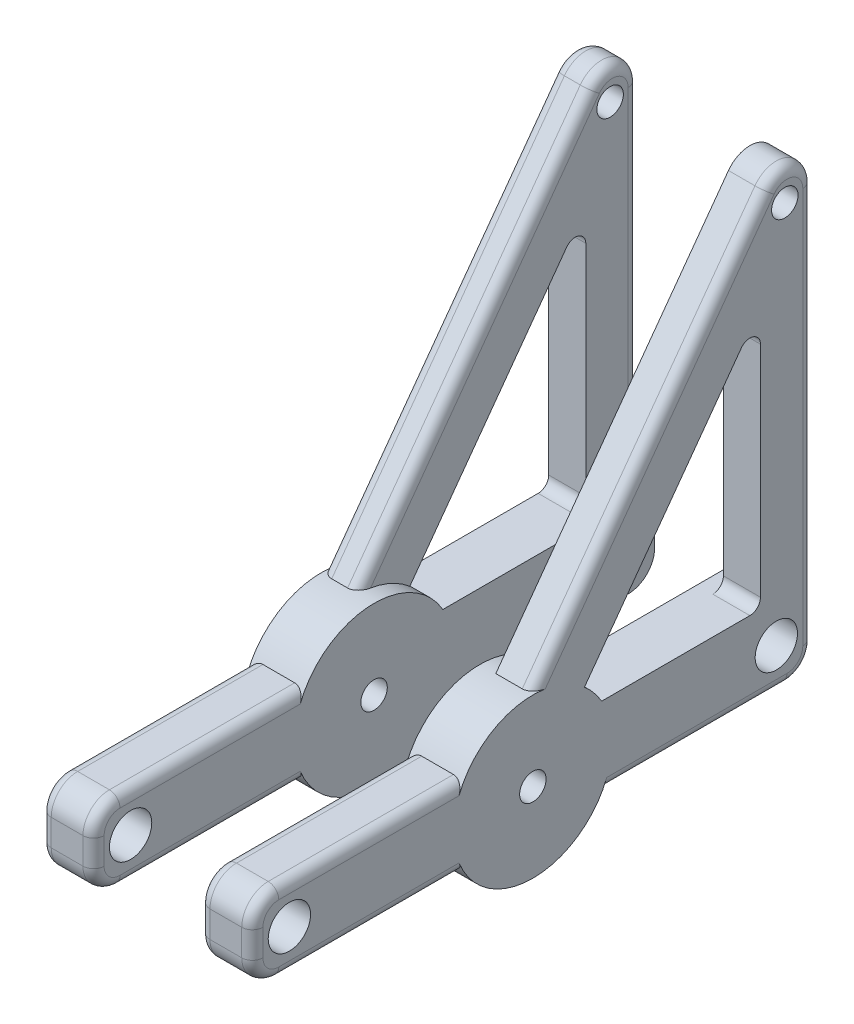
ISO-10303-21;
HEADER;
FILE_DESCRIPTION(('STEP AP214'),'2;1');
FILE_NAME('part.step','',(''),(''),'','','');
FILE_SCHEMA(('AUTOMOTIVE_DESIGN { 1 0 10303 214 1 1 1 1 }'));
ENDSEC;
DATA;
#1=APPLICATION_CONTEXT('core data for automotive mechanical design processes');
#2=APPLICATION_PROTOCOL_DEFINITION('international standard','automotive_design',2000,#1);
#3=PRODUCT_CONTEXT('',#1,'mechanical');
#4=PRODUCT('Part','Part','',(#3));
#5=PRODUCT_RELATED_PRODUCT_CATEGORY('part','',(#4));
#6=PRODUCT_DEFINITION_FORMATION('','',#4);
#7=PRODUCT_DEFINITION_CONTEXT('part definition',#1,'design');
#8=PRODUCT_DEFINITION('design','',#6,#7);
#9=PRODUCT_DEFINITION_SHAPE('','',#8);
#10=(LENGTH_UNIT() NAMED_UNIT(*) SI_UNIT(.MILLI.,.METRE.));
#11=(NAMED_UNIT(*) PLANE_ANGLE_UNIT() SI_UNIT($,.RADIAN.));
#12=(NAMED_UNIT(*) SI_UNIT($,.STERADIAN.) SOLID_ANGLE_UNIT());
#13=UNCERTAINTY_MEASURE_WITH_UNIT(LENGTH_MEASURE(1.E-05),#10,'distance_accuracy_value','');
#14=(GEOMETRIC_REPRESENTATION_CONTEXT(3) GLOBAL_UNCERTAINTY_ASSIGNED_CONTEXT((#13)) GLOBAL_UNIT_ASSIGNED_CONTEXT((#10,
#11,#12)) REPRESENTATION_CONTEXT('',''));
#15=CARTESIAN_POINT('',(0.,0.,0.));
#16=DIRECTION('',(0.,0.,1.));
#17=DIRECTION('',(1.,0.,0.));
#18=AXIS2_PLACEMENT_3D('',#15,#16,#17);
#19=CARTESIAN_POINT('',(38.1,0.,0.));
#20=DIRECTION('',(1.,0.,0.));
#21=DIRECTION('',(0.,0.,1.));
#22=AXIS2_PLACEMENT_3D('',#19,#20,#21);
#23=CYLINDRICAL_SURFACE('',#22,19.05);
#24=DIRECTION('',(1.,0.,0.));
#25=VECTOR('',#24,1.);
#26=CARTESIAN_POINT('',(41.91,19.05,0.));
#27=LINE('',#26,#25);
#28=CARTESIAN_POINT('',(41.91,19.05,0.));
#29=VERTEX_POINT('',#28);
#30=CARTESIAN_POINT('',(48.26,19.05,0.));
#31=VERTEX_POINT('',#30);
#32=EDGE_CURVE('E664',#29,#31,#27,.T.);
#33=ORIENTED_EDGE('',*,*,#32,.F.);
#34=CARTESIAN_POINT('',(41.91,0.,0.));
#35=DIRECTION('',(1.,0.,0.));
#36=DIRECTION('',(0.,0.,-1.));
#37=AXIS2_PLACEMENT_3D('',#34,#35,#36);
#38=CIRCLE('',#37,19.05);
#39=CARTESIAN_POINT('',(41.91,14.477299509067,-12.3818536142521));
#40=VERTEX_POINT('',#39);
#41=EDGE_CURVE('E284',#40,#29,#38,.T.);
#42=ORIENTED_EDGE('',*,*,#41,.F.);
#43=DIRECTION('',(1.,0.,0.));
#44=VECTOR('',#43,1.);
#45=CARTESIAN_POINT('',(41.91,14.4772995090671,-12.3818536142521));
#46=LINE('',#45,#44);
#47=CARTESIAN_POINT('',(50.8,14.477299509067,-12.3818536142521));
#48=VERTEX_POINT('',#47);
#49=EDGE_CURVE('E650',#40,#48,#46,.T.);
#50=ORIENTED_EDGE('',*,*,#49,.T.);
#51=CARTESIAN_POINT('',(50.8,0.,0.));
#52=DIRECTION('',(1.,0.,0.));
#53=DIRECTION('',(0.,0.,-1.));
#54=AXIS2_PLACEMENT_3D('',#51,#52,#53);
#55=CIRCLE('',#54,19.05);
#56=CARTESIAN_POINT('',(50.8,9.50380976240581,-16.51));
#57=VERTEX_POINT('',#56);
#58=EDGE_CURVE('E312',#57,#48,#55,.T.);
#59=ORIENTED_EDGE('',*,*,#58,.F.);
#60=DIRECTION('',(1.,0.,0.));
#61=VECTOR('',#60,1.);
#62=CARTESIAN_POINT('',(38.1,9.50380976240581,-16.51));
#63=LINE('',#62,#61);
#64=CARTESIAN_POINT('',(38.1,9.50380976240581,-16.51));
#65=VERTEX_POINT('',#64);
#66=EDGE_CURVE('E288',#57,#65,#63,.F.);
#67=ORIENTED_EDGE('',*,*,#66,.T.);
#68=CARTESIAN_POINT('',(38.1,0.,0.));
#69=DIRECTION('',(1.,0.,0.));
#70=DIRECTION('',(0.,0.,-1.));
#71=AXIS2_PLACEMENT_3D('',#68,#69,#70);
#72=CIRCLE('',#71,19.05);
#73=CARTESIAN_POINT('',(38.1,6.96821630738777,17.7298184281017));
#74=VERTEX_POINT('',#73);
#75=EDGE_CURVE('E309',#65,#74,#72,.T.);
#76=ORIENTED_EDGE('',*,*,#75,.T.);
#77=CARTESIAN_POINT('',(38.1,6.96821630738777,17.7298184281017));
#78=CARTESIAN_POINT('',(38.1000032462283,7.04595596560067,17.6992683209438));
#79=CARTESIAN_POINT('',(38.1035701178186,7.1234482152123,17.6682178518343));
#80=CARTESIAN_POINT('',(38.1177081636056,7.27745675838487,17.6053407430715));
#81=CARTESIAN_POINT('',(38.1282779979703,7.35397323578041,17.5735142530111));
#82=CARTESIAN_POINT('',(38.1702853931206,7.58125079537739,17.4772452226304));
#83=CARTESIAN_POINT('',(38.2120212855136,7.72987632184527,17.4119594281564));
#84=CARTESIAN_POINT('',(38.3215888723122,8.01713174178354,17.2815808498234));
#85=CARTESIAN_POINT('',(38.3894154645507,8.15576358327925,17.2164880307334));
#86=CARTESIAN_POINT('',(38.5497056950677,8.4194511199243,17.0890837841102));
#87=CARTESIAN_POINT('',(38.6421707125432,8.54450605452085,17.026772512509));
#88=CARTESIAN_POINT('',(38.8496706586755,8.77663561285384,16.9082838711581));
#89=CARTESIAN_POINT('',(38.9645874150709,8.88379915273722,16.8520766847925));
#90=CARTESIAN_POINT('',(39.1521628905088,9.02836258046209,16.7748081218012));
#91=CARTESIAN_POINT('',(39.2172689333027,9.07387783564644,16.750211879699));
#92=CARTESIAN_POINT('',(39.3521688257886,9.15897798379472,16.7038307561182));
#93=CARTESIAN_POINT('',(39.4219596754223,9.19856662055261,16.6820441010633));
#94=CARTESIAN_POINT('',(39.5590921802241,9.26790926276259,16.6436109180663));
#95=CARTESIAN_POINT('',(39.6260652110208,9.29823376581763,16.626675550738));
#96=CARTESIAN_POINT('',(39.7629643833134,9.35313585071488,16.5958531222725));
#97=CARTESIAN_POINT('',(39.8328886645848,9.37771699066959,16.5819641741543));
#98=CARTESIAN_POINT('',(39.9749666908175,9.42073065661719,16.5575645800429));
#99=CARTESIAN_POINT('',(40.0471139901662,9.43917941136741,16.5470450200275));
#100=CARTESIAN_POINT('',(40.1931276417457,9.46970758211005,16.5295931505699));
#101=CARTESIAN_POINT('',(40.2669924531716,9.48179249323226,16.5226577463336));
#102=CARTESIAN_POINT('',(40.3661099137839,9.493529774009,16.5159136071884));
#103=CARTESIAN_POINT('',(40.3909344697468,9.49609888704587,16.5144364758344));
#104=CARTESIAN_POINT('',(40.4406444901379,9.50050354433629,16.5119029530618));
#105=CARTESIAN_POINT('',(40.4655298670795,9.50233983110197,16.5108461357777));
#106=CARTESIAN_POINT('',(40.4904478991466,9.50380976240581,16.51));
#107=B_SPLINE_CURVE_WITH_KNOTS('',3,(#77,#78,#79,#80,#81,#82,#83,#84,#85,#86,#87,#88,#89,#90,
#91,#92,#93,#94,#95,#96,#97,#98,#99,#100,#101,#102,#103,#104,#105,#106),.UNSPECIFIED.,.F.,.F.,
(4,2,2,2,2,2,2,2,2,2,2,2,2,2,4),(0.,0.250413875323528,0.500779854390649,1.00107790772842,
1.5012781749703,2.00150644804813,2.49916950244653,2.74832666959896,2.99732577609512,
3.22333948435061,3.44921279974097,3.67448351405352,3.89955938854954,3.97455130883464,
4.04946705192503),.UNSPECIFIED.);
#108=CARTESIAN_POINT('',(40.4904478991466,9.50380976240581,16.51));
#109=VERTEX_POINT('',#108);
#110=EDGE_CURVE('E485',#74,#109,#107,.T.);
#111=ORIENTED_EDGE('',*,*,#110,.T.);
#112=DIRECTION('',(1.,0.,0.));
#113=VECTOR('',#112,1.);
#114=CARTESIAN_POINT('',(38.1,9.50380976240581,16.51));
#115=LINE('',#114,#113);
#116=CARTESIAN_POINT('',(48.4095521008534,9.50380976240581,16.51));
#117=VERTEX_POINT('',#116);
#118=EDGE_CURVE('E315',#109,#117,#115,.T.);
#119=ORIENTED_EDGE('',*,*,#118,.T.);
#120=CARTESIAN_POINT('',(48.4095521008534,9.50380976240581,16.51));
#121=CARTESIAN_POINT('',(48.4756636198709,9.49992178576,16.51223497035));
#122=CARTESIAN_POINT('',(48.5415595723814,9.49342962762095,16.5159733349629));
#123=CARTESIAN_POINT('',(48.6723916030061,9.47538132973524,16.5263360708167));
#124=CARTESIAN_POINT('',(48.7373281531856,9.46382777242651,16.5329589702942));
#125=CARTESIAN_POINT('',(48.8654604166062,9.43586677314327,16.5489325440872));
#126=CARTESIAN_POINT('',(48.9286632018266,9.41948384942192,16.5582694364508));
#127=CARTESIAN_POINT('',(49.0532192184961,9.38205922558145,16.5795032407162));
#128=CARTESIAN_POINT('',(49.1145722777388,9.36101709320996,16.5914003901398));
#129=CARTESIAN_POINT('',(49.2950496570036,9.29132759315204,16.6305916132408));
#130=CARTESIAN_POINT('',(49.4109277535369,9.23604249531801,16.661428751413));
#131=CARTESIAN_POINT('',(49.6314199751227,9.10994361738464,16.7307079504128));
#132=CARTESIAN_POINT('',(49.7360208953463,9.03911192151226,16.7691587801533));
#133=CARTESIAN_POINT('',(49.9393274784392,8.87855864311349,16.8547481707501));
#134=CARTESIAN_POINT('',(50.0370702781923,8.78784577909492,16.9023123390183));
#135=CARTESIAN_POINT('',(50.2162671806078,8.59366904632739,17.0018605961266));
#136=CARTESIAN_POINT('',(50.2977138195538,8.4901993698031,17.0538466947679));
#137=CARTESIAN_POINT('',(50.4519643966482,8.25985473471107,17.1667010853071));
#138=CARTESIAN_POINT('',(50.5225690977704,8.13166057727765,17.2278880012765));
#139=CARTESIAN_POINT('',(50.6407088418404,7.86544425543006,17.3510454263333));
#140=CARTESIAN_POINT('',(50.6882513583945,7.72742529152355,17.4130156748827));
#141=CARTESIAN_POINT('',(50.7489114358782,7.48559086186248,17.5180035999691));
#142=CARTESIAN_POINT('',(50.7680001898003,7.38337374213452,17.5613391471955));
#143=CARTESIAN_POINT('',(50.7935386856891,7.17698658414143,17.6466983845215));
#144=CARTESIAN_POINT('',(50.8000037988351,7.07281907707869,17.6887236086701));
#145=CARTESIAN_POINT('',(50.8,6.96821630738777,17.7298184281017));
#146=B_SPLINE_CURVE_WITH_KNOTS('',3,(#120,#121,#122,#123,#124,#125,#126,#127,#128,#129,#130,
#131,#132,#133,#134,#135,#136,#137,#138,#139,#140,#141,#142,#143,#144,#145),.UNSPECIFIED.,.F.,
.F.,(4,2,2,2,2,2,2,2,2,2,2,2,4),(0.,0.198705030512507,0.397308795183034,0.59492114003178,
0.792551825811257,1.18678683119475,1.5814785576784,2.00451558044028,2.42774591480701,
2.90160278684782,3.37530599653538,3.71257108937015,4.04942525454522),.UNSPECIFIED.);
#147=CARTESIAN_POINT('',(50.8,6.96821630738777,17.7298184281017));
#148=VERTEX_POINT('',#147);
#149=EDGE_CURVE('E478',#117,#148,#146,.T.);
#150=ORIENTED_EDGE('',*,*,#149,.T.);
#151=CARTESIAN_POINT('',(50.8,18.8166309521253,-2.97269231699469));
#152=VERTEX_POINT('',#151);
#153=EDGE_CURVE('E302',#152,#148,#55,.T.);
#154=ORIENTED_EDGE('',*,*,#153,.F.);
#155=CARTESIAN_POINT('',(50.8,18.8166309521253,-2.97269231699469));
#156=CARTESIAN_POINT('',(50.7999934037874,18.8309161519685,-2.8822924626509));
#157=CARTESIAN_POINT('',(50.7960789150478,18.844533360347,-2.79184319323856));
#158=CARTESIAN_POINT('',(50.7805973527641,18.8703809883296,-2.61141838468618));
#159=CARTESIAN_POINT('',(50.7690317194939,18.8826116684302,-2.52144275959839));
#160=CARTESIAN_POINT('',(50.7230708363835,18.9171777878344,-2.25285998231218));
#161=CARTESIAN_POINT('',(50.6774122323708,18.9373593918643,-2.07577453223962));
#162=CARTESIAN_POINT('',(50.5575323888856,18.9719760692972,-1.73109883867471));
#163=CARTESIAN_POINT('',(50.4833165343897,18.9864122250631,-1.5635068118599));
#164=CARTESIAN_POINT('',(50.3074536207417,19.0100826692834,-1.24298136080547));
#165=CARTESIAN_POINT('',(50.2058310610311,19.0193215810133,-1.09003500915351));
#166=CARTESIAN_POINT('',(49.9973157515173,19.0322235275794,-0.831048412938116));
#167=CARTESIAN_POINT('',(49.8947655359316,19.0365962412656,-0.721541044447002));
#168=CARTESIAN_POINT('',(49.6731077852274,19.043147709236,-0.520675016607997));
#169=CARTESIAN_POINT('',(49.554018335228,19.0453288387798,-0.429296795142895));
#170=CARTESIAN_POINT('',(49.3210279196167,19.0480321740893,-0.282034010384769));
#171=CARTESIAN_POINT('',(49.2092274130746,19.048760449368,-0.222833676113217));
#172=CARTESIAN_POINT('',(48.9773903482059,19.0496617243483,-0.123905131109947));
#173=CARTESIAN_POINT('',(48.8573694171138,19.0498357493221,-0.0841410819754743));
#174=CARTESIAN_POINT('',(48.6571325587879,19.0499727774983,-0.0370851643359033));
#175=CARTESIAN_POINT('',(48.5784132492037,19.0499896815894,-0.0232359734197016));
#176=CARTESIAN_POINT('',(48.419816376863,19.0500000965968,-0.00467032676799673));
#177=CARTESIAN_POINT('',(48.3399375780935,19.0499935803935,3.55317256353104E-05));
#178=CARTESIAN_POINT('',(48.26,19.05,0.));
#179=B_SPLINE_CURVE_WITH_KNOTS('',3,(#155,#156,#157,#158,#159,#160,#161,#162,#163,#164,#165,
#166,#167,#168,#169,#170,#171,#172,#173,#174,#175,#176,#177,#178),.UNSPECIFIED.,.F.,.F.,(4,2,2,
2,2,2,2,2,2,2,2,4),(0.,0.274375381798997,0.548699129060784,1.097879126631,1.64695561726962,
2.19554289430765,2.644064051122,3.09209857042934,3.47007592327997,3.84735367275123,
4.08664420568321,4.32621191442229),.UNSPECIFIED.);
#180=EDGE_CURVE('E12',#152,#31,#179,.T.);
#181=ORIENTED_EDGE('',*,*,#180,.T.);
#182=EDGE_LOOP('',(#33,#42,#50,#59,#67,#76,#111,#119,#150,#154,#181));
#183=FACE_BOUND('',#182,.T.);
#184=ADVANCED_FACE('F45',(#183),#23,.T.);
#185=CARTESIAN_POINT('',(50.8,9.50821630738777,-67.31));
#186=DIRECTION('',(0.,1.,0.));
#187=DIRECTION('',(0.,0.,1.));
#188=AXIS2_PLACEMENT_3D('',#185,#186,#187);
#189=PLANE('',#188);
#190=DIRECTION('',(0.,0.,1.));
#191=VECTOR('',#190,1.);
#192=CARTESIAN_POINT('',(50.8,9.50821630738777,-67.31));
#193=LINE('',#192,#191);
#194=CARTESIAN_POINT('',(50.8,9.50821630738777,-52.07));
#195=VERTEX_POINT('',#194);
#196=CARTESIAN_POINT('',(50.8,9.50821630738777,-16.51));
#197=VERTEX_POINT('',#196);
#198=EDGE_CURVE('E271',#195,#197,#193,.T.);
#199=ORIENTED_EDGE('',*,*,#198,.F.);
#200=DIRECTION('',(1.,0.,0.));
#201=VECTOR('',#200,1.);
#202=CARTESIAN_POINT('',(50.8,9.50821630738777,-52.07));
#203=LINE('',#202,#201);
#204=CARTESIAN_POINT('',(41.91,9.50821630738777,-52.07));
#205=VERTEX_POINT('',#204);
#206=EDGE_CURVE('E426',#195,#205,#203,.F.);
#207=ORIENTED_EDGE('',*,*,#206,.T.);
#208=DIRECTION('',(0.,0.,-1.));
#209=VECTOR('',#208,1.);
#210=CARTESIAN_POINT('',(41.91,9.50821630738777,-54.61));
#211=LINE('',#210,#209);
#212=CARTESIAN_POINT('',(41.91,9.50821630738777,-67.31));
#213=VERTEX_POINT('',#212);
#214=EDGE_CURVE('E68',#205,#213,#211,.T.);
#215=ORIENTED_EDGE('',*,*,#214,.T.);
#216=DIRECTION('',(1.,0.,0.));
#217=VECTOR('',#216,1.);
#218=CARTESIAN_POINT('',(50.8,9.50821630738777,-67.31));
#219=LINE('',#218,#217);
#220=CARTESIAN_POINT('',(38.1,9.50821630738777,-67.31));
#221=VERTEX_POINT('',#220);
#222=EDGE_CURVE('E255',#221,#213,#219,.T.);
#223=ORIENTED_EDGE('',*,*,#222,.F.);
#224=DIRECTION('',(0.,0.,1.));
#225=VECTOR('',#224,1.);
#226=CARTESIAN_POINT('',(38.1,9.50821630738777,-67.31));
#227=LINE('',#226,#225);
#228=CARTESIAN_POINT('',(38.1,9.50821630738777,-16.51));
#229=VERTEX_POINT('',#228);
#230=EDGE_CURVE('E263',#221,#229,#227,.T.);
#231=ORIENTED_EDGE('',*,*,#230,.T.);
#232=DIRECTION('',(1.,0.,0.));
#233=VECTOR('',#232,1.);
#234=CARTESIAN_POINT('',(50.8,9.50821630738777,-16.51));
#235=LINE('',#234,#233);
#236=EDGE_CURVE('E260',#229,#197,#235,.T.);
#237=ORIENTED_EDGE('',*,*,#236,.T.);
#238=EDGE_LOOP('',(#199,#207,#215,#223,#231,#237));
#239=FACE_BOUND('',#238,.T.);
#240=ADVANCED_FACE('F275',(#239),#189,.T.);
#241=DIRECTION('',(-1.,0.,0.));
#242=VECTOR('',#241,1.);
#243=CARTESIAN_POINT('',(38.1,-9.50380976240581,-16.51));
#244=LINE('',#243,#242);
#245=CARTESIAN_POINT('',(48.26,-9.50380976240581,-16.51));
#246=VERTEX_POINT('',#245);
#247=CARTESIAN_POINT('',(38.1,-9.50380976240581,-16.51));
#248=VERTEX_POINT('',#247);
#249=EDGE_CURVE('E283',#246,#248,#244,.T.);
#250=ORIENTED_EDGE('',*,*,#249,.F.);
#251=CARTESIAN_POINT('',(48.26,-9.50380976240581,-16.51));
#252=CARTESIAN_POINT('',(48.3251913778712,-9.50382105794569,-16.5099903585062));
#253=CARTESIAN_POINT('',(48.3903753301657,-9.50130028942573,-16.511444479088));
#254=CARTESIAN_POINT('',(48.5202069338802,-9.49128177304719,-16.5172071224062));
#255=CARTESIAN_POINT('',(48.584854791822,-9.48378604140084,-16.5215144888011));
#256=CARTESIAN_POINT('',(48.7128433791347,-9.46395157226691,-16.53288369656));
#257=CARTESIAN_POINT('',(48.7761888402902,-9.45163587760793,-16.5399324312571));
#258=CARTESIAN_POINT('',(48.9014220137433,-9.42232948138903,-16.5566449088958));
#259=CARTESIAN_POINT('',(48.9633096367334,-9.40533849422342,-16.566308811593));
#260=CARTESIAN_POINT('',(49.1460030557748,-9.3476830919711,-16.5989544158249));
#261=CARTESIAN_POINT('',(49.2641144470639,-9.30029264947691,-16.6256154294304));
#262=CARTESIAN_POINT('',(49.4902929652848,-9.18954383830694,-16.6870840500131));
#263=CARTESIAN_POINT('',(49.5983496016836,-9.12616904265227,-16.7219000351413));
#264=CARTESIAN_POINT('',(49.808813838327,-8.98125236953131,-16.8002018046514));
#265=CARTESIAN_POINT('',(49.9104677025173,-8.89883421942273,-16.8440885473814));
#266=CARTESIAN_POINT('',(50.0988131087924,-8.72084698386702,-16.9369243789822));
#267=CARTESIAN_POINT('',(50.1854988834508,-8.62527285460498,-16.9858754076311));
#268=CARTESIAN_POINT('',(50.3525113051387,-8.41076111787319,-17.0932051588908));
#269=CARTESIAN_POINT('',(50.430739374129,-8.2903957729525,-17.1520024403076));
#270=CARTESIAN_POINT('',(50.5656633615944,-8.03893534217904,-17.2712882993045));
#271=CARTESIAN_POINT('',(50.6223544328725,-7.90783784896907,-17.3317772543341));
#272=CARTESIAN_POINT('',(50.7112534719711,-7.64323892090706,-17.4500290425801));
#273=CARTESIAN_POINT('',(50.7443514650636,-7.51004430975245,-17.5078039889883));
#274=CARTESIAN_POINT('',(50.7776301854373,-7.30710100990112,-17.5930153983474));
#275=CARTESIAN_POINT('',(50.7859950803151,-7.23891483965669,-17.6211825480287));
#276=CARTESIAN_POINT('',(50.7971794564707,-7.10181920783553,-17.67688180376));
#277=CARTESIAN_POINT('',(50.7999979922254,-7.03290962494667,-17.7044138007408));
#278=CARTESIAN_POINT('',(50.8,-6.96380976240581,-17.7315496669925));
#279=B_SPLINE_CURVE_WITH_KNOTS('',3,(#251,#252,#253,#254,#255,#256,#257,#258,#259,#260,#261,
#262,#263,#264,#265,#266,#267,#268,#269,#270,#271,#272,#273,#274,#275,#276,#277,#278),
.UNSPECIFIED.,.F.,.F.,(4,2,2,2,2,2,2,2,2,2,2,2,2,4),(0.,0.195496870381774,0.390914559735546,
0.585409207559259,0.779915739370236,1.16810057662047,1.55668598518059,1.96912059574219,
2.38171377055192,2.84512943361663,3.30864933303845,3.75359573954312,3.9761530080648,
4.1987482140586),.UNSPECIFIED.);
#280=CARTESIAN_POINT('',(50.8,-6.96380976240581,-17.7315496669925));
#281=VERTEX_POINT('',#280);
#282=EDGE_CURVE('E486',#246,#281,#279,.T.);
#283=ORIENTED_EDGE('',*,*,#282,.T.);
#284=CARTESIAN_POINT('',(50.8,-7.00178369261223,17.716588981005));
#285=VERTEX_POINT('',#284);
#286=EDGE_CURVE('E310',#285,#281,#55,.T.);
#287=ORIENTED_EDGE('',*,*,#286,.F.);
#288=CARTESIAN_POINT('',(50.8,-7.00178369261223,17.716588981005));
#289=CARTESIAN_POINT('',(50.7999964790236,-7.07958600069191,17.6858439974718));
#290=CARTESIAN_POINT('',(50.7964240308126,-7.15713899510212,17.6545976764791));
#291=CARTESIAN_POINT('',(50.7822641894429,-7.31126544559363,17.5913279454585));
#292=CARTESIAN_POINT('',(50.7716781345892,-7.38783908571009,17.5593046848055));
#293=CARTESIAN_POINT('',(50.7296060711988,-7.61528304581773,17.4624457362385));
#294=CARTESIAN_POINT('',(50.687805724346,-7.76401270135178,17.3967668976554));
#295=CARTESIAN_POINT('',(50.5780890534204,-8.05142739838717,17.2656313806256));
#296=CARTESIAN_POINT('',(50.5101828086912,-8.1901162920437,17.200174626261));
#297=CARTESIAN_POINT('',(50.3496369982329,-8.45397453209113,17.0720333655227));
#298=CARTESIAN_POINT('',(50.2569863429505,-8.57913778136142,17.009350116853));
#299=CARTESIAN_POINT('',(50.0490968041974,-8.81145998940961,16.8901647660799));
#300=CARTESIAN_POINT('',(49.933960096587,-8.91869646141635,16.8336364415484));
#301=CARTESIAN_POINT('',(49.683323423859,-9.11143709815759,16.7300982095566));
#302=CARTESIAN_POINT('',(49.5478735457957,-9.1969933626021,16.6830655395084));
#303=CARTESIAN_POINT('',(49.2946046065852,-9.32475781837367,16.6119057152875));
#304=CARTESIAN_POINT('',(49.1803309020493,-9.37244026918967,16.5849905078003));
#305=CARTESIAN_POINT('',(49.0032509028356,-9.43140895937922,16.5514813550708));
#306=CARTESIAN_POINT('',(48.9431383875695,-9.44899788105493,16.5414408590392));
#307=CARTESIAN_POINT('',(48.8213958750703,-9.47976335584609,16.5238278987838));
#308=CARTESIAN_POINT('',(48.7597648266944,-9.49293675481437,16.5162571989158));
#309=CARTESIAN_POINT('',(48.6975677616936,-9.50380976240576,16.51));
#310=B_SPLINE_CURVE_WITH_KNOTS('',3,(#288,#289,#290,#291,#292,#293,#294,#295,#296,#297,#298,
#299,#300,#301,#302,#303,#304,#305,#306,#307,#308,#309),.UNSPECIFIED.,.F.,.F.,(4,2,2,2,2,2,2,2,
2,2,4),(0.,0.250802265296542,0.501556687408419,1.00263136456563,1.50351277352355,
2.00461903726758,2.50349915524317,3.00116879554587,3.37966237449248,3.56976202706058,
3.75999718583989),.UNSPECIFIED.);
#311=CARTESIAN_POINT('',(48.6975677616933,-9.50380976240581,16.51));
#312=VERTEX_POINT('',#311);
#313=EDGE_CURVE('E430',#285,#312,#310,.T.);
#314=ORIENTED_EDGE('',*,*,#313,.T.);
#315=DIRECTION('',(1.,0.,0.));
#316=VECTOR('',#315,1.);
#317=CARTESIAN_POINT('',(38.1,-9.50380976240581,16.51));
#318=LINE('',#317,#316);
#319=CARTESIAN_POINT('',(40.2024322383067,-9.50380976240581,16.51));
#320=VERTEX_POINT('',#319);
#321=EDGE_CURVE('E308',#312,#320,#318,.F.);
#322=ORIENTED_EDGE('',*,*,#321,.T.);
#323=CARTESIAN_POINT('',(40.2024322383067,-9.50380976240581,16.51));
#324=CARTESIAN_POINT('',(40.1350341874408,-9.49203366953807,16.5167760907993));
#325=CARTESIAN_POINT('',(40.0682849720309,-9.47754342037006,16.5251031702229));
#326=CARTESIAN_POINT('',(39.936602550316,-9.44338994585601,16.5446455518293));
#327=CARTESIAN_POINT('',(39.8716681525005,-9.42373020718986,16.5558589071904));
#328=CARTESIAN_POINT('',(39.7443708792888,-9.37959071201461,16.5809050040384));
#329=CARTESIAN_POINT('',(39.681996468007,-9.35513633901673,16.5947239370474));
#330=CARTESIAN_POINT('',(39.5598591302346,-9.30164148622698,16.6247679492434));
#331=CARTESIAN_POINT('',(39.500096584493,-9.27260034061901,16.6409933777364));
#332=CARTESIAN_POINT('',(39.3255376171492,-9.17920012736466,16.6928078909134));
#333=CARTESIAN_POINT('',(39.2150455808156,-9.10841486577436,16.7316211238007));
#334=CARTESIAN_POINT('',(39.0076969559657,-8.95219293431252,16.8157252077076));
#335=CARTESIAN_POINT('',(38.9108578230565,-8.86673781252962,16.8610242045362));
#336=CARTESIAN_POINT('',(38.7243726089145,-8.67549850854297,16.96027119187));
#337=CARTESIAN_POINT('',(38.6360970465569,-8.56858986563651,17.0146291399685));
#338=CARTESIAN_POINT('',(38.4785604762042,-8.34295311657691,17.1263977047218));
#339=CARTESIAN_POINT('',(38.409312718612,-8.22421685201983,17.1838104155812));
#340=CARTESIAN_POINT('',(38.2847980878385,-7.96480736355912,17.3056907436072));
#341=CARTESIAN_POINT('',(38.2317205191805,-7.82313564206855,17.3702734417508));
#342=CARTESIAN_POINT('',(38.1514695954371,-7.53233897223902,17.4983284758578));
#343=CARTESIAN_POINT('',(38.1242509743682,-7.38322753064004,17.5618025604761));
#344=CARTESIAN_POINT('',(38.1070040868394,-7.19417977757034,17.6393881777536));
#345=CARTESIAN_POINT('',(38.1043794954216,-7.15578442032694,17.6549987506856));
#346=CARTESIAN_POINT('',(38.1008794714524,-7.0788748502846,17.685975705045));
#347=CARTESIAN_POINT('',(38.1000017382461,-7.04036086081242,17.7013423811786));
#348=CARTESIAN_POINT('',(38.1,-7.00178369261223,17.716588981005));
#349=B_SPLINE_CURVE_WITH_KNOTS('',3,(#323,#324,#325,#326,#327,#328,#329,#330,#331,#332,#333,
#334,#335,#336,#337,#338,#339,#340,#341,#342,#343,#344,#345,#346,#347,#348),.UNSPECIFIED.,.F.,
.F.,(4,2,2,2,2,2,2,2,2,2,2,2,4),(0.,0.206160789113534,0.412182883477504,0.617142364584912,
0.822131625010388,1.23075320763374,1.63989257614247,2.08482659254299,2.53006966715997,
3.02140300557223,3.51187467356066,3.63644279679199,3.76084675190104),.UNSPECIFIED.);
#350=CARTESIAN_POINT('',(38.1,-7.00178369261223,17.7165889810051));
#351=VERTEX_POINT('',#350);
#352=EDGE_CURVE('E438',#320,#351,#349,.T.);
#353=ORIENTED_EDGE('',*,*,#352,.T.);
#354=EDGE_CURVE('E305',#351,#248,#72,.T.);
#355=ORIENTED_EDGE('',*,*,#354,.T.);
#356=EDGE_LOOP('',(#250,#283,#287,#314,#322,#353,#355));
#357=FACE_BOUND('',#356,.T.);
#358=ADVANCED_FACE('F445',(#357),#23,.T.);
#359=CARTESIAN_POINT('',(38.1,0.,0.));
#360=DIRECTION('',(-1.,0.,0.));
#361=DIRECTION('',(0.,0.,-1.));
#362=AXIS2_PLACEMENT_3D('',#359,#360,#361);
#363=PLANE('',#362);
#364=CARTESIAN_POINT('',(38.1,0.110216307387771,58.42));
#365=DIRECTION('',(-1.,0.,0.));
#366=DIRECTION('',(0.,0.,1.));
#367=AXIS2_PLACEMENT_3D('',#364,#365,#366);
#368=CIRCLE('',#367,5.08);
#369=CARTESIAN_POINT('',(38.1,0.110216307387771,63.5));
#370=VERTEX_POINT('',#369);
#371=EDGE_CURVE('E661',#370,#370,#368,.T.);
#372=ORIENTED_EDGE('',*,*,#371,.F.);
#373=EDGE_LOOP('',(#372));
#374=FACE_BOUND('',#373,.T.);
#375=CARTESIAN_POINT('',(38.1,0.110216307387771,-58.42));
#376=DIRECTION('',(-1.,0.,0.));
#377=DIRECTION('',(0.,0.,1.));
#378=AXIS2_PLACEMENT_3D('',#375,#376,#377);
#379=CIRCLE('',#378,5.08);
#380=CARTESIAN_POINT('',(38.1,0.110216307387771,-53.34));
#381=VERTEX_POINT('',#380);
#382=EDGE_CURVE('E677',#381,#381,#379,.T.);
#383=ORIENTED_EDGE('',*,*,#382,.F.);
#384=EDGE_LOOP('',(#383));
#385=FACE_BOUND('',#384,.T.);
#386=ORIENTED_EDGE('',*,*,#354,.F.);
#387=DIRECTION('',(0.,0.,-1.));
#388=VECTOR('',#387,1.);
#389=CARTESIAN_POINT('',(38.1,-7.00178369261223,60.96));
#390=LINE('',#389,#388);
#391=CARTESIAN_POINT('',(38.1,-7.00178369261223,60.96));
#392=VERTEX_POINT('',#391);
#393=EDGE_CURVE('E399',#351,#392,#390,.F.);
#394=ORIENTED_EDGE('',*,*,#393,.T.);
#395=CARTESIAN_POINT('',(38.1,-3.19178369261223,60.96));
#396=DIRECTION('',(-1.,0.,0.));
#397=DIRECTION('',(0.,0.,1.));
#398=AXIS2_PLACEMENT_3D('',#395,#396,#397);
#399=CIRCLE('',#398,3.81);
#400=CARTESIAN_POINT('',(38.1,-3.19178369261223,64.77));
#401=VERTEX_POINT('',#400);
#402=EDGE_CURVE('E397',#392,#401,#399,.T.);
#403=ORIENTED_EDGE('',*,*,#402,.T.);
#404=DIRECTION('',(0.,1.,0.));
#405=VECTOR('',#404,1.);
#406=CARTESIAN_POINT('',(38.1,0.,64.77));
#407=LINE('',#406,#405);
#408=CARTESIAN_POINT('',(38.1,3.15821630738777,64.77));
#409=VERTEX_POINT('',#408);
#410=EDGE_CURVE('E395',#401,#409,#407,.T.);
#411=ORIENTED_EDGE('',*,*,#410,.T.);
#412=CARTESIAN_POINT('',(38.1,3.15821630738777,60.96));
#413=DIRECTION('',(-1.,0.,0.));
#414=DIRECTION('',(0.,0.,1.));
#415=AXIS2_PLACEMENT_3D('',#412,#413,#414);
#416=CIRCLE('',#415,3.81);
#417=CARTESIAN_POINT('',(38.1,6.96821630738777,60.96));
#418=VERTEX_POINT('',#417);
#419=EDGE_CURVE('E393',#409,#418,#416,.T.);
#420=ORIENTED_EDGE('',*,*,#419,.T.);
#421=DIRECTION('',(0.,0.,-1.));
#422=VECTOR('',#421,1.);
#423=CARTESIAN_POINT('',(38.1,6.96821630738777,16.51));
#424=LINE('',#423,#422);
#425=EDGE_CURVE('E390',#418,#74,#424,.T.);
#426=ORIENTED_EDGE('',*,*,#425,.T.);
#427=ORIENTED_EDGE('',*,*,#75,.F.);
#428=DIRECTION('',(0.,1.,0.));
#429=VECTOR('',#428,1.);
#430=CARTESIAN_POINT('',(38.1,9.50821630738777,-16.51));
#431=LINE('',#430,#429);
#432=EDGE_CURVE('E267',#65,#229,#431,.T.);
#433=ORIENTED_EDGE('',*,*,#432,.T.);
#434=ORIENTED_EDGE('',*,*,#230,.F.);
#435=DIRECTION('',(0.,1.,0.));
#436=VECTOR('',#435,1.);
#437=CARTESIAN_POINT('',(38.1,9.50821630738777,-67.31));
#438=LINE('',#437,#436);
#439=CARTESIAN_POINT('',(38.1,-3.15380976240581,-67.31));
#440=VERTEX_POINT('',#439);
#441=EDGE_CURVE('E249',#440,#221,#438,.T.);
#442=ORIENTED_EDGE('',*,*,#441,.F.);
#443=CARTESIAN_POINT('',(38.1,-3.15380976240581,-60.96));
#444=DIRECTION('',(-1.,0.,0.));
#445=DIRECTION('',(0.,0.,1.));
#446=AXIS2_PLACEMENT_3D('',#443,#444,#445);
#447=CIRCLE('',#446,6.35);
#448=CARTESIAN_POINT('',(38.1,-9.50380976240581,-60.96));
#449=VERTEX_POINT('',#448);
#450=EDGE_CURVE('E332',#440,#449,#447,.T.);
#451=ORIENTED_EDGE('',*,*,#450,.T.);
#452=DIRECTION('',(0.,0.,1.));
#453=VECTOR('',#452,1.);
#454=CARTESIAN_POINT('',(38.1,-9.50380976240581,-67.31));
#455=LINE('',#454,#453);
#456=EDGE_CURVE('E272',#449,#248,#455,.T.);
#457=ORIENTED_EDGE('',*,*,#456,.T.);
#458=EDGE_LOOP('',(#386,#394,#403,#411,#420,#426,#427,#433,#434,#442,#451,#457));
#459=FACE_BOUND('',#458,.T.);
#460=CARTESIAN_POINT('',(38.1,0.,0.));
#461=DIRECTION('',(1.,0.,0.));
#462=DIRECTION('',(0.,0.,-1.));
#463=AXIS2_PLACEMENT_3D('',#460,#461,#462);
#464=CIRCLE('',#463,3.175);
#465=CARTESIAN_POINT('',(38.1,0.,-3.175));
#466=VERTEX_POINT('',#465);
#467=EDGE_CURVE('E299',#466,#466,#464,.T.);
#468=ORIENTED_EDGE('',*,*,#467,.T.);
#469=EDGE_LOOP('',(#468));
#470=FACE_BOUND('',#469,.T.);
#471=ADVANCED_FACE('F264',(#374,#385,#459,#470),#363,.T.);
#472=CARTESIAN_POINT('',(50.8,0.,0.));
#473=DIRECTION('',(-1.,0.,0.));
#474=DIRECTION('',(0.,0.,-1.));
#475=AXIS2_PLACEMENT_3D('',#472,#473,#474);
#476=PLANE('',#475);
#477=CARTESIAN_POINT('',(50.8,91.1088606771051,-60.452));
#478=DIRECTION('',(-1.,0.,0.));
#479=DIRECTION('',(0.,0.,1.));
#480=AXIS2_PLACEMENT_3D('',#477,#478,#479);
#481=CIRCLE('',#480,3.175);
#482=CARTESIAN_POINT('',(50.8,91.1088606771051,-57.277));
#483=VERTEX_POINT('',#482);
#484=EDGE_CURVE('E323',#483,#483,#481,.T.);
#485=ORIENTED_EDGE('',*,*,#484,.T.);
#486=EDGE_LOOP('',(#485));
#487=FACE_BOUND('',#486,.T.);
#488=CARTESIAN_POINT('',(50.8,0.110216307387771,58.42));
#489=DIRECTION('',(-1.,0.,0.));
#490=DIRECTION('',(0.,0.,1.));
#491=AXIS2_PLACEMENT_3D('',#488,#489,#490);
#492=CIRCLE('',#491,5.08);
#493=CARTESIAN_POINT('',(50.8,0.110216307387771,63.5));
#494=VERTEX_POINT('',#493);
#495=EDGE_CURVE('E680',#494,#494,#492,.T.);
#496=ORIENTED_EDGE('',*,*,#495,.T.);
#497=EDGE_LOOP('',(#496));
#498=FACE_BOUND('',#497,.T.);
#499=CARTESIAN_POINT('',(50.8,0.110216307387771,-58.42));
#500=DIRECTION('',(-1.,0.,0.));
#501=DIRECTION('',(0.,0.,1.));
#502=AXIS2_PLACEMENT_3D('',#499,#500,#501);
#503=CIRCLE('',#502,5.08);
#504=CARTESIAN_POINT('',(50.8,0.110216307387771,-53.34));
#505=VERTEX_POINT('',#504);
#506=EDGE_CURVE('E322',#505,#505,#503,.T.);
#507=ORIENTED_EDGE('',*,*,#506,.T.);
#508=EDGE_LOOP('',(#507));
#509=FACE_BOUND('',#508,.T.);
#510=DIRECTION('',(0.,0.,-1.));
#511=VECTOR('',#510,1.);
#512=CARTESIAN_POINT('',(50.8,-7.00178369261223,0.));
#513=LINE('',#512,#511);
#514=CARTESIAN_POINT('',(50.8,-7.00178369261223,60.96));
#515=VERTEX_POINT('',#514);
#516=EDGE_CURVE('E366',#515,#285,#513,.T.);
#517=ORIENTED_EDGE('',*,*,#516,.T.);
#518=ORIENTED_EDGE('',*,*,#286,.T.);
#519=DIRECTION('',(0.,0.,1.));
#520=VECTOR('',#519,1.);
#521=CARTESIAN_POINT('',(50.8,-6.96380976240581,-60.96));
#522=LINE('',#521,#520);
#523=CARTESIAN_POINT('',(50.8,-6.96380976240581,-60.96));
#524=VERTEX_POINT('',#523);
#525=EDGE_CURVE('E356',#281,#524,#522,.F.);
#526=ORIENTED_EDGE('',*,*,#525,.T.);
#527=CARTESIAN_POINT('',(50.8,-3.15380976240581,-60.96));
#528=DIRECTION('',(-1.,0.,0.));
#529=DIRECTION('',(0.,0.,1.));
#530=AXIS2_PLACEMENT_3D('',#527,#528,#529);
#531=CIRCLE('',#530,3.81);
#532=CARTESIAN_POINT('',(50.8,-3.15380976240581,-64.77));
#533=VERTEX_POINT('',#532);
#534=EDGE_CURVE('E354',#524,#533,#531,.F.);
#535=ORIENTED_EDGE('',*,*,#534,.T.);
#536=DIRECTION('',(0.,-1.,0.));
#537=VECTOR('',#536,1.);
#538=CARTESIAN_POINT('',(50.8,91.9308549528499,-64.77));
#539=LINE('',#538,#537);
#540=CARTESIAN_POINT('',(50.8,91.9308549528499,-64.77));
#541=VERTEX_POINT('',#540);
#542=EDGE_CURVE('E352',#533,#541,#539,.F.);
#543=ORIENTED_EDGE('',*,*,#542,.T.);
#544=CARTESIAN_POINT('',(50.8,91.9308549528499,-60.96));
#545=DIRECTION('',(-1.,0.,0.));
#546=DIRECTION('',(0.,0.,1.));
#547=AXIS2_PLACEMENT_3D('',#544,#545,#546);
#548=CIRCLE('',#547,3.81);
#549=CARTESIAN_POINT('',(50.8,94.1745216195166,-57.8807046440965));
#550=VERTEX_POINT('',#549);
#551=EDGE_CURVE('E350',#541,#550,#548,.F.);
#552=ORIENTED_EDGE('',*,*,#551,.T.);
#553=DIRECTION('',(0.,-0.808214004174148,0.588888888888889));
#554=VECTOR('',#553,1.);
#555=CARTESIAN_POINT('',(50.8,5.11057407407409,7.01395053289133));
#556=LINE('',#555,#554);
#557=EDGE_CURVE('E347',#550,#152,#556,.T.);
#558=ORIENTED_EDGE('',*,*,#557,.T.);
#559=ORIENTED_EDGE('',*,*,#153,.T.);
#560=DIRECTION('',(0.,0.,-1.));
#561=VECTOR('',#560,1.);
#562=CARTESIAN_POINT('',(50.8,6.96821630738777,0.));
#563=LINE('',#562,#561);
#564=CARTESIAN_POINT('',(50.8,6.96821630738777,60.96));
#565=VERTEX_POINT('',#564);
#566=EDGE_CURVE('E358',#148,#565,#563,.F.);
#567=ORIENTED_EDGE('',*,*,#566,.T.);
#568=CARTESIAN_POINT('',(50.8,3.15821630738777,60.96));
#569=DIRECTION('',(-1.,0.,0.));
#570=DIRECTION('',(0.,0.,1.));
#571=AXIS2_PLACEMENT_3D('',#568,#569,#570);
#572=CIRCLE('',#571,3.81);
#573=CARTESIAN_POINT('',(50.8,3.15821630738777,64.77));
#574=VERTEX_POINT('',#573);
#575=EDGE_CURVE('E360',#565,#574,#572,.F.);
#576=ORIENTED_EDGE('',*,*,#575,.T.);
#577=DIRECTION('',(0.,-1.,0.));
#578=VECTOR('',#577,1.);
#579=CARTESIAN_POINT('',(50.8,-3.19178369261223,64.77));
#580=LINE('',#579,#578);
#581=CARTESIAN_POINT('',(50.8,-3.19178369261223,64.77));
#582=VERTEX_POINT('',#581);
#583=EDGE_CURVE('E362',#574,#582,#580,.T.);
#584=ORIENTED_EDGE('',*,*,#583,.T.);
#585=CARTESIAN_POINT('',(50.8,-3.19178369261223,60.96));
#586=DIRECTION('',(-1.,0.,0.));
#587=DIRECTION('',(0.,0.,1.));
#588=AXIS2_PLACEMENT_3D('',#585,#586,#587);
#589=CIRCLE('',#588,3.81);
#590=EDGE_CURVE('E364',#582,#515,#589,.F.);
#591=ORIENTED_EDGE('',*,*,#590,.T.);
#592=EDGE_LOOP('',(#517,#518,#526,#535,#543,#552,#558,#559,#567,#576,#584,#591));
#593=FACE_BOUND('',#592,.T.);
#594=DIRECTION('',(0.,0.808214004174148,-0.588888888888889));
#595=VECTOR('',#594,1.);
#596=CARTESIAN_POINT('',(50.8,14.4772995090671,-12.3818536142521));
#597=LINE('',#596,#595);
#598=CARTESIAN_POINT('',(50.8,66.1294247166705,-50.0171364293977));
#599=VERTEX_POINT('',#598);
#600=EDGE_CURVE('E639',#48,#599,#597,.T.);
#601=ORIENTED_EDGE('',*,*,#600,.T.);
#602=CARTESIAN_POINT('',(50.8,64.6336469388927,-52.07));
#603=DIRECTION('',(-1.,0.,0.));
#604=DIRECTION('',(0.,0.,1.));
#605=AXIS2_PLACEMENT_3D('',#602,#603,#604);
#606=CIRCLE('',#605,2.54);
#607=CARTESIAN_POINT('',(50.8,64.6336469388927,-54.61));
#608=VERTEX_POINT('',#607);
#609=EDGE_CURVE('E498',#599,#608,#606,.T.);
#610=ORIENTED_EDGE('',*,*,#609,.T.);
#611=DIRECTION('',(0.,-1.,0.));
#612=VECTOR('',#611,1.);
#613=CARTESIAN_POINT('',(50.8,72.4328492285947,-54.61));
#614=LINE('',#613,#612);
#615=CARTESIAN_POINT('',(50.8,12.0482163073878,-54.61));
#616=VERTEX_POINT('',#615);
#617=EDGE_CURVE('E638',#608,#616,#614,.T.);
#618=ORIENTED_EDGE('',*,*,#617,.T.);
#619=CARTESIAN_POINT('',(50.8,12.0482163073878,-52.07));
#620=DIRECTION('',(-1.,0.,0.));
#621=DIRECTION('',(0.,0.,1.));
#622=AXIS2_PLACEMENT_3D('',#619,#620,#621);
#623=CIRCLE('',#622,2.54);
#624=EDGE_CURVE('E628',#616,#195,#623,.T.);
#625=ORIENTED_EDGE('',*,*,#624,.T.);
#626=ORIENTED_EDGE('',*,*,#198,.T.);
#627=DIRECTION('',(0.,-1.,0.));
#628=VECTOR('',#627,1.);
#629=CARTESIAN_POINT('',(50.8,-9.50380976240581,-16.51));
#630=LINE('',#629,#628);
#631=EDGE_CURVE('E281',#197,#57,#630,.T.);
#632=ORIENTED_EDGE('',*,*,#631,.T.);
#633=ORIENTED_EDGE('',*,*,#58,.T.);
#634=EDGE_LOOP('',(#601,#610,#618,#625,#626,#632,#633));
#635=FACE_BOUND('',#634,.T.);
#636=CARTESIAN_POINT('',(50.8,0.,0.));
#637=DIRECTION('',(1.,0.,0.));
#638=DIRECTION('',(0.,0.,-1.));
#639=AXIS2_PLACEMENT_3D('',#636,#637,#638);
#640=CIRCLE('',#639,3.175);
#641=CARTESIAN_POINT('',(50.8,0.,-3.175));
#642=VERTEX_POINT('',#641);
#643=EDGE_CURVE('E298',#642,#642,#640,.T.);
#644=ORIENTED_EDGE('',*,*,#643,.F.);
#645=EDGE_LOOP('',(#644));
#646=FACE_BOUND('',#645,.T.);
#647=ADVANCED_FACE('F576',(#487,#498,#509,#593,#635,#646),#476,.F.);
#648=CARTESIAN_POINT('',(38.1,0.,0.));
#649=DIRECTION('',(1.,0.,0.));
#650=DIRECTION('',(0.,0.,1.));
#651=AXIS2_PLACEMENT_3D('',#648,#649,#650);
#652=CYLINDRICAL_SURFACE('',#651,3.175);
#653=ORIENTED_EDGE('',*,*,#467,.F.);
#654=EDGE_LOOP('',(#653));
#655=FACE_BOUND('',#654,.T.);
#656=ORIENTED_EDGE('',*,*,#643,.T.);
#657=EDGE_LOOP('',(#656));
#658=FACE_BOUND('',#657,.T.);
#659=ADVANCED_FACE('F719',(#655,#658),#652,.F.);
#660=CARTESIAN_POINT('',(50.8,0.,16.51));
#661=DIRECTION('',(0.,0.,1.));
#662=DIRECTION('',(-1.,0.,0.));
#663=AXIS2_PLACEMENT_3D('',#660,#661,#662);
#664=PLANE('',#663);
#665=DIRECTION('',(1.,0.,0.));
#666=VECTOR('',#665,1.);
#667=CARTESIAN_POINT('',(50.8,9.50821630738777,16.51));
#668=LINE('',#667,#666);
#669=CARTESIAN_POINT('',(40.64,9.50821630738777,16.51));
#670=VERTEX_POINT('',#669);
#671=CARTESIAN_POINT('',(48.26,9.50821630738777,16.51));
#672=VERTEX_POINT('',#671);
#673=EDGE_CURVE('E292',#670,#672,#668,.T.);
#674=ORIENTED_EDGE('',*,*,#673,.T.);
#675=CARTESIAN_POINT('',(48.26,6.96821630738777,16.51));
#676=DIRECTION('',(0.,0.,1.));
#677=DIRECTION('',(1.,0.,0.));
#678=AXIS2_PLACEMENT_3D('',#675,#676,#677);
#679=CIRCLE('',#678,2.54);
#680=EDGE_CURVE('E416',#672,#117,#679,.F.);
#681=ORIENTED_EDGE('',*,*,#680,.T.);
#682=ORIENTED_EDGE('',*,*,#118,.F.);
#683=CARTESIAN_POINT('',(40.64,6.96821630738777,16.51));
#684=DIRECTION('',(0.,0.,1.));
#685=DIRECTION('',(1.,0.,0.));
#686=AXIS2_PLACEMENT_3D('',#683,#684,#685);
#687=CIRCLE('',#686,2.54);
#688=EDGE_CURVE('E414',#109,#670,#687,.F.);
#689=ORIENTED_EDGE('',*,*,#688,.T.);
#690=EDGE_LOOP('',(#674,#681,#682,#689));
#691=FACE_BOUND('',#690,.T.);
#692=ADVANCED_FACE('F725',(#691),#664,.F.);
#693=ORIENTED_EDGE('',*,*,#321,.F.);
#694=CARTESIAN_POINT('',(48.26,-7.00178369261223,16.51));
#695=DIRECTION('',(0.,0.,1.));
#696=DIRECTION('',(1.,0.,0.));
#697=AXIS2_PLACEMENT_3D('',#694,#695,#696);
#698=CIRCLE('',#697,2.54);
#699=CARTESIAN_POINT('',(48.26,-9.54178369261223,16.51));
#700=VERTEX_POINT('',#699);
#701=EDGE_CURVE('E371',#312,#700,#698,.F.);
#702=ORIENTED_EDGE('',*,*,#701,.T.);
#703=DIRECTION('',(-1.,0.,0.));
#704=VECTOR('',#703,1.);
#705=CARTESIAN_POINT('',(50.8,-9.54178369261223,16.51));
#706=LINE('',#705,#704);
#707=CARTESIAN_POINT('',(40.64,-9.54178369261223,16.51));
#708=VERTEX_POINT('',#707);
#709=EDGE_CURVE('E295',#700,#708,#706,.T.);
#710=ORIENTED_EDGE('',*,*,#709,.T.);
#711=CARTESIAN_POINT('',(40.64,-7.00178369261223,16.51));
#712=DIRECTION('',(0.,0.,1.));
#713=DIRECTION('',(1.,0.,0.));
#714=AXIS2_PLACEMENT_3D('',#711,#712,#713);
#715=CIRCLE('',#714,2.54);
#716=EDGE_CURVE('E369',#708,#320,#715,.F.);
#717=ORIENTED_EDGE('',*,*,#716,.T.);
#718=EDGE_LOOP('',(#693,#702,#710,#717));
#719=FACE_BOUND('',#718,.T.);
#720=ADVANCED_FACE('F731',(#719),#664,.F.);
#721=CARTESIAN_POINT('',(50.8,9.50821630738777,67.31));
#722=DIRECTION('',(0.,-1.,0.));
#723=DIRECTION('',(0.,0.,-1.));
#724=AXIS2_PLACEMENT_3D('',#721,#722,#723);
#725=PLANE('',#724);
#726=DIRECTION('',(1.,0.,0.));
#727=VECTOR('',#726,1.);
#728=CARTESIAN_POINT('',(50.8,9.50821630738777,60.96));
#729=LINE('',#728,#727);
#730=CARTESIAN_POINT('',(40.64,9.50821630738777,60.96));
#731=VERTEX_POINT('',#730);
#732=CARTESIAN_POINT('',(48.26,9.50821630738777,60.96));
#733=VERTEX_POINT('',#732);
#734=EDGE_CURVE('E318',#731,#733,#729,.T.);
#735=ORIENTED_EDGE('',*,*,#734,.T.);
#736=DIRECTION('',(0.,0.,-1.));
#737=VECTOR('',#736,1.);
#738=CARTESIAN_POINT('',(48.26,9.50821630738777,67.31));
#739=LINE('',#738,#737);
#740=EDGE_CURVE('E412',#733,#672,#739,.T.);
#741=ORIENTED_EDGE('',*,*,#740,.T.);
#742=ORIENTED_EDGE('',*,*,#673,.F.);
#743=DIRECTION('',(0.,0.,-1.));
#744=VECTOR('',#743,1.);
#745=CARTESIAN_POINT('',(40.64,9.50821630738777,60.96));
#746=LINE('',#745,#744);
#747=EDGE_CURVE('E410',#670,#731,#746,.F.);
#748=ORIENTED_EDGE('',*,*,#747,.T.);
#749=EDGE_LOOP('',(#735,#741,#742,#748));
#750=FACE_BOUND('',#749,.T.);
#751=ADVANCED_FACE('F727',(#750),#725,.F.);
#752=CARTESIAN_POINT('',(50.8,-9.54178369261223,67.31));
#753=DIRECTION('',(0.,1.,0.));
#754=DIRECTION('',(1.,0.,0.));
#755=AXIS2_PLACEMENT_3D('',#752,#753,#754);
#756=PLANE('',#755);
#757=ORIENTED_EDGE('',*,*,#709,.F.);
#758=DIRECTION('',(0.,0.,-1.));
#759=VECTOR('',#758,1.);
#760=CARTESIAN_POINT('',(48.26,-9.54178369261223,67.31));
#761=LINE('',#760,#759);
#762=CARTESIAN_POINT('',(48.26,-9.54178369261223,60.96));
#763=VERTEX_POINT('',#762);
#764=EDGE_CURVE('E376',#700,#763,#761,.F.);
#765=ORIENTED_EDGE('',*,*,#764,.T.);
#766=DIRECTION('',(-1.,0.,0.));
#767=VECTOR('',#766,1.);
#768=CARTESIAN_POINT('',(38.1,-9.54178369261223,60.96));
#769=LINE('',#768,#767);
#770=CARTESIAN_POINT('',(40.64,-9.54178369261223,60.96));
#771=VERTEX_POINT('',#770);
#772=EDGE_CURVE('E334',#763,#771,#769,.T.);
#773=ORIENTED_EDGE('',*,*,#772,.T.);
#774=DIRECTION('',(0.,0.,-1.));
#775=VECTOR('',#774,1.);
#776=CARTESIAN_POINT('',(40.64,-9.54178369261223,16.51));
#777=LINE('',#776,#775);
#778=EDGE_CURVE('E373',#771,#708,#777,.T.);
#779=ORIENTED_EDGE('',*,*,#778,.T.);
#780=EDGE_LOOP('',(#757,#765,#773,#779));
#781=FACE_BOUND('',#780,.T.);
#782=ADVANCED_FACE('F730',(#781),#756,.F.);
#783=CARTESIAN_POINT('',(50.8,0.,67.31));
#784=DIRECTION('',(0.,0.,1.));
#785=DIRECTION('',(-1.,0.,0.));
#786=AXIS2_PLACEMENT_3D('',#783,#784,#785);
#787=PLANE('',#786);
#788=DIRECTION('',(-1.,0.,0.));
#789=VECTOR('',#788,1.);
#790=CARTESIAN_POINT('',(50.8,-3.19178369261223,67.31));
#791=LINE('',#790,#789);
#792=CARTESIAN_POINT('',(40.64,-3.19178369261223,67.31));
#793=VERTEX_POINT('',#792);
#794=CARTESIAN_POINT('',(48.26,-3.19178369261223,67.31));
#795=VERTEX_POINT('',#794);
#796=EDGE_CURVE('E326',#793,#795,#791,.F.);
#797=ORIENTED_EDGE('',*,*,#796,.T.);
#798=DIRECTION('',(0.,-1.,0.));
#799=VECTOR('',#798,1.);
#800=CARTESIAN_POINT('',(48.26,3.15821630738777,67.31));
#801=LINE('',#800,#799);
#802=CARTESIAN_POINT('',(48.26,3.15821630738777,67.31));
#803=VERTEX_POINT('',#802);
#804=EDGE_CURVE('E384',#795,#803,#801,.F.);
#805=ORIENTED_EDGE('',*,*,#804,.T.);
#806=DIRECTION('',(1.,0.,0.));
#807=VECTOR('',#806,1.);
#808=CARTESIAN_POINT('',(38.1,3.15821630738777,67.31));
#809=LINE('',#808,#807);
#810=CARTESIAN_POINT('',(40.64,3.15821630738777,67.31));
#811=VERTEX_POINT('',#810);
#812=EDGE_CURVE('E329',#803,#811,#809,.F.);
#813=ORIENTED_EDGE('',*,*,#812,.T.);
#814=DIRECTION('',(0.,1.,0.));
#815=VECTOR('',#814,1.);
#816=CARTESIAN_POINT('',(40.64,0.,67.31));
#817=LINE('',#816,#815);
#818=EDGE_CURVE('E382',#811,#793,#817,.F.);
#819=ORIENTED_EDGE('',*,*,#818,.T.);
#820=EDGE_LOOP('',(#797,#805,#813,#819));
#821=FACE_BOUND('',#820,.T.);
#822=ADVANCED_FACE('F735',(#821),#787,.T.);
#823=CARTESIAN_POINT('',(50.8,0.,-16.51));
#824=DIRECTION('',(0.,0.,-1.));
#825=DIRECTION('',(1.,0.,0.));
#826=AXIS2_PLACEMENT_3D('',#823,#824,#825);
#827=PLANE('',#826);
#828=ORIENTED_EDGE('',*,*,#631,.F.);
#829=ORIENTED_EDGE('',*,*,#236,.F.);
#830=ORIENTED_EDGE('',*,*,#432,.F.);
#831=ORIENTED_EDGE('',*,*,#66,.F.);
#832=EDGE_LOOP('',(#828,#829,#830,#831));
#833=FACE_BOUND('',#832,.T.);
#834=ADVANCED_FACE('F623',(#833),#827,.F.);
#835=CARTESIAN_POINT('',(38.1,-9.50380976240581,-67.31));
#836=DIRECTION('',(0.,-1.,0.));
#837=DIRECTION('',(-1.,0.,0.));
#838=AXIS2_PLACEMENT_3D('',#835,#836,#837);
#839=PLANE('',#838);
#840=DIRECTION('',(-1.,0.,0.));
#841=VECTOR('',#840,1.);
#842=CARTESIAN_POINT('',(38.1,-9.50380976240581,-60.96));
#843=LINE('',#842,#841);
#844=CARTESIAN_POINT('',(48.26,-9.50380976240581,-60.96));
#845=VERTEX_POINT('',#844);
#846=EDGE_CURVE('E340',#449,#845,#843,.F.);
#847=ORIENTED_EDGE('',*,*,#846,.T.);
#848=DIRECTION('',(0.,0.,1.));
#849=VECTOR('',#848,1.);
#850=CARTESIAN_POINT('',(48.26,-9.50380976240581,-16.51));
#851=LINE('',#850,#849);
#852=EDGE_CURVE('E401',#845,#246,#851,.T.);
#853=ORIENTED_EDGE('',*,*,#852,.T.);
#854=ORIENTED_EDGE('',*,*,#249,.T.);
#855=ORIENTED_EDGE('',*,*,#456,.F.);
#856=EDGE_LOOP('',(#847,#853,#854,#855));
#857=FACE_BOUND('',#856,.T.);
#858=ADVANCED_FACE('F588',(#857),#839,.T.);
#859=CARTESIAN_POINT('',(50.8,0.,-67.31));
#860=DIRECTION('',(0.,0.,-1.));
#861=DIRECTION('',(1.,0.,0.));
#862=AXIS2_PLACEMENT_3D('',#859,#860,#861);
#863=PLANE('',#862);
#864=DIRECTION('',(1.,0.,0.));
#865=VECTOR('',#864,1.);
#866=CARTESIAN_POINT('',(50.8,91.9308549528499,-67.31));
#867=LINE('',#866,#865);
#868=CARTESIAN_POINT('',(41.91,91.9308549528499,-67.31));
#869=VERTEX_POINT('',#868);
#870=CARTESIAN_POINT('',(48.26,91.9308549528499,-67.31));
#871=VERTEX_POINT('',#870);
#872=EDGE_CURVE('E337',#869,#871,#867,.T.);
#873=ORIENTED_EDGE('',*,*,#872,.T.);
#874=DIRECTION('',(0.,-1.,0.));
#875=VECTOR('',#874,1.);
#876=CARTESIAN_POINT('',(48.26,-3.15380976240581,-67.31));
#877=LINE('',#876,#875);
#878=CARTESIAN_POINT('',(48.26,-3.15380976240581,-67.31));
#879=VERTEX_POINT('',#878);
#880=EDGE_CURVE('E406',#871,#879,#877,.T.);
#881=ORIENTED_EDGE('',*,*,#880,.T.);
#882=DIRECTION('',(-1.,0.,0.));
#883=VECTOR('',#882,1.);
#884=CARTESIAN_POINT('',(50.8,-3.15380976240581,-67.31));
#885=LINE('',#884,#883);
#886=EDGE_CURVE('E257',#879,#440,#885,.T.);
#887=ORIENTED_EDGE('',*,*,#886,.T.);
#888=ORIENTED_EDGE('',*,*,#441,.T.);
#889=ORIENTED_EDGE('',*,*,#222,.T.);
#890=DIRECTION('',(0.,1.,0.));
#891=VECTOR('',#890,1.);
#892=CARTESIAN_POINT('',(41.91,9.50821630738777,-67.31));
#893=LINE('',#892,#891);
#894=EDGE_CURVE('E657',#213,#869,#893,.T.);
#895=ORIENTED_EDGE('',*,*,#894,.T.);
#896=EDGE_LOOP('',(#873,#881,#887,#888,#889,#895));
#897=FACE_BOUND('',#896,.T.);
#898=ADVANCED_FACE('F252',(#897),#863,.T.);
#899=CARTESIAN_POINT('',(41.91,17.2715662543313,-6.39931261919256));
#900=DIRECTION('',(-1.,0.,0.));
#901=DIRECTION('',(0.,0.,-1.));
#902=AXIS2_PLACEMENT_3D('',#899,#900,#901);
#903=PLANE('',#902);
#904=CARTESIAN_POINT('',(41.91,91.1088606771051,-60.452));
#905=DIRECTION('',(-1.,0.,0.));
#906=DIRECTION('',(0.,0.,1.));
#907=AXIS2_PLACEMENT_3D('',#904,#905,#906);
#908=CIRCLE('',#907,3.175);
#909=CARTESIAN_POINT('',(41.91,91.1088606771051,-57.277));
#910=VERTEX_POINT('',#909);
#911=EDGE_CURVE('E319',#910,#910,#908,.T.);
#912=ORIENTED_EDGE('',*,*,#911,.F.);
#913=EDGE_LOOP('',(#912));
#914=FACE_BOUND('',#913,.T.);
#915=DIRECTION('',(0.,-0.808214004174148,0.588888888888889));
#916=VECTOR('',#915,1.);
#917=CARTESIAN_POINT('',(41.91,111.428860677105,-67.31));
#918=LINE('',#917,#916);
#919=CARTESIAN_POINT('',(41.91,95.6702993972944,-55.8278410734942));
#920=VERTEX_POINT('',#919);
#921=EDGE_CURVE('E654',#920,#29,#918,.T.);
#922=ORIENTED_EDGE('',*,*,#921,.F.);
#923=CARTESIAN_POINT('',(41.91,91.9308549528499,-60.96));
#924=DIRECTION('',(-1.,0.,0.));
#925=DIRECTION('',(0.,0.,1.));
#926=AXIS2_PLACEMENT_3D('',#923,#924,#925);
#927=CIRCLE('',#926,6.35);
#928=EDGE_CURVE('E345',#920,#869,#927,.T.);
#929=ORIENTED_EDGE('',*,*,#928,.T.);
#930=ORIENTED_EDGE('',*,*,#894,.F.);
#931=ORIENTED_EDGE('',*,*,#214,.F.);
#932=CARTESIAN_POINT('',(41.91,12.0482163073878,-52.07));
#933=DIRECTION('',(-1.,0.,0.));
#934=DIRECTION('',(0.,0.,1.));
#935=AXIS2_PLACEMENT_3D('',#932,#933,#934);
#936=CIRCLE('',#935,2.54);
#937=CARTESIAN_POINT('',(41.91,12.0482163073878,-54.61));
#938=VERTEX_POINT('',#937);
#939=EDGE_CURVE('E54',#205,#938,#936,.F.);
#940=ORIENTED_EDGE('',*,*,#939,.T.);
#941=DIRECTION('',(0.,-1.,0.));
#942=VECTOR('',#941,1.);
#943=CARTESIAN_POINT('',(41.91,72.4328492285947,-54.61));
#944=LINE('',#943,#942);
#945=CARTESIAN_POINT('',(41.91,64.6336469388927,-54.61));
#946=VERTEX_POINT('',#945);
#947=EDGE_CURVE('E653',#946,#938,#944,.T.);
#948=ORIENTED_EDGE('',*,*,#947,.F.);
#949=CARTESIAN_POINT('',(41.91,64.6336469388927,-52.07));
#950=DIRECTION('',(-1.,0.,0.));
#951=DIRECTION('',(0.,0.,1.));
#952=AXIS2_PLACEMENT_3D('',#949,#950,#951);
#953=CIRCLE('',#952,2.54);
#954=CARTESIAN_POINT('',(41.91,66.1294247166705,-50.0171364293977));
#955=VERTEX_POINT('',#954);
#956=EDGE_CURVE('E631',#946,#955,#953,.F.);
#957=ORIENTED_EDGE('',*,*,#956,.T.);
#958=DIRECTION('',(0.,0.808214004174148,-0.588888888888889));
#959=VECTOR('',#958,1.);
#960=CARTESIAN_POINT('',(41.91,14.4772995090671,-12.3818536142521));
#961=LINE('',#960,#959);
#962=EDGE_CURVE('E649',#40,#955,#961,.T.);
#963=ORIENTED_EDGE('',*,*,#962,.F.);
#964=ORIENTED_EDGE('',*,*,#41,.T.);
#965=EDGE_LOOP('',(#922,#929,#930,#931,#940,#948,#957,#963,#964));
#966=FACE_BOUND('',#965,.T.);
#967=ADVANCED_FACE('F666',(#914,#966),#903,.T.);
#968=CARTESIAN_POINT('',(41.91,111.428860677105,-67.31));
#969=DIRECTION('',(0.,-0.588888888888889,-0.808214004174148));
#970=DIRECTION('',(0.,0.808214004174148,-0.588888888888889));
#971=AXIS2_PLACEMENT_3D('',#968,#969,#970);
#972=PLANE('',#971);
#973=ORIENTED_EDGE('',*,*,#32,.T.);
#974=DIRECTION('',(0.,-0.808214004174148,0.588888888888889));
#975=VECTOR('',#974,1.);
#976=CARTESIAN_POINT('',(48.26,111.428860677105,-67.31));
#977=LINE('',#976,#975);
#978=CARTESIAN_POINT('',(48.26,95.6702993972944,-55.8278410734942));
#979=VERTEX_POINT('',#978);
#980=EDGE_CURVE('E428',#31,#979,#977,.F.);
#981=ORIENTED_EDGE('',*,*,#980,.T.);
#982=DIRECTION('',(1.,0.,0.));
#983=VECTOR('',#982,1.);
#984=CARTESIAN_POINT('',(41.91,95.6702993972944,-55.8278410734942));
#985=LINE('',#984,#983);
#986=EDGE_CURVE('E343',#979,#920,#985,.F.);
#987=ORIENTED_EDGE('',*,*,#986,.T.);
#988=ORIENTED_EDGE('',*,*,#921,.T.);
#989=EDGE_LOOP('',(#973,#981,#987,#988));
#990=FACE_BOUND('',#989,.T.);
#991=ADVANCED_FACE('F669',(#990),#972,.F.);
#992=CARTESIAN_POINT('',(41.91,14.4772995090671,-12.3818536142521));
#993=DIRECTION('',(0.,0.588888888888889,0.808214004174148));
#994=DIRECTION('',(0.,-0.808214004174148,0.588888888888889));
#995=AXIS2_PLACEMENT_3D('',#992,#993,#994);
#996=PLANE('',#995);
#997=ORIENTED_EDGE('',*,*,#962,.T.);
#998=DIRECTION('',(1.,0.,0.));
#999=VECTOR('',#998,1.);
#1000=CARTESIAN_POINT('',(50.8,66.1294247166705,-50.0171364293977));
#1001=LINE('',#1000,#999);
#1002=EDGE_CURVE('E418',#955,#599,#1001,.T.);
#1003=ORIENTED_EDGE('',*,*,#1002,.T.);
#1004=ORIENTED_EDGE('',*,*,#600,.F.);
#1005=ORIENTED_EDGE('',*,*,#49,.F.);
#1006=EDGE_LOOP('',(#997,#1003,#1004,#1005));
#1007=FACE_BOUND('',#1006,.T.);
#1008=ADVANCED_FACE('F647',(#1007),#996,.F.);
#1009=CARTESIAN_POINT('',(41.91,72.4328492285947,-54.61));
#1010=DIRECTION('',(0.,0.,-1.));
#1011=DIRECTION('',(0.,1.,0.));
#1012=AXIS2_PLACEMENT_3D('',#1009,#1010,#1011);
#1013=PLANE('',#1012);
#1014=ORIENTED_EDGE('',*,*,#617,.F.);
#1015=DIRECTION('',(1.,0.,0.));
#1016=VECTOR('',#1015,1.);
#1017=CARTESIAN_POINT('',(41.91,64.6336469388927,-54.61));
#1018=LINE('',#1017,#1016);
#1019=EDGE_CURVE('E424',#608,#946,#1018,.F.);
#1020=ORIENTED_EDGE('',*,*,#1019,.T.);
#1021=ORIENTED_EDGE('',*,*,#947,.T.);
#1022=DIRECTION('',(1.,0.,0.));
#1023=VECTOR('',#1022,1.);
#1024=CARTESIAN_POINT('',(41.91,12.0482163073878,-54.61));
#1025=LINE('',#1024,#1023);
#1026=EDGE_CURVE('E421',#938,#616,#1025,.T.);
#1027=ORIENTED_EDGE('',*,*,#1026,.T.);
#1028=EDGE_LOOP('',(#1014,#1020,#1021,#1027));
#1029=FACE_BOUND('',#1028,.T.);
#1030=ADVANCED_FACE('F644',(#1029),#1013,.F.);
#1031=CARTESIAN_POINT('',(50.8,0.110216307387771,-58.42));
#1032=DIRECTION('',(-1.,0.,0.));
#1033=DIRECTION('',(0.,0.,1.));
#1034=AXIS2_PLACEMENT_3D('',#1031,#1032,#1033);
#1035=CYLINDRICAL_SURFACE('',#1034,5.08);
#1036=ORIENTED_EDGE('',*,*,#382,.T.);
#1037=EDGE_LOOP('',(#1036));
#1038=FACE_BOUND('',#1037,.T.);
#1039=ORIENTED_EDGE('',*,*,#506,.F.);
#1040=EDGE_LOOP('',(#1039));
#1041=FACE_BOUND('',#1040,.T.);
#1042=ADVANCED_FACE('F702',(#1038,#1041),#1035,.F.);
#1043=CARTESIAN_POINT('',(50.8,0.110216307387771,58.42));
#1044=DIRECTION('',(-1.,0.,0.));
#1045=DIRECTION('',(0.,0.,1.));
#1046=AXIS2_PLACEMENT_3D('',#1043,#1044,#1045);
#1047=CYLINDRICAL_SURFACE('',#1046,5.08);
#1048=ORIENTED_EDGE('',*,*,#371,.T.);
#1049=EDGE_LOOP('',(#1048));
#1050=FACE_BOUND('',#1049,.T.);
#1051=ORIENTED_EDGE('',*,*,#495,.F.);
#1052=EDGE_LOOP('',(#1051));
#1053=FACE_BOUND('',#1052,.T.);
#1054=ADVANCED_FACE('F693',(#1050,#1053),#1047,.F.);
#1055=CARTESIAN_POINT('',(50.8,91.1088606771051,-60.452));
#1056=DIRECTION('',(-1.,0.,0.));
#1057=DIRECTION('',(0.,0.,1.));
#1058=AXIS2_PLACEMENT_3D('',#1055,#1056,#1057);
#1059=CYLINDRICAL_SURFACE('',#1058,3.175);
#1060=ORIENTED_EDGE('',*,*,#911,.T.);
#1061=EDGE_LOOP('',(#1060));
#1062=FACE_BOUND('',#1061,.T.);
#1063=ORIENTED_EDGE('',*,*,#484,.F.);
#1064=EDGE_LOOP('',(#1063));
#1065=FACE_BOUND('',#1064,.T.);
#1066=ADVANCED_FACE('F690',(#1062,#1065),#1059,.F.);
#1067=CARTESIAN_POINT('',(50.8,3.15821630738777,60.96));
#1068=DIRECTION('',(-1.,0.,0.));
#1069=DIRECTION('',(0.,0.,1.));
#1070=AXIS2_PLACEMENT_3D('',#1067,#1068,#1069);
#1071=CYLINDRICAL_SURFACE('',#1070,6.35);
#1072=ORIENTED_EDGE('',*,*,#812,.F.);
#1073=CARTESIAN_POINT('',(48.26,3.15821630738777,60.96));
#1074=DIRECTION('',(-1.,0.,0.));
#1075=DIRECTION('',(0.,0.,1.));
#1076=AXIS2_PLACEMENT_3D('',#1073,#1074,#1075);
#1077=CIRCLE('',#1076,6.35);
#1078=EDGE_CURVE('E388',#803,#733,#1077,.T.);
#1079=ORIENTED_EDGE('',*,*,#1078,.T.);
#1080=ORIENTED_EDGE('',*,*,#734,.F.);
#1081=CARTESIAN_POINT('',(40.64,3.15821630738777,60.96));
#1082=DIRECTION('',(-1.,0.,0.));
#1083=DIRECTION('',(0.,0.,1.));
#1084=AXIS2_PLACEMENT_3D('',#1081,#1082,#1083);
#1085=CIRCLE('',#1084,6.35);
#1086=EDGE_CURVE('E386',#731,#811,#1085,.F.);
#1087=ORIENTED_EDGE('',*,*,#1086,.T.);
#1088=EDGE_LOOP('',(#1072,#1079,#1080,#1087));
#1089=FACE_BOUND('',#1088,.T.);
#1090=ADVANCED_FACE('F692',(#1089),#1071,.T.);
#1091=CARTESIAN_POINT('',(50.8,-3.19178369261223,60.96));
#1092=DIRECTION('',(1.,0.,0.));
#1093=DIRECTION('',(0.,1.,0.));
#1094=AXIS2_PLACEMENT_3D('',#1091,#1092,#1093);
#1095=CYLINDRICAL_SURFACE('',#1094,6.35);
#1096=ORIENTED_EDGE('',*,*,#772,.F.);
#1097=CARTESIAN_POINT('',(48.26,-3.19178369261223,60.96));
#1098=DIRECTION('',(-1.,0.,0.));
#1099=DIRECTION('',(0.,0.,1.));
#1100=AXIS2_PLACEMENT_3D('',#1097,#1098,#1099);
#1101=CIRCLE('',#1100,6.35);
#1102=EDGE_CURVE('E380',#763,#795,#1101,.T.);
#1103=ORIENTED_EDGE('',*,*,#1102,.T.);
#1104=ORIENTED_EDGE('',*,*,#796,.F.);
#1105=CARTESIAN_POINT('',(40.64,-3.19178369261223,60.96));
#1106=DIRECTION('',(-1.,0.,0.));
#1107=DIRECTION('',(0.,0.,1.));
#1108=AXIS2_PLACEMENT_3D('',#1105,#1106,#1107);
#1109=CIRCLE('',#1108,6.35);
#1110=EDGE_CURVE('E378',#793,#771,#1109,.F.);
#1111=ORIENTED_EDGE('',*,*,#1110,.T.);
#1112=EDGE_LOOP('',(#1096,#1103,#1104,#1111));
#1113=FACE_BOUND('',#1112,.T.);
#1114=ADVANCED_FACE('F700',(#1113),#1095,.T.);
#1115=CARTESIAN_POINT('',(50.8,-3.15380976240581,-60.96));
#1116=DIRECTION('',(-1.,0.,0.));
#1117=DIRECTION('',(0.,-1.,0.));
#1118=AXIS2_PLACEMENT_3D('',#1115,#1116,#1117);
#1119=CYLINDRICAL_SURFACE('',#1118,6.35);
#1120=ORIENTED_EDGE('',*,*,#886,.F.);
#1121=CARTESIAN_POINT('',(48.26,-3.15380976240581,-60.96));
#1122=DIRECTION('',(-1.,0.,0.));
#1123=DIRECTION('',(0.,0.,1.));
#1124=AXIS2_PLACEMENT_3D('',#1121,#1122,#1123);
#1125=CIRCLE('',#1124,6.35);
#1126=EDGE_CURVE('E404',#879,#845,#1125,.T.);
#1127=ORIENTED_EDGE('',*,*,#1126,.T.);
#1128=ORIENTED_EDGE('',*,*,#846,.F.);
#1129=ORIENTED_EDGE('',*,*,#450,.F.);
#1130=EDGE_LOOP('',(#1120,#1127,#1128,#1129));
#1131=FACE_BOUND('',#1130,.T.);
#1132=ADVANCED_FACE('F585',(#1131),#1119,.T.);
#1133=CARTESIAN_POINT('',(50.8,91.9308549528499,-60.96));
#1134=DIRECTION('',(-1.,0.,0.));
#1135=DIRECTION('',(0.,0.,1.));
#1136=AXIS2_PLACEMENT_3D('',#1133,#1134,#1135);
#1137=CYLINDRICAL_SURFACE('',#1136,6.35);
#1138=ORIENTED_EDGE('',*,*,#986,.F.);
#1139=CARTESIAN_POINT('',(48.26,91.9308549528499,-60.96));
#1140=DIRECTION('',(-1.,0.,0.));
#1141=DIRECTION('',(0.,0.,1.));
#1142=AXIS2_PLACEMENT_3D('',#1139,#1140,#1141);
#1143=CIRCLE('',#1142,6.35);
#1144=EDGE_CURVE('E408',#979,#871,#1143,.T.);
#1145=ORIENTED_EDGE('',*,*,#1144,.T.);
#1146=ORIENTED_EDGE('',*,*,#872,.F.);
#1147=ORIENTED_EDGE('',*,*,#928,.F.);
#1148=EDGE_LOOP('',(#1138,#1145,#1146,#1147));
#1149=FACE_BOUND('',#1148,.T.);
#1150=ADVANCED_FACE('F457',(#1149),#1137,.T.);
#1151=CARTESIAN_POINT('',(48.26,6.96821630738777,67.31));
#1152=DIRECTION('',(0.,0.,-1.));
#1153=DIRECTION('',(-1.,0.,0.));
#1154=AXIS2_PLACEMENT_3D('',#1151,#1152,#1153);
#1155=CYLINDRICAL_SURFACE('',#1154,2.54);
#1156=ORIENTED_EDGE('',*,*,#680,.F.);
#1157=ORIENTED_EDGE('',*,*,#740,.F.);
#1158=CARTESIAN_POINT('',(48.26,6.96821630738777,60.96));
#1159=DIRECTION('',(0.,0.,1.));
#1160=DIRECTION('',(1.,0.,0.));
#1161=AXIS2_PLACEMENT_3D('',#1158,#1159,#1160);
#1162=CIRCLE('',#1161,2.54);
#1163=EDGE_CURVE('E545',#565,#733,#1162,.T.);
#1164=ORIENTED_EDGE('',*,*,#1163,.F.);
#1165=ORIENTED_EDGE('',*,*,#566,.F.);
#1166=ORIENTED_EDGE('',*,*,#149,.F.);
#1167=EDGE_LOOP('',(#1156,#1157,#1164,#1165,#1166));
#1168=FACE_BOUND('',#1167,.T.);
#1169=ADVANCED_FACE('F469',(#1168),#1155,.T.);
#1170=CARTESIAN_POINT('',(48.26,3.15821630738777,60.96));
#1171=DIRECTION('',(-1.,0.,0.));
#1172=DIRECTION('',(0.,0.,1.));
#1173=AXIS2_PLACEMENT_3D('',#1170,#1171,#1172);
#1174=TOROIDAL_SURFACE('',#1173,3.81,2.54);
#1175=ORIENTED_EDGE('',*,*,#1163,.T.);
#1176=ORIENTED_EDGE('',*,*,#1078,.F.);
#1177=CARTESIAN_POINT('',(48.26,3.15821630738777,64.77));
#1178=DIRECTION('',(0.,-1.,0.));
#1179=DIRECTION('',(0.,0.,-1.));
#1180=AXIS2_PLACEMENT_3D('',#1177,#1178,#1179);
#1181=CIRCLE('',#1180,2.54);
#1182=EDGE_CURVE('E542',#574,#803,#1181,.T.);
#1183=ORIENTED_EDGE('',*,*,#1182,.F.);
#1184=ORIENTED_EDGE('',*,*,#575,.F.);
#1185=EDGE_LOOP('',(#1175,#1176,#1183,#1184));
#1186=FACE_BOUND('',#1185,.T.);
#1187=ADVANCED_FACE('F465',(#1186),#1174,.T.);
#1188=CARTESIAN_POINT('',(48.26,0.,64.77));
#1189=DIRECTION('',(0.,1.,0.));
#1190=DIRECTION('',(0.,0.,1.));
#1191=AXIS2_PLACEMENT_3D('',#1188,#1189,#1190);
#1192=CYLINDRICAL_SURFACE('',#1191,2.54);
#1193=ORIENTED_EDGE('',*,*,#1182,.T.);
#1194=ORIENTED_EDGE('',*,*,#804,.F.);
#1195=CARTESIAN_POINT('',(48.26,-3.19178369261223,64.77));
#1196=DIRECTION('',(0.,-1.,0.));
#1197=DIRECTION('',(0.,0.,-1.));
#1198=AXIS2_PLACEMENT_3D('',#1195,#1196,#1197);
#1199=CIRCLE('',#1198,2.54);
#1200=EDGE_CURVE('E538',#582,#795,#1199,.T.);
#1201=ORIENTED_EDGE('',*,*,#1200,.F.);
#1202=ORIENTED_EDGE('',*,*,#583,.F.);
#1203=EDGE_LOOP('',(#1193,#1194,#1201,#1202));
#1204=FACE_BOUND('',#1203,.T.);
#1205=ADVANCED_FACE('F461',(#1204),#1192,.T.);
#1206=CARTESIAN_POINT('',(48.26,-3.19178369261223,60.96));
#1207=DIRECTION('',(-1.,0.,0.));
#1208=DIRECTION('',(0.,0.,1.));
#1209=AXIS2_PLACEMENT_3D('',#1206,#1207,#1208);
#1210=TOROIDAL_SURFACE('',#1209,3.81,2.54);
#1211=ORIENTED_EDGE('',*,*,#1200,.T.);
#1212=ORIENTED_EDGE('',*,*,#1102,.F.);
#1213=CARTESIAN_POINT('',(48.26,-7.00178369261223,60.96));
#1214=DIRECTION('',(0.,0.,-1.));
#1215=DIRECTION('',(-1.,0.,0.));
#1216=AXIS2_PLACEMENT_3D('',#1213,#1214,#1215);
#1217=CIRCLE('',#1216,2.54);
#1218=EDGE_CURVE('E535',#515,#763,#1217,.T.);
#1219=ORIENTED_EDGE('',*,*,#1218,.F.);
#1220=ORIENTED_EDGE('',*,*,#590,.F.);
#1221=EDGE_LOOP('',(#1211,#1212,#1219,#1220));
#1222=FACE_BOUND('',#1221,.T.);
#1223=ADVANCED_FACE('F455',(#1222),#1210,.T.);
#1224=CARTESIAN_POINT('',(48.26,-7.00178369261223,0.));
#1225=DIRECTION('',(0.,0.,-1.));
#1226=DIRECTION('',(-1.,0.,0.));
#1227=AXIS2_PLACEMENT_3D('',#1224,#1225,#1226);
#1228=CYLINDRICAL_SURFACE('',#1227,2.54);
#1229=ORIENTED_EDGE('',*,*,#1218,.T.);
#1230=ORIENTED_EDGE('',*,*,#764,.F.);
#1231=ORIENTED_EDGE('',*,*,#701,.F.);
#1232=ORIENTED_EDGE('',*,*,#313,.F.);
#1233=ORIENTED_EDGE('',*,*,#516,.F.);
#1234=EDGE_LOOP('',(#1229,#1230,#1231,#1232,#1233));
#1235=FACE_BOUND('',#1234,.T.);
#1236=ADVANCED_FACE('F449',(#1235),#1228,.T.);
#1237=CARTESIAN_POINT('',(40.64,6.96821630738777,0.));
#1238=DIRECTION('',(0.,0.,1.));
#1239=DIRECTION('',(1.,0.,0.));
#1240=AXIS2_PLACEMENT_3D('',#1237,#1238,#1239);
#1241=CYLINDRICAL_SURFACE('',#1240,2.54);
#1242=ORIENTED_EDGE('',*,*,#110,.F.);
#1243=ORIENTED_EDGE('',*,*,#425,.F.);
#1244=CARTESIAN_POINT('',(40.64,6.96821630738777,60.96));
#1245=DIRECTION('',(0.,0.,1.));
#1246=DIRECTION('',(1.,0.,0.));
#1247=AXIS2_PLACEMENT_3D('',#1244,#1245,#1246);
#1248=CIRCLE('',#1247,2.54);
#1249=EDGE_CURVE('E539',#731,#418,#1248,.T.);
#1250=ORIENTED_EDGE('',*,*,#1249,.F.);
#1251=ORIENTED_EDGE('',*,*,#747,.F.);
#1252=ORIENTED_EDGE('',*,*,#688,.F.);
#1253=EDGE_LOOP('',(#1242,#1243,#1250,#1251,#1252));
#1254=FACE_BOUND('',#1253,.T.);
#1255=ADVANCED_FACE('F454',(#1254),#1241,.T.);
#1256=CARTESIAN_POINT('',(40.64,3.15821630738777,60.96));
#1257=DIRECTION('',(-1.,0.,0.));
#1258=DIRECTION('',(0.,0.,1.));
#1259=AXIS2_PLACEMENT_3D('',#1256,#1257,#1258);
#1260=TOROIDAL_SURFACE('',#1259,3.81,2.54);
#1261=ORIENTED_EDGE('',*,*,#1249,.T.);
#1262=ORIENTED_EDGE('',*,*,#419,.F.);
#1263=CARTESIAN_POINT('',(40.64,3.15821630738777,64.77));
#1264=DIRECTION('',(0.,-1.,0.));
#1265=DIRECTION('',(0.,0.,-1.));
#1266=AXIS2_PLACEMENT_3D('',#1263,#1264,#1265);
#1267=CIRCLE('',#1266,2.54);
#1268=EDGE_CURVE('E554',#811,#409,#1267,.T.);
#1269=ORIENTED_EDGE('',*,*,#1268,.F.);
#1270=ORIENTED_EDGE('',*,*,#1086,.F.);
#1271=EDGE_LOOP('',(#1261,#1262,#1269,#1270));
#1272=FACE_BOUND('',#1271,.T.);
#1273=ADVANCED_FACE('F503',(#1272),#1260,.T.);
#1274=CARTESIAN_POINT('',(40.64,0.,64.77));
#1275=DIRECTION('',(0.,1.,0.));
#1276=DIRECTION('',(0.,0.,1.));
#1277=AXIS2_PLACEMENT_3D('',#1274,#1275,#1276);
#1278=CYLINDRICAL_SURFACE('',#1277,2.54);
#1279=ORIENTED_EDGE('',*,*,#1268,.T.);
#1280=ORIENTED_EDGE('',*,*,#410,.F.);
#1281=CARTESIAN_POINT('',(40.64,-3.19178369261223,64.77));
#1282=DIRECTION('',(0.,-1.,0.));
#1283=DIRECTION('',(0.,0.,-1.));
#1284=AXIS2_PLACEMENT_3D('',#1281,#1282,#1283);
#1285=CIRCLE('',#1284,2.54);
#1286=EDGE_CURVE('E551',#793,#401,#1285,.T.);
#1287=ORIENTED_EDGE('',*,*,#1286,.F.);
#1288=ORIENTED_EDGE('',*,*,#818,.F.);
#1289=EDGE_LOOP('',(#1279,#1280,#1287,#1288));
#1290=FACE_BOUND('',#1289,.T.);
#1291=ADVANCED_FACE('F607',(#1290),#1278,.T.);
#1292=CARTESIAN_POINT('',(40.64,-3.19178369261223,60.96));
#1293=DIRECTION('',(-1.,0.,0.));
#1294=DIRECTION('',(0.,0.,1.));
#1295=AXIS2_PLACEMENT_3D('',#1292,#1293,#1294);
#1296=TOROIDAL_SURFACE('',#1295,3.81,2.54);
#1297=ORIENTED_EDGE('',*,*,#1286,.T.);
#1298=ORIENTED_EDGE('',*,*,#402,.F.);
#1299=CARTESIAN_POINT('',(40.64,-7.00178369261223,60.96));
#1300=DIRECTION('',(0.,0.,-1.));
#1301=DIRECTION('',(-1.,0.,0.));
#1302=AXIS2_PLACEMENT_3D('',#1299,#1300,#1301);
#1303=CIRCLE('',#1302,2.54);
#1304=EDGE_CURVE('E548',#771,#392,#1303,.T.);
#1305=ORIENTED_EDGE('',*,*,#1304,.F.);
#1306=ORIENTED_EDGE('',*,*,#1110,.F.);
#1307=EDGE_LOOP('',(#1297,#1298,#1305,#1306));
#1308=FACE_BOUND('',#1307,.T.);
#1309=ADVANCED_FACE('F602',(#1308),#1296,.T.);
#1310=CARTESIAN_POINT('',(40.64,-7.00178369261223,67.31));
#1311=DIRECTION('',(0.,0.,1.));
#1312=DIRECTION('',(1.,0.,0.));
#1313=AXIS2_PLACEMENT_3D('',#1310,#1311,#1312);
#1314=CYLINDRICAL_SURFACE('',#1313,2.54);
#1315=ORIENTED_EDGE('',*,*,#1304,.T.);
#1316=ORIENTED_EDGE('',*,*,#393,.F.);
#1317=ORIENTED_EDGE('',*,*,#352,.F.);
#1318=ORIENTED_EDGE('',*,*,#716,.F.);
#1319=ORIENTED_EDGE('',*,*,#778,.F.);
#1320=EDGE_LOOP('',(#1315,#1316,#1317,#1318,#1319));
#1321=FACE_BOUND('',#1320,.T.);
#1322=ADVANCED_FACE('F474',(#1321),#1314,.T.);
#1323=CARTESIAN_POINT('',(48.26,5.11057407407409,7.01395053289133));
#1324=DIRECTION('',(0.,-0.808214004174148,0.588888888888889));
#1325=DIRECTION('',(0.,-0.588888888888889,-0.808214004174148));
#1326=AXIS2_PLACEMENT_3D('',#1323,#1324,#1325);
#1327=CYLINDRICAL_SURFACE('',#1326,2.54);
#1328=ORIENTED_EDGE('',*,*,#180,.F.);
#1329=ORIENTED_EDGE('',*,*,#557,.F.);
#1330=CARTESIAN_POINT('',(48.26,94.1745216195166,-57.8807046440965));
#1331=DIRECTION('',(0.,0.808214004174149,-0.588888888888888));
#1332=DIRECTION('',(0.,0.588888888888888,0.808214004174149));
#1333=AXIS2_PLACEMENT_3D('',#1330,#1331,#1332);
#1334=CIRCLE('',#1333,2.54);
#1335=EDGE_CURVE('E49',#979,#550,#1334,.T.);
#1336=ORIENTED_EDGE('',*,*,#1335,.F.);
#1337=ORIENTED_EDGE('',*,*,#980,.F.);
#1338=EDGE_LOOP('',(#1328,#1329,#1336,#1337));
#1339=FACE_BOUND('',#1338,.T.);
#1340=ADVANCED_FACE('F523',(#1339),#1327,.T.);
#1341=CARTESIAN_POINT('',(48.26,91.9308549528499,-60.96));
#1342=DIRECTION('',(-1.,0.,0.));
#1343=DIRECTION('',(0.,0.,1.));
#1344=AXIS2_PLACEMENT_3D('',#1341,#1342,#1343);
#1345=TOROIDAL_SURFACE('',#1344,3.81,2.54);
#1346=ORIENTED_EDGE('',*,*,#1335,.T.);
#1347=ORIENTED_EDGE('',*,*,#551,.F.);
#1348=CARTESIAN_POINT('',(48.26,91.9308549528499,-64.77));
#1349=DIRECTION('',(0.,-1.,0.));
#1350=DIRECTION('',(0.,0.,-1.));
#1351=AXIS2_PLACEMENT_3D('',#1348,#1349,#1350);
#1352=CIRCLE('',#1351,2.54);
#1353=EDGE_CURVE('E564',#871,#541,#1352,.T.);
#1354=ORIENTED_EDGE('',*,*,#1353,.F.);
#1355=ORIENTED_EDGE('',*,*,#1144,.F.);
#1356=EDGE_LOOP('',(#1346,#1347,#1354,#1355));
#1357=FACE_BOUND('',#1356,.T.);
#1358=ADVANCED_FACE('F519',(#1357),#1345,.T.);
#1359=CARTESIAN_POINT('',(48.26,0.,-64.77));
#1360=DIRECTION('',(0.,1.,0.));
#1361=DIRECTION('',(0.,0.,1.));
#1362=AXIS2_PLACEMENT_3D('',#1359,#1360,#1361);
#1363=CYLINDRICAL_SURFACE('',#1362,2.54);
#1364=ORIENTED_EDGE('',*,*,#1353,.T.);
#1365=ORIENTED_EDGE('',*,*,#542,.F.);
#1366=CARTESIAN_POINT('',(48.26,-3.15380976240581,-64.77));
#1367=DIRECTION('',(0.,-1.,0.));
#1368=DIRECTION('',(0.,0.,-1.));
#1369=AXIS2_PLACEMENT_3D('',#1366,#1367,#1368);
#1370=CIRCLE('',#1369,2.54);
#1371=EDGE_CURVE('E562',#879,#533,#1370,.T.);
#1372=ORIENTED_EDGE('',*,*,#1371,.F.);
#1373=ORIENTED_EDGE('',*,*,#880,.F.);
#1374=EDGE_LOOP('',(#1364,#1365,#1372,#1373));
#1375=FACE_BOUND('',#1374,.T.);
#1376=ADVANCED_FACE('F515',(#1375),#1363,.T.);
#1377=CARTESIAN_POINT('',(48.26,-3.15380976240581,-60.96));
#1378=DIRECTION('',(-1.,0.,0.));
#1379=DIRECTION('',(0.,0.,1.));
#1380=AXIS2_PLACEMENT_3D('',#1377,#1378,#1379);
#1381=TOROIDAL_SURFACE('',#1380,3.81,2.54);
#1382=ORIENTED_EDGE('',*,*,#1371,.T.);
#1383=ORIENTED_EDGE('',*,*,#534,.F.);
#1384=CARTESIAN_POINT('',(48.26,-6.96380976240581,-60.96));
#1385=DIRECTION('',(0.,0.,1.));
#1386=DIRECTION('',(1.,0.,0.));
#1387=AXIS2_PLACEMENT_3D('',#1384,#1385,#1386);
#1388=CIRCLE('',#1387,2.54);
#1389=EDGE_CURVE('E559',#845,#524,#1388,.T.);
#1390=ORIENTED_EDGE('',*,*,#1389,.F.);
#1391=ORIENTED_EDGE('',*,*,#1126,.F.);
#1392=EDGE_LOOP('',(#1382,#1383,#1390,#1391));
#1393=FACE_BOUND('',#1392,.T.);
#1394=ADVANCED_FACE('F511',(#1393),#1381,.T.);
#1395=CARTESIAN_POINT('',(48.26,-6.96380976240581,-67.31));
#1396=DIRECTION('',(0.,0.,-1.));
#1397=DIRECTION('',(-1.,0.,0.));
#1398=AXIS2_PLACEMENT_3D('',#1395,#1396,#1397);
#1399=CYLINDRICAL_SURFACE('',#1398,2.54);
#1400=ORIENTED_EDGE('',*,*,#1389,.T.);
#1401=ORIENTED_EDGE('',*,*,#525,.F.);
#1402=ORIENTED_EDGE('',*,*,#282,.F.);
#1403=ORIENTED_EDGE('',*,*,#852,.F.);
#1404=EDGE_LOOP('',(#1400,#1401,#1402,#1403));
#1405=FACE_BOUND('',#1404,.T.);
#1406=ADVANCED_FACE('F506',(#1405),#1399,.T.);
#1407=CARTESIAN_POINT('',(41.91,64.6336469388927,-52.07));
#1408=DIRECTION('',(-1.,0.,0.));
#1409=DIRECTION('',(0.,0.,1.));
#1410=AXIS2_PLACEMENT_3D('',#1407,#1408,#1409);
#1411=CYLINDRICAL_SURFACE('',#1410,2.54);
#1412=ORIENTED_EDGE('',*,*,#956,.F.);
#1413=ORIENTED_EDGE('',*,*,#1019,.F.);
#1414=ORIENTED_EDGE('',*,*,#609,.F.);
#1415=ORIENTED_EDGE('',*,*,#1002,.F.);
#1416=EDGE_LOOP('',(#1412,#1413,#1414,#1415));
#1417=FACE_BOUND('',#1416,.T.);
#1418=ADVANCED_FACE('F510',(#1417),#1411,.F.);
#1419=CARTESIAN_POINT('',(41.91,12.0482163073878,-52.07));
#1420=DIRECTION('',(1.,0.,0.));
#1421=DIRECTION('',(0.,0.,-1.));
#1422=AXIS2_PLACEMENT_3D('',#1419,#1420,#1421);
#1423=CYLINDRICAL_SURFACE('',#1422,2.54);
#1424=ORIENTED_EDGE('',*,*,#939,.F.);
#1425=ORIENTED_EDGE('',*,*,#206,.F.);
#1426=ORIENTED_EDGE('',*,*,#624,.F.);
#1427=ORIENTED_EDGE('',*,*,#1026,.F.);
#1428=EDGE_LOOP('',(#1424,#1425,#1426,#1427));
#1429=FACE_BOUND('',#1428,.T.);
#1430=ADVANCED_FACE('F47',(#1429),#1423,.F.);
#1431=CLOSED_SHELL('',(#184,#240,#358,#471,#647,#659,#692,#720,#751,#782,#822,#834,#858,#898,
#967,#991,#1008,#1030,#1042,#1054,#1066,#1090,#1114,#1132,#1150,#1169,#1187,#1205,#1223,#1236,
#1255,#1273,#1291,#1309,#1322,#1340,#1358,#1376,#1394,#1406,#1418,#1430));
#1432=MANIFOLD_SOLID_BREP('B2',#1431);
#1433=CARTESIAN_POINT('',(12.7,0.,0.));
#1434=DIRECTION('',(-1.,0.,0.));
#1435=DIRECTION('',(0.,0.,1.));
#1436=AXIS2_PLACEMENT_3D('',#1433,#1434,#1435);
#1437=CYLINDRICAL_SURFACE('',#1436,19.05);
#1438=CARTESIAN_POINT('',(8.89,0.,0.));
#1439=DIRECTION('',(1.,0.,0.));
#1440=DIRECTION('',(0.,0.,-1.));
#1441=AXIS2_PLACEMENT_3D('',#1438,#1439,#1440);
#1442=CIRCLE('',#1441,19.05);
#1443=CARTESIAN_POINT('',(8.89,14.477299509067,-12.3818536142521));
#1444=VERTEX_POINT('',#1443);
#1445=CARTESIAN_POINT('',(8.89,18.8166309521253,-2.9726923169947));
#1446=VERTEX_POINT('',#1445);
#1447=EDGE_CURVE('E1340',#1444,#1446,#1442,.T.);
#1448=ORIENTED_EDGE('',*,*,#1447,.T.);
#1449=CARTESIAN_POINT('',(8.89,18.8166309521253,-2.9726923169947));
#1450=CARTESIAN_POINT('',(8.88999340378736,18.8309161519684,-2.88229246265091));
#1451=CARTESIAN_POINT('',(8.8860789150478,18.844533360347,-2.79184319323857));
#1452=CARTESIAN_POINT('',(8.87059735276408,18.8703809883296,-2.61141838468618));
#1453=CARTESIAN_POINT('',(8.85903171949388,18.8826116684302,-2.5214427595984));
#1454=CARTESIAN_POINT('',(8.8130708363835,18.9171777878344,-2.25285998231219));
#1455=CARTESIAN_POINT('',(8.76741223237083,18.9373593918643,-2.07577453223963));
#1456=CARTESIAN_POINT('',(8.64753238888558,18.9719760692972,-1.73109883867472));
#1457=CARTESIAN_POINT('',(8.57331653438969,18.9864122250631,-1.56350681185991));
#1458=CARTESIAN_POINT('',(8.39745362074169,19.0100826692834,-1.24298136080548));
#1459=CARTESIAN_POINT('',(8.29583106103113,19.0193215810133,-1.09003500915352));
#1460=CARTESIAN_POINT('',(8.08731575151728,19.0322235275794,-0.831048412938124));
#1461=CARTESIAN_POINT('',(7.98476553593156,19.0365962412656,-0.721541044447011));
#1462=CARTESIAN_POINT('',(7.76310778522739,19.043147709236,-0.520675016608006));
#1463=CARTESIAN_POINT('',(7.64401833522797,19.0453288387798,-0.429296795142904));
#1464=CARTESIAN_POINT('',(7.41102791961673,19.0480321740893,-0.282034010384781));
#1465=CARTESIAN_POINT('',(7.29922741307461,19.048760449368,-0.222833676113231));
#1466=CARTESIAN_POINT('',(7.0673903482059,19.0496617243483,-0.12390513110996));
#1467=CARTESIAN_POINT('',(6.94736941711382,19.0498357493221,-0.084141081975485));
#1468=CARTESIAN_POINT('',(6.74713255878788,19.0499727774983,-0.0370851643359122));
#1469=CARTESIAN_POINT('',(6.66841324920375,19.0499896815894,-0.0232359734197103));
#1470=CARTESIAN_POINT('',(6.50981637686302,19.0500000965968,-0.00467032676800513));
#1471=CARTESIAN_POINT('',(6.42993757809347,19.0499935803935,3.5531725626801E-05));
#1472=CARTESIAN_POINT('',(6.35,19.05,0.));
#1473=B_SPLINE_CURVE_WITH_KNOTS('',3,(#1449,#1450,#1451,#1452,#1453,#1454,#1455,#1456,#1457,
#1458,#1459,#1460,#1461,#1462,#1463,#1464,#1465,#1466,#1467,#1468,#1469,#1470,#1471,#1472),
.UNSPECIFIED.,.F.,.F.,(4,2,2,2,2,2,2,2,2,2,2,4),(0.,0.274375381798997,0.548699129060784,
1.097879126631,1.64695561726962,2.19554289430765,2.644064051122,3.09209857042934,
3.47007592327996,3.84735367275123,4.0866442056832,4.32621191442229),.UNSPECIFIED.);
#1474=CARTESIAN_POINT('',(6.35,19.05,0.));
#1475=VERTEX_POINT('',#1474);
#1476=EDGE_CURVE('E1554',#1446,#1475,#1473,.T.);
#1477=ORIENTED_EDGE('',*,*,#1476,.T.);
#1478=DIRECTION('',(-1.,0.,0.));
#1479=VECTOR('',#1478,1.);
#1480=CARTESIAN_POINT('',(8.89,19.05,0.));
#1481=LINE('',#1480,#1479);
#1482=CARTESIAN_POINT('',(2.54,19.05,0.));
#1483=VERTEX_POINT('',#1482);
#1484=EDGE_CURVE('E1688',#1475,#1483,#1481,.T.);
#1485=ORIENTED_EDGE('',*,*,#1484,.T.);
#1486=CARTESIAN_POINT('',(2.54,19.05,0.));
#1487=CARTESIAN_POINT('',(2.47756024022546,19.0499973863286,1.77140164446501E-05));
#1488=CARTESIAN_POINT('',(2.41512978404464,19.0499999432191,-0.00284818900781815));
#1489=CARTESIAN_POINT('',(2.29081824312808,19.0499962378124,-0.0142111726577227));
#1490=CARTESIAN_POINT('',(2.22893686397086,19.04998998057,-0.0227050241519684));
#1491=CARTESIAN_POINT('',(2.106565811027,19.0499496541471,-0.0451177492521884));
#1492=CARTESIAN_POINT('',(2.04606984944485,19.0499157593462,-0.0590023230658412));
#1493=CARTESIAN_POINT('',(1.92651620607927,19.0497852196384,-0.0919457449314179));
#1494=CARTESIAN_POINT('',(1.86745866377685,19.0496885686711,-0.111005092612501));
#1495=CARTESIAN_POINT('',(1.6932751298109,19.049240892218,-0.175428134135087));
#1496=CARTESIAN_POINT('',(1.58077933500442,19.0487325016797,-0.228104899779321));
#1497=CARTESIAN_POINT('',(1.36523403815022,19.0468787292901,-0.350172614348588));
#1498=CARTESIAN_POINT('',(1.26219890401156,19.0455320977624,-0.419588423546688));
#1499=CARTESIAN_POINT('',(1.05902097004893,19.0413929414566,-0.578498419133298));
#1500=CARTESIAN_POINT('',(0.959804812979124,19.038491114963,-0.66917081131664));
#1501=CARTESIAN_POINT('',(0.775104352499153,19.0306722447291,-0.863409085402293));
#1502=CARTESIAN_POINT('',(0.689624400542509,19.025754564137,-0.966979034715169));
#1503=CARTESIAN_POINT('',(0.518596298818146,19.0123387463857,-1.2041584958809));
#1504=CARTESIAN_POINT('',(0.435894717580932,19.0033502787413,-1.3397976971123));
#1505=CARTESIAN_POINT('',(0.291168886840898,18.9814002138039,-1.6214064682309));
#1506=CARTESIAN_POINT('',(0.229160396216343,18.9684356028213,-1.76738380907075));
#1507=CARTESIAN_POINT('',(0.119503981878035,18.9360954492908,-2.08708458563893));
#1508=CARTESIAN_POINT('',(0.0750271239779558,18.9160813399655,-2.26185362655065));
#1509=CARTESIAN_POINT('',(0.0302166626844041,18.8818693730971,-2.52695834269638));
#1510=CARTESIAN_POINT('',(0.0189305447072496,18.8697623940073,-2.61584721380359));
#1511=CARTESIAN_POINT('',(0.00382544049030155,18.8441978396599,-2.79406992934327));
#1512=CARTESIAN_POINT('',(7.06005335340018E-06,18.8307401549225,-2.88340380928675));
#1513=CARTESIAN_POINT('',(0.,18.8166309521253,-2.97269231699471));
#1514=B_SPLINE_CURVE_WITH_KNOTS('',3,(#1486,#1487,#1488,#1489,#1490,#1491,#1492,#1493,#1494,
#1495,#1496,#1497,#1498,#1499,#1500,#1501,#1502,#1503,#1504,#1505,#1506,#1507,#1508,#1509,#1510,
#1511,#1512,#1513),.UNSPECIFIED.,.F.,.F.,(4,2,2,2,2,2,2,2,2,2,2,2,2,4),(0.,0.1872382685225,
0.374369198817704,0.560328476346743,0.746305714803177,1.11717845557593,1.48860543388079,
1.89042674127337,2.29237509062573,2.76783375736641,3.24365368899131,3.78526396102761,
4.0562417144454,4.32724144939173),.UNSPECIFIED.);
#1515=CARTESIAN_POINT('',(0.,18.8166309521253,-2.97269231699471));
#1516=VERTEX_POINT('',#1515);
#1517=EDGE_CURVE('E1601',#1483,#1516,#1514,.T.);
#1518=ORIENTED_EDGE('',*,*,#1517,.T.);
#1519=CARTESIAN_POINT('',(0.,0.,0.));
#1520=DIRECTION('',(1.,0.,0.));
#1521=DIRECTION('',(0.,0.,-1.));
#1522=AXIS2_PLACEMENT_3D('',#1519,#1520,#1521);
#1523=CIRCLE('',#1522,19.05);
#1524=CARTESIAN_POINT('',(0.,6.96821630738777,17.7298184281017));
#1525=VERTEX_POINT('',#1524);
#1526=EDGE_CURVE('E1359',#1516,#1525,#1523,.T.);
#1527=ORIENTED_EDGE('',*,*,#1526,.T.);
#1528=CARTESIAN_POINT('',(0.,6.96821630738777,17.7298184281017));
#1529=CARTESIAN_POINT('',(3.24622826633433E-06,7.04595596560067,17.6992683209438));
#1530=CARTESIAN_POINT('',(0.00357011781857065,7.1234482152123,17.6682178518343));
#1531=CARTESIAN_POINT('',(0.0177081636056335,7.27745675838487,17.6053407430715));
#1532=CARTESIAN_POINT('',(0.0282779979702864,7.35397323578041,17.5735142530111));
#1533=CARTESIAN_POINT('',(0.0702853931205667,7.58125079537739,17.4772452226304));
#1534=CARTESIAN_POINT('',(0.112021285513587,7.72987632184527,17.4119594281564));
#1535=CARTESIAN_POINT('',(0.221588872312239,8.01713174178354,17.2815808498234));
#1536=CARTESIAN_POINT('',(0.289415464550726,8.15576358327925,17.2164880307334));
#1537=CARTESIAN_POINT('',(0.449705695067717,8.4194511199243,17.0890837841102));
#1538=CARTESIAN_POINT('',(0.542170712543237,8.54450605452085,17.026772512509));
#1539=CARTESIAN_POINT('',(0.7496706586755,8.77663561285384,16.9082838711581));
#1540=CARTESIAN_POINT('',(0.864587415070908,8.88379915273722,16.8520766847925));
#1541=CARTESIAN_POINT('',(1.05216289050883,9.02836258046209,16.7748081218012));
#1542=CARTESIAN_POINT('',(1.11726893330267,9.07387783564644,16.750211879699));
#1543=CARTESIAN_POINT('',(1.25216882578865,9.15897798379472,16.7038307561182));
#1544=CARTESIAN_POINT('',(1.32195967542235,9.19856662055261,16.6820441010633));
#1545=CARTESIAN_POINT('',(1.45909218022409,9.26790926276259,16.6436109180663));
#1546=CARTESIAN_POINT('',(1.52606521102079,9.29823376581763,16.626675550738));
#1547=CARTESIAN_POINT('',(1.66296438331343,9.35313585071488,16.5958531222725));
#1548=CARTESIAN_POINT('',(1.73288866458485,9.37771699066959,16.5819641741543));
#1549=CARTESIAN_POINT('',(1.8749666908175,9.42073065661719,16.5575645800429));
#1550=CARTESIAN_POINT('',(1.94711399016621,9.43917941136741,16.5470450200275));
#1551=CARTESIAN_POINT('',(2.09312764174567,9.46970758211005,16.5295931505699));
#1552=CARTESIAN_POINT('',(2.16699245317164,9.48179249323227,16.5226577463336));
#1553=CARTESIAN_POINT('',(2.26610991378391,9.493529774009,16.5159136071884));
#1554=CARTESIAN_POINT('',(2.29093446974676,9.49609888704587,16.5144364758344));
#1555=CARTESIAN_POINT('',(2.34064449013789,9.50050354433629,16.5119029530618));
#1556=CARTESIAN_POINT('',(2.36552986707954,9.50233983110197,16.5108461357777));
#1557=CARTESIAN_POINT('',(2.39044789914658,9.50380976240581,16.51));
#1558=B_SPLINE_CURVE_WITH_KNOTS('',3,(#1528,#1529,#1530,#1531,#1532,#1533,#1534,#1535,#1536,
#1537,#1538,#1539,#1540,#1541,#1542,#1543,#1544,#1545,#1546,#1547,#1548,#1549,#1550,#1551,#1552,
#1553,#1554,#1555,#1556,#1557),.UNSPECIFIED.,.F.,.F.,(4,2,2,2,2,2,2,2,2,2,2,2,2,2,4),(0.,
0.250413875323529,0.500779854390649,1.00107790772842,1.5012781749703,2.00150644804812,
2.49916950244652,2.74832666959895,2.99732577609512,3.22333948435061,3.44921279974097,
3.67448351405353,3.89955938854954,3.97455130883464,4.04946705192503),.UNSPECIFIED.);
#1559=CARTESIAN_POINT('',(2.39044789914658,9.50380976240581,16.51));
#1560=VERTEX_POINT('',#1559);
#1561=EDGE_CURVE('E1541',#1525,#1560,#1558,.T.);
#1562=ORIENTED_EDGE('',*,*,#1561,.T.);
#1563=DIRECTION('',(-1.,0.,0.));
#1564=VECTOR('',#1563,1.);
#1565=CARTESIAN_POINT('',(12.7,9.50380976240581,16.51));
#1566=LINE('',#1565,#1564);
#1567=CARTESIAN_POINT('',(10.3095521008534,9.50380976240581,16.51));
#1568=VERTEX_POINT('',#1567);
#1569=EDGE_CURVE('E1372',#1568,#1560,#1566,.T.);
#1570=ORIENTED_EDGE('',*,*,#1569,.F.);
#1571=CARTESIAN_POINT('',(10.3095521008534,9.50380976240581,16.51));
#1572=CARTESIAN_POINT('',(10.3756636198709,9.49992178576,16.51223497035));
#1573=CARTESIAN_POINT('',(10.4415595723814,9.49342962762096,16.5159733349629));
#1574=CARTESIAN_POINT('',(10.5723916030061,9.47538132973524,16.5263360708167));
#1575=CARTESIAN_POINT('',(10.6373281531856,9.4638277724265,16.5329589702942));
#1576=CARTESIAN_POINT('',(10.7654604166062,9.43586677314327,16.5489325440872));
#1577=CARTESIAN_POINT('',(10.8286632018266,9.41948384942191,16.5582694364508));
#1578=CARTESIAN_POINT('',(10.9532192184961,9.38205922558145,16.5795032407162));
#1579=CARTESIAN_POINT('',(11.0145722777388,9.36101709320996,16.5914003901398));
#1580=CARTESIAN_POINT('',(11.1950496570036,9.29132759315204,16.6305916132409));
#1581=CARTESIAN_POINT('',(11.3109277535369,9.236042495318,16.661428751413));
#1582=CARTESIAN_POINT('',(11.5314199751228,9.10994361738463,16.7307079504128));
#1583=CARTESIAN_POINT('',(11.6360208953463,9.03911192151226,16.7691587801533));
#1584=CARTESIAN_POINT('',(11.8393274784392,8.87855864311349,16.8547481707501));
#1585=CARTESIAN_POINT('',(11.9370702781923,8.78784577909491,16.9023123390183));
#1586=CARTESIAN_POINT('',(12.1162671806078,8.59366904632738,17.0018605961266));
#1587=CARTESIAN_POINT('',(12.1977138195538,8.49019936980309,17.0538466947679));
#1588=CARTESIAN_POINT('',(12.3519643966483,8.25985473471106,17.1667010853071));
#1589=CARTESIAN_POINT('',(12.4225690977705,8.13166057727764,17.2278880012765));
#1590=CARTESIAN_POINT('',(12.5407088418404,7.86544425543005,17.3510454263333));
#1591=CARTESIAN_POINT('',(12.5882513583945,7.72742529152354,17.4130156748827));
#1592=CARTESIAN_POINT('',(12.6489114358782,7.48559086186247,17.5180035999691));
#1593=CARTESIAN_POINT('',(12.6680001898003,7.38337374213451,17.5613391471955));
#1594=CARTESIAN_POINT('',(12.6935386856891,7.17698658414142,17.6466983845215));
#1595=CARTESIAN_POINT('',(12.7000037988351,7.07281907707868,17.6887236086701));
#1596=CARTESIAN_POINT('',(12.7,6.96821630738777,17.7298184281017));
#1597=B_SPLINE_CURVE_WITH_KNOTS('',3,(#1571,#1572,#1573,#1574,#1575,#1576,#1577,#1578,#1579,
#1580,#1581,#1582,#1583,#1584,#1585,#1586,#1587,#1588,#1589,#1590,#1591,#1592,#1593,#1594,#1595,
#1596),.UNSPECIFIED.,.F.,.F.,(4,2,2,2,2,2,2,2,2,2,2,2,4),(0.,0.198705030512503,
0.397308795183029,0.594921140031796,0.792551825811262,1.18678683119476,1.58147855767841,
2.00451558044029,2.42774591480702,2.90160278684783,3.37530599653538,3.71257108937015,
4.04942525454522),.UNSPECIFIED.);
#1598=CARTESIAN_POINT('',(12.7,6.96821630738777,17.7298184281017));
#1599=VERTEX_POINT('',#1598);
#1600=EDGE_CURVE('E1533',#1568,#1599,#1597,.T.);
#1601=ORIENTED_EDGE('',*,*,#1600,.T.);
#1602=CARTESIAN_POINT('',(12.7,0.,0.));
#1603=DIRECTION('',(1.,0.,0.));
#1604=DIRECTION('',(0.,0.,-1.));
#1605=AXIS2_PLACEMENT_3D('',#1602,#1603,#1604);
#1606=CIRCLE('',#1605,19.05);
#1607=CARTESIAN_POINT('',(12.7,9.50380976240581,-16.51));
#1608=VERTEX_POINT('',#1607);
#1609=EDGE_CURVE('E1366',#1608,#1599,#1606,.T.);
#1610=ORIENTED_EDGE('',*,*,#1609,.F.);
#1611=DIRECTION('',(-1.,0.,0.));
#1612=VECTOR('',#1611,1.);
#1613=CARTESIAN_POINT('',(12.7,9.50380976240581,-16.51));
#1614=LINE('',#1613,#1612);
#1615=CARTESIAN_POINT('',(0.,9.50380976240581,-16.51));
#1616=VERTEX_POINT('',#1615);
#1617=EDGE_CURVE('E1345',#1616,#1608,#1614,.F.);
#1618=ORIENTED_EDGE('',*,*,#1617,.F.);
#1619=CARTESIAN_POINT('',(0.,14.477299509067,-12.3818536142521));
#1620=VERTEX_POINT('',#1619);
#1621=EDGE_CURVE('E1369',#1616,#1620,#1523,.T.);
#1622=ORIENTED_EDGE('',*,*,#1621,.T.);
#1623=DIRECTION('',(-1.,0.,0.));
#1624=VECTOR('',#1623,1.);
#1625=CARTESIAN_POINT('',(8.89,14.4772995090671,-12.3818536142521));
#1626=LINE('',#1625,#1624);
#1627=EDGE_CURVE('E1684',#1444,#1620,#1626,.T.);
#1628=ORIENTED_EDGE('',*,*,#1627,.F.);
#1629=EDGE_LOOP('',(#1448,#1477,#1485,#1518,#1527,#1562,#1570,#1601,#1610,#1618,#1622,#1628));
#1630=FACE_BOUND('',#1629,.T.);
#1631=ADVANCED_FACE('F1088',(#1630),#1437,.T.);
#1632=CARTESIAN_POINT('',(0.,9.50821630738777,-67.31));
#1633=DIRECTION('',(0.,1.,0.));
#1634=DIRECTION('',(0.,0.,1.));
#1635=AXIS2_PLACEMENT_3D('',#1632,#1633,#1634);
#1636=PLANE('',#1635);
#1637=DIRECTION('',(0.,0.,-1.));
#1638=VECTOR('',#1637,1.);
#1639=CARTESIAN_POINT('',(8.89,9.50821630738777,-54.61));
#1640=LINE('',#1639,#1638);
#1641=CARTESIAN_POINT('',(8.89,9.50821630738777,-52.07));
#1642=VERTEX_POINT('',#1641);
#1643=CARTESIAN_POINT('',(8.89,9.50821630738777,-64.77));
#1644=VERTEX_POINT('',#1643);
#1645=EDGE_CURVE('E1103',#1642,#1644,#1640,.T.);
#1646=ORIENTED_EDGE('',*,*,#1645,.F.);
#1647=DIRECTION('',(-1.,0.,0.));
#1648=VECTOR('',#1647,1.);
#1649=CARTESIAN_POINT('',(0.,9.50821630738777,-52.07));
#1650=LINE('',#1649,#1648);
#1651=CARTESIAN_POINT('',(0.,9.50821630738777,-52.07));
#1652=VERTEX_POINT('',#1651);
#1653=EDGE_CURVE('E1656',#1642,#1652,#1650,.T.);
#1654=ORIENTED_EDGE('',*,*,#1653,.T.);
#1655=DIRECTION('',(0.,0.,1.));
#1656=VECTOR('',#1655,1.);
#1657=CARTESIAN_POINT('',(0.,9.50821630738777,-67.31));
#1658=LINE('',#1657,#1656);
#1659=CARTESIAN_POINT('',(0.,9.50821630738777,-16.51));
#1660=VERTEX_POINT('',#1659);
#1661=EDGE_CURVE('E1323',#1652,#1660,#1658,.T.);
#1662=ORIENTED_EDGE('',*,*,#1661,.T.);
#1663=DIRECTION('',(-1.,0.,0.));
#1664=VECTOR('',#1663,1.);
#1665=CARTESIAN_POINT('',(0.,9.50821630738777,-16.51));
#1666=LINE('',#1665,#1664);
#1667=CARTESIAN_POINT('',(12.7,9.50821630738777,-16.51));
#1668=VERTEX_POINT('',#1667);
#1669=EDGE_CURVE('E1318',#1668,#1660,#1666,.T.);
#1670=ORIENTED_EDGE('',*,*,#1669,.F.);
#1671=DIRECTION('',(0.,0.,1.));
#1672=VECTOR('',#1671,1.);
#1673=CARTESIAN_POINT('',(12.7,9.50821630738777,-67.31));
#1674=LINE('',#1673,#1672);
#1675=CARTESIAN_POINT('',(12.7,9.50821630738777,-67.31));
#1676=VERTEX_POINT('',#1675);
#1677=EDGE_CURVE('E1308',#1676,#1668,#1674,.T.);
#1678=ORIENTED_EDGE('',*,*,#1677,.F.);
#1679=DIRECTION('',(-1.,0.,0.));
#1680=VECTOR('',#1679,1.);
#1681=CARTESIAN_POINT('',(0.,9.50821630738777,-67.31));
#1682=LINE('',#1681,#1680);
#1683=CARTESIAN_POINT('',(6.35,9.50821630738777,-67.31));
#1684=VERTEX_POINT('',#1683);
#1685=EDGE_CURVE('E1317',#1676,#1684,#1682,.T.);
#1686=ORIENTED_EDGE('',*,*,#1685,.T.);
#1687=CARTESIAN_POINT('',(6.35,9.50821630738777,-64.77));
#1688=DIRECTION('',(0.,1.,0.));
#1689=DIRECTION('',(0.,0.,1.));
#1690=AXIS2_PLACEMENT_3D('',#1687,#1688,#1689);
#1691=CIRCLE('',#1690,2.54);
#1692=EDGE_CURVE('E1779',#1684,#1644,#1691,.F.);
#1693=ORIENTED_EDGE('',*,*,#1692,.T.);
#1694=EDGE_LOOP('',(#1646,#1654,#1662,#1670,#1678,#1686,#1693));
#1695=FACE_BOUND('',#1694,.T.);
#1696=ADVANCED_FACE('F1320',(#1695),#1636,.T.);
#1697=CARTESIAN_POINT('',(0.,-7.00178369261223,17.716588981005));
#1698=VERTEX_POINT('',#1697);
#1699=CARTESIAN_POINT('',(0.,-6.96380976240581,-17.7315496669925));
#1700=VERTEX_POINT('',#1699);
#1701=EDGE_CURVE('E1367',#1698,#1700,#1523,.T.);
#1702=ORIENTED_EDGE('',*,*,#1701,.T.);
#1703=CARTESIAN_POINT('',(0.,-6.96380976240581,-17.7315496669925));
#1704=CARTESIAN_POINT('',(3.24009265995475E-06,-7.0415441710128,-17.701023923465));
#1705=CARTESIAN_POINT('',(0.00356963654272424,-7.11903137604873,-17.66999792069));
#1706=CARTESIAN_POINT('',(0.0177058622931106,-7.27303020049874,-17.6071698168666));
#1707=CARTESIAN_POINT('',(0.0282743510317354,-7.34954200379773,-17.575367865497));
#1708=CARTESIAN_POINT('',(0.07027440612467,-7.57679468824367,-17.4791771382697));
#1709=CARTESIAN_POINT('',(0.112001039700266,-7.72540096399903,-17.4139451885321));
#1710=CARTESIAN_POINT('',(0.221542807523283,-8.01262016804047,-17.2836727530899));
#1711=CARTESIAN_POINT('',(0.289352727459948,-8.15123508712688,-17.2186322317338));
#1712=CARTESIAN_POINT('',(0.449608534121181,-8.41490347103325,-17.091323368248));
#1713=CARTESIAN_POINT('',(0.542057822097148,-8.53995506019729,-17.0290554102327));
#1714=CARTESIAN_POINT('',(0.749533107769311,-8.77209319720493,-16.9106408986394));
#1715=CARTESIAN_POINT('',(0.864443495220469,-8.87926673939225,-16.8544651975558));
#1716=CARTESIAN_POINT('',(1.05199308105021,-9.02383265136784,-16.7772453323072));
#1717=CARTESIAN_POINT('',(1.1170789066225,-9.06934209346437,-16.7526681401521));
#1718=CARTESIAN_POINT('',(1.2519356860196,-9.15443363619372,-16.7063216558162));
#1719=CARTESIAN_POINT('',(1.321703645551,-9.19401947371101,-16.6845505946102));
#1720=CARTESIAN_POINT('',(1.45878368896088,-9.26335679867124,-16.6461450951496));
#1721=CARTESIAN_POINT('',(1.52572697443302,-9.29367901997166,-16.6292219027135));
#1722=CARTESIAN_POINT('',(1.66256457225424,-9.34858143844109,-16.5984190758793));
#1723=CARTESIAN_POINT('',(1.7324570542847,-9.373165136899,-16.5845375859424));
#1724=CARTESIAN_POINT('',(1.87451852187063,-9.41620294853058,-16.5601399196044));
#1725=CARTESIAN_POINT('',(1.94668260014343,-9.43466939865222,-16.5496169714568));
#1726=CARTESIAN_POINT('',(2.09273505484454,-9.46523213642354,-16.5321562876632));
#1727=CARTESIAN_POINT('',(2.16662221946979,-9.47733276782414,-16.5252161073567));
#1728=CARTESIAN_POINT('',(2.29056985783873,-9.49202591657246,-16.5167790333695));
#1729=CARTESIAN_POINT('',(2.34035194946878,-9.49644390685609,-16.5142384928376));
#1730=CARTESIAN_POINT('',(2.4400866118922,-9.50233553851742,-16.5108486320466));
#1731=CARTESIAN_POINT('',(2.49003890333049,-9.50381273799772,-16.5099972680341));
#1732=CARTESIAN_POINT('',(2.54,-9.50380976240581,-16.51));
#1733=B_SPLINE_CURVE_WITH_KNOTS('',3,(#1703,#1704,#1705,#1706,#1707,#1708,#1709,#1710,#1711,
#1712,#1713,#1714,#1715,#1716,#1717,#1718,#1719,#1720,#1721,#1722,#1723,#1724,#1725,#1726,#1727,
#1728,#1729,#1730,#1731,#1732),.UNSPECIFIED.,.F.,.F.,(4,2,2,2,2,2,2,2,2,2,2,2,2,2,4),(0.,
0.25037252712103,0.500697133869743,1.00087491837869,1.50095276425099,2.00109967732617,
2.49873701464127,2.74782054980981,2.99674628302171,3.2226698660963,3.4484552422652,
3.67378245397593,3.8989557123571,4.04897458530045,4.1988118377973),.UNSPECIFIED.);
#1734=CARTESIAN_POINT('',(2.54,-9.50380976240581,-16.51));
#1735=VERTEX_POINT('',#1734);
#1736=EDGE_CURVE('E1542',#1700,#1735,#1733,.T.);
#1737=ORIENTED_EDGE('',*,*,#1736,.T.);
#1738=DIRECTION('',(1.,0.,0.));
#1739=VECTOR('',#1738,1.);
#1740=CARTESIAN_POINT('',(12.7,-9.50380976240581,-16.51));
#1741=LINE('',#1740,#1739);
#1742=CARTESIAN_POINT('',(12.7,-9.50380976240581,-16.51));
#1743=VERTEX_POINT('',#1742);
#1744=EDGE_CURVE('E1339',#1735,#1743,#1741,.T.);
#1745=ORIENTED_EDGE('',*,*,#1744,.T.);
#1746=CARTESIAN_POINT('',(12.7,-7.00178369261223,17.716588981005));
#1747=VERTEX_POINT('',#1746);
#1748=EDGE_CURVE('E1362',#1747,#1743,#1606,.T.);
#1749=ORIENTED_EDGE('',*,*,#1748,.F.);
#1750=CARTESIAN_POINT('',(12.7,-7.00178369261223,17.716588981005));
#1751=CARTESIAN_POINT('',(12.6999964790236,-7.07958600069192,17.6858439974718));
#1752=CARTESIAN_POINT('',(12.6964240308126,-7.15713899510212,17.6545976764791));
#1753=CARTESIAN_POINT('',(12.6822641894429,-7.31126544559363,17.5913279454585));
#1754=CARTESIAN_POINT('',(12.6716781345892,-7.3878390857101,17.5593046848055));
#1755=CARTESIAN_POINT('',(12.6296060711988,-7.61528304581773,17.4624457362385));
#1756=CARTESIAN_POINT('',(12.587805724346,-7.76401270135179,17.3967668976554));
#1757=CARTESIAN_POINT('',(12.4780890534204,-8.05142739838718,17.2656313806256));
#1758=CARTESIAN_POINT('',(12.4101828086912,-8.19011629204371,17.200174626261));
#1759=CARTESIAN_POINT('',(12.2496369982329,-8.45397453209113,17.0720333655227));
#1760=CARTESIAN_POINT('',(12.1569863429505,-8.57913778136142,17.009350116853));
#1761=CARTESIAN_POINT('',(11.9490968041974,-8.81145998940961,16.8901647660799));
#1762=CARTESIAN_POINT('',(11.833960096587,-8.91869646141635,16.8336364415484));
#1763=CARTESIAN_POINT('',(11.583323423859,-9.11143709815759,16.7300982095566));
#1764=CARTESIAN_POINT('',(11.4478735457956,-9.1969933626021,16.6830655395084));
#1765=CARTESIAN_POINT('',(11.1946046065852,-9.32475781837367,16.6119057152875));
#1766=CARTESIAN_POINT('',(11.0803309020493,-9.37244026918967,16.5849905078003));
#1767=CARTESIAN_POINT('',(10.9032509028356,-9.43140895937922,16.5514813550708));
#1768=CARTESIAN_POINT('',(10.8431383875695,-9.44899788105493,16.5414408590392));
#1769=CARTESIAN_POINT('',(10.7213958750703,-9.47976335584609,16.5238278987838));
#1770=CARTESIAN_POINT('',(10.6597648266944,-9.49293675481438,16.5162571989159));
#1771=CARTESIAN_POINT('',(10.5975677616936,-9.50380976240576,16.51));
#1772=B_SPLINE_CURVE_WITH_KNOTS('',3,(#1750,#1751,#1752,#1753,#1754,#1755,#1756,#1757,#1758,
#1759,#1760,#1761,#1762,#1763,#1764,#1765,#1766,#1767,#1768,#1769,#1770,#1771),.UNSPECIFIED.,
.F.,.F.,(4,2,2,2,2,2,2,2,2,2,4),(0.,0.250802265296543,0.50155668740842,1.00263136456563,
1.50351277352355,2.00461903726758,2.50349915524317,3.00116879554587,3.37966237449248,
3.56976202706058,3.75999718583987),.UNSPECIFIED.);
#1773=CARTESIAN_POINT('',(10.5975677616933,-9.50380976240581,16.51));
#1774=VERTEX_POINT('',#1773);
#1775=EDGE_CURVE('E1485',#1747,#1774,#1772,.T.);
#1776=ORIENTED_EDGE('',*,*,#1775,.T.);
#1777=DIRECTION('',(-1.,0.,0.));
#1778=VECTOR('',#1777,1.);
#1779=CARTESIAN_POINT('',(12.7,-9.50380976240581,16.51));
#1780=LINE('',#1779,#1778);
#1781=CARTESIAN_POINT('',(2.10243223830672,-9.50380976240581,16.51));
#1782=VERTEX_POINT('',#1781);
#1783=EDGE_CURVE('E1365',#1782,#1774,#1780,.F.);
#1784=ORIENTED_EDGE('',*,*,#1783,.F.);
#1785=CARTESIAN_POINT('',(2.10243223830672,-9.50380976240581,16.51));
#1786=CARTESIAN_POINT('',(2.03503418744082,-9.49203366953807,16.5167760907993));
#1787=CARTESIAN_POINT('',(1.96828497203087,-9.47754342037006,16.5251031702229));
#1788=CARTESIAN_POINT('',(1.83660255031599,-9.44338994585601,16.5446455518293));
#1789=CARTESIAN_POINT('',(1.77166815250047,-9.42373020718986,16.5558589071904));
#1790=CARTESIAN_POINT('',(1.64437087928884,-9.37959071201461,16.5809050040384));
#1791=CARTESIAN_POINT('',(1.58199646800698,-9.35513633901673,16.5947239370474));
#1792=CARTESIAN_POINT('',(1.45985913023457,-9.30164148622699,16.6247679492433));
#1793=CARTESIAN_POINT('',(1.40009658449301,-9.27260034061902,16.6409933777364));
#1794=CARTESIAN_POINT('',(1.2255376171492,-9.17920012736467,16.6928078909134));
#1795=CARTESIAN_POINT('',(1.11504558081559,-9.10841486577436,16.7316211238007));
#1796=CARTESIAN_POINT('',(0.907696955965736,-8.95219293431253,16.8157252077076));
#1797=CARTESIAN_POINT('',(0.810857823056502,-8.86673781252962,16.8610242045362));
#1798=CARTESIAN_POINT('',(0.624372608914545,-8.67549850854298,16.96027119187));
#1799=CARTESIAN_POINT('',(0.536097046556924,-8.56858986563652,17.0146291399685));
#1800=CARTESIAN_POINT('',(0.37856047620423,-8.34295311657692,17.1263977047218));
#1801=CARTESIAN_POINT('',(0.309312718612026,-8.22421685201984,17.1838104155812));
#1802=CARTESIAN_POINT('',(0.184798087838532,-7.96480736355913,17.3056907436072));
#1803=CARTESIAN_POINT('',(0.131720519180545,-7.82313564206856,17.3702734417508));
#1804=CARTESIAN_POINT('',(0.0514695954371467,-7.53233897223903,17.4983284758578));
#1805=CARTESIAN_POINT('',(0.0242509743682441,-7.38322753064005,17.5618025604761));
#1806=CARTESIAN_POINT('',(0.00700408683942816,-7.19417977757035,17.6393881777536));
#1807=CARTESIAN_POINT('',(0.00437949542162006,-7.15578442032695,17.6549987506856));
#1808=CARTESIAN_POINT('',(0.000879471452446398,-7.07887485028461,17.685975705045));
#1809=CARTESIAN_POINT('',(1.73824605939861E-06,-7.04036086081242,17.7013423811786));
#1810=CARTESIAN_POINT('',(0.,-7.00178369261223,17.716588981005));
#1811=B_SPLINE_CURVE_WITH_KNOTS('',3,(#1785,#1786,#1787,#1788,#1789,#1790,#1791,#1792,#1793,
#1794,#1795,#1796,#1797,#1798,#1799,#1800,#1801,#1802,#1803,#1804,#1805,#1806,#1807,#1808,#1809,
#1810),.UNSPECIFIED.,.F.,.F.,(4,2,2,2,2,2,2,2,2,2,2,2,4),(0.,0.206160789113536,
0.412182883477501,0.617142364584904,0.822131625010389,1.23075320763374,1.63989257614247,
2.08482659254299,2.53006966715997,3.02140300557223,3.51187467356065,3.63644279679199,
3.76084675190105),.UNSPECIFIED.);
#1812=EDGE_CURVE('E1493',#1782,#1698,#1811,.T.);
#1813=ORIENTED_EDGE('',*,*,#1812,.T.);
#1814=EDGE_LOOP('',(#1702,#1737,#1745,#1749,#1776,#1784,#1813));
#1815=FACE_BOUND('',#1814,.T.);
#1816=ADVANCED_FACE('F1500',(#1815),#1437,.T.);
#1817=CARTESIAN_POINT('',(12.7,0.,0.));
#1818=DIRECTION('',(1.,0.,0.));
#1819=DIRECTION('',(0.,0.,-1.));
#1820=AXIS2_PLACEMENT_3D('',#1817,#1818,#1819);
#1821=PLANE('',#1820);
#1822=CARTESIAN_POINT('',(12.7,0.110216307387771,58.42));
#1823=DIRECTION('',(1.,0.,0.));
#1824=DIRECTION('',(0.,0.,-1.));
#1825=AXIS2_PLACEMENT_3D('',#1822,#1823,#1824);
#1826=CIRCLE('',#1825,5.08);
#1827=CARTESIAN_POINT('',(12.7,0.110216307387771,53.34));
#1828=VERTEX_POINT('',#1827);
#1829=EDGE_CURVE('E1694',#1828,#1828,#1826,.T.);
#1830=ORIENTED_EDGE('',*,*,#1829,.F.);
#1831=EDGE_LOOP('',(#1830));
#1832=FACE_BOUND('',#1831,.T.);
#1833=CARTESIAN_POINT('',(12.7,0.110216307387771,-58.42));
#1834=DIRECTION('',(1.,0.,0.));
#1835=DIRECTION('',(0.,0.,-1.));
#1836=AXIS2_PLACEMENT_3D('',#1833,#1834,#1835);
#1837=CIRCLE('',#1836,5.08);
#1838=CARTESIAN_POINT('',(12.7,0.110216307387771,-63.5));
#1839=VERTEX_POINT('',#1838);
#1840=EDGE_CURVE('E2178',#1839,#1839,#1837,.T.);
#1841=ORIENTED_EDGE('',*,*,#1840,.F.);
#1842=EDGE_LOOP('',(#1841));
#1843=FACE_BOUND('',#1842,.T.);
#1844=DIRECTION('',(0.,0.,-1.));
#1845=VECTOR('',#1844,1.);
#1846=CARTESIAN_POINT('',(12.7,-7.00178369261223,16.51));
#1847=LINE('',#1846,#1845);
#1848=CARTESIAN_POINT('',(12.7,-7.00178369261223,60.96));
#1849=VERTEX_POINT('',#1848);
#1850=EDGE_CURVE('E1410',#1849,#1747,#1847,.T.);
#1851=ORIENTED_EDGE('',*,*,#1850,.T.);
#1852=ORIENTED_EDGE('',*,*,#1748,.T.);
#1853=DIRECTION('',(0.,0.,1.));
#1854=VECTOR('',#1853,1.);
#1855=CARTESIAN_POINT('',(12.7,-9.50380976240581,-67.31));
#1856=LINE('',#1855,#1854);
#1857=CARTESIAN_POINT('',(12.7,-9.50380976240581,-60.96));
#1858=VERTEX_POINT('',#1857);
#1859=EDGE_CURVE('E1324',#1858,#1743,#1856,.T.);
#1860=ORIENTED_EDGE('',*,*,#1859,.F.);
#1861=CARTESIAN_POINT('',(12.7,-3.15380976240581,-60.96));
#1862=DIRECTION('',(1.,0.,0.));
#1863=DIRECTION('',(0.,0.,-1.));
#1864=AXIS2_PLACEMENT_3D('',#1861,#1862,#1863);
#1865=CIRCLE('',#1864,6.35);
#1866=CARTESIAN_POINT('',(12.7,-3.15380976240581,-67.31));
#1867=VERTEX_POINT('',#1866);
#1868=EDGE_CURVE('E1312',#1858,#1867,#1865,.T.);
#1869=ORIENTED_EDGE('',*,*,#1868,.T.);
#1870=DIRECTION('',(0.,1.,0.));
#1871=VECTOR('',#1870,1.);
#1872=CARTESIAN_POINT('',(12.7,9.50821630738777,-67.31));
#1873=LINE('',#1872,#1871);
#1874=EDGE_CURVE('E1302',#1867,#1676,#1873,.T.);
#1875=ORIENTED_EDGE('',*,*,#1874,.T.);
#1876=ORIENTED_EDGE('',*,*,#1677,.T.);
#1877=DIRECTION('',(0.,1.,0.));
#1878=VECTOR('',#1877,1.);
#1879=CARTESIAN_POINT('',(12.7,9.50821630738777,-16.51));
#1880=LINE('',#1879,#1878);
#1881=EDGE_CURVE('E1342',#1608,#1668,#1880,.T.);
#1882=ORIENTED_EDGE('',*,*,#1881,.F.);
#1883=ORIENTED_EDGE('',*,*,#1609,.T.);
#1884=DIRECTION('',(0.,0.,-1.));
#1885=VECTOR('',#1884,1.);
#1886=CARTESIAN_POINT('',(12.7,6.96821630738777,60.96));
#1887=LINE('',#1886,#1885);
#1888=CARTESIAN_POINT('',(12.7,6.96821630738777,60.96));
#1889=VERTEX_POINT('',#1888);
#1890=EDGE_CURVE('E1402',#1599,#1889,#1887,.F.);
#1891=ORIENTED_EDGE('',*,*,#1890,.T.);
#1892=CARTESIAN_POINT('',(12.7,3.15821630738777,60.96));
#1893=DIRECTION('',(1.,0.,0.));
#1894=DIRECTION('',(0.,0.,-1.));
#1895=AXIS2_PLACEMENT_3D('',#1892,#1893,#1894);
#1896=CIRCLE('',#1895,3.81);
#1897=CARTESIAN_POINT('',(12.7,3.15821630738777,64.77));
#1898=VERTEX_POINT('',#1897);
#1899=EDGE_CURVE('E1404',#1889,#1898,#1896,.T.);
#1900=ORIENTED_EDGE('',*,*,#1899,.T.);
#1901=DIRECTION('',(0.,1.,0.));
#1902=VECTOR('',#1901,1.);
#1903=CARTESIAN_POINT('',(12.7,0.,64.77));
#1904=LINE('',#1903,#1902);
#1905=CARTESIAN_POINT('',(12.7,-3.19178369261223,64.77));
#1906=VERTEX_POINT('',#1905);
#1907=EDGE_CURVE('E1406',#1898,#1906,#1904,.F.);
#1908=ORIENTED_EDGE('',*,*,#1907,.T.);
#1909=CARTESIAN_POINT('',(12.7,-3.19178369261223,60.96));
#1910=DIRECTION('',(1.,0.,0.));
#1911=DIRECTION('',(0.,0.,-1.));
#1912=AXIS2_PLACEMENT_3D('',#1909,#1910,#1911);
#1913=CIRCLE('',#1912,3.81);
#1914=EDGE_CURVE('E1408',#1906,#1849,#1913,.T.);
#1915=ORIENTED_EDGE('',*,*,#1914,.T.);
#1916=EDGE_LOOP('',(#1851,#1852,#1860,#1869,#1875,#1876,#1882,#1883,#1891,#1900,#1908,#1915));
#1917=FACE_BOUND('',#1916,.T.);
#1918=CARTESIAN_POINT('',(12.7,0.,0.));
#1919=DIRECTION('',(1.,0.,0.));
#1920=DIRECTION('',(0.,0.,-1.));
#1921=AXIS2_PLACEMENT_3D('',#1918,#1919,#1920);
#1922=CIRCLE('',#1921,3.175);
#1923=CARTESIAN_POINT('',(12.7,0.,-3.175));
#1924=VERTEX_POINT('',#1923);
#1925=EDGE_CURVE('E1356',#1924,#1924,#1922,.T.);
#1926=ORIENTED_EDGE('',*,*,#1925,.F.);
#1927=EDGE_LOOP('',(#1926));
#1928=FACE_BOUND('',#1927,.T.);
#1929=ADVANCED_FACE('F1305',(#1832,#1843,#1917,#1928),#1821,.T.);
#1930=CARTESIAN_POINT('',(0.,0.,0.));
#1931=DIRECTION('',(1.,0.,0.));
#1932=DIRECTION('',(0.,0.,-1.));
#1933=AXIS2_PLACEMENT_3D('',#1930,#1931,#1932);
#1934=PLANE('',#1933);
#1935=CARTESIAN_POINT('',(0.,91.1088606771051,-60.452));
#1936=DIRECTION('',(-1.,0.,0.));
#1937=DIRECTION('',(0.,0.,1.));
#1938=AXIS2_PLACEMENT_3D('',#1935,#1936,#1937);
#1939=CIRCLE('',#1938,3.175);
#1940=CARTESIAN_POINT('',(0.,91.1088606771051,-57.277));
#1941=VERTEX_POINT('',#1940);
#1942=EDGE_CURVE('E1380',#1941,#1941,#1939,.T.);
#1943=ORIENTED_EDGE('',*,*,#1942,.F.);
#1944=EDGE_LOOP('',(#1943));
#1945=FACE_BOUND('',#1944,.T.);
#1946=CARTESIAN_POINT('',(0.,0.110216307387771,58.42));
#1947=DIRECTION('',(-1.,0.,0.));
#1948=DIRECTION('',(0.,0.,1.));
#1949=AXIS2_PLACEMENT_3D('',#1946,#1947,#1948);
#1950=CIRCLE('',#1949,5.08);
#1951=CARTESIAN_POINT('',(0.,0.110216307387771,63.5));
#1952=VERTEX_POINT('',#1951);
#1953=EDGE_CURVE('E2176',#1952,#1952,#1950,.T.);
#1954=ORIENTED_EDGE('',*,*,#1953,.F.);
#1955=EDGE_LOOP('',(#1954));
#1956=FACE_BOUND('',#1955,.T.);
#1957=CARTESIAN_POINT('',(0.,0.110216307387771,-58.42));
#1958=DIRECTION('',(-1.,0.,0.));
#1959=DIRECTION('',(0.,0.,1.));
#1960=AXIS2_PLACEMENT_3D('',#1957,#1958,#1959);
#1961=CIRCLE('',#1960,5.08);
#1962=CARTESIAN_POINT('',(0.,0.110216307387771,-53.34));
#1963=VERTEX_POINT('',#1962);
#1964=EDGE_CURVE('E1379',#1963,#1963,#1961,.T.);
#1965=ORIENTED_EDGE('',*,*,#1964,.F.);
#1966=EDGE_LOOP('',(#1965));
#1967=FACE_BOUND('',#1966,.T.);
#1968=ORIENTED_EDGE('',*,*,#1701,.F.);
#1969=DIRECTION('',(0.,0.,-1.));
#1970=VECTOR('',#1969,1.);
#1971=CARTESIAN_POINT('',(0.,-7.00178369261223,0.));
#1972=LINE('',#1971,#1970);
#1973=CARTESIAN_POINT('',(0.,-7.00178369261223,60.96));
#1974=VERTEX_POINT('',#1973);
#1975=EDGE_CURVE('E1453',#1698,#1974,#1972,.F.);
#1976=ORIENTED_EDGE('',*,*,#1975,.T.);
#1977=CARTESIAN_POINT('',(0.,-3.19178369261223,60.96));
#1978=DIRECTION('',(1.,0.,0.));
#1979=DIRECTION('',(0.,0.,-1.));
#1980=AXIS2_PLACEMENT_3D('',#1977,#1978,#1979);
#1981=CIRCLE('',#1980,3.81);
#1982=CARTESIAN_POINT('',(0.,-3.19178369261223,64.77));
#1983=VERTEX_POINT('',#1982);
#1984=EDGE_CURVE('E1451',#1974,#1983,#1981,.F.);
#1985=ORIENTED_EDGE('',*,*,#1984,.T.);
#1986=DIRECTION('',(0.,-1.,0.));
#1987=VECTOR('',#1986,1.);
#1988=CARTESIAN_POINT('',(0.,3.15821630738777,64.77));
#1989=LINE('',#1988,#1987);
#1990=CARTESIAN_POINT('',(0.,3.15821630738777,64.77));
#1991=VERTEX_POINT('',#1990);
#1992=EDGE_CURVE('E1449',#1983,#1991,#1989,.F.);
#1993=ORIENTED_EDGE('',*,*,#1992,.T.);
#1994=CARTESIAN_POINT('',(0.,3.15821630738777,60.96));
#1995=DIRECTION('',(1.,0.,0.));
#1996=DIRECTION('',(0.,0.,-1.));
#1997=AXIS2_PLACEMENT_3D('',#1994,#1995,#1996);
#1998=CIRCLE('',#1997,3.81);
#1999=CARTESIAN_POINT('',(0.,6.96821630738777,60.96));
#2000=VERTEX_POINT('',#1999);
#2001=EDGE_CURVE('E1447',#1991,#2000,#1998,.F.);
#2002=ORIENTED_EDGE('',*,*,#2001,.T.);
#2003=DIRECTION('',(0.,0.,-1.));
#2004=VECTOR('',#2003,1.);
#2005=CARTESIAN_POINT('',(0.,6.96821630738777,0.));
#2006=LINE('',#2005,#2004);
#2007=EDGE_CURVE('E1444',#2000,#1525,#2006,.T.);
#2008=ORIENTED_EDGE('',*,*,#2007,.T.);
#2009=ORIENTED_EDGE('',*,*,#1526,.F.);
#2010=DIRECTION('',(0.,-0.808214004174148,0.588888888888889));
#2011=VECTOR('',#2010,1.);
#2012=CARTESIAN_POINT('',(0.,5.11057407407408,7.01395053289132));
#2013=LINE('',#2012,#2011);
#2014=CARTESIAN_POINT('',(0.,94.1745216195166,-57.8807046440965));
#2015=VERTEX_POINT('',#2014);
#2016=EDGE_CURVE('E1433',#1516,#2015,#2013,.F.);
#2017=ORIENTED_EDGE('',*,*,#2016,.T.);
#2018=CARTESIAN_POINT('',(0.,91.9308549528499,-60.96));
#2019=DIRECTION('',(1.,0.,0.));
#2020=DIRECTION('',(0.,0.,-1.));
#2021=AXIS2_PLACEMENT_3D('',#2018,#2019,#2020);
#2022=CIRCLE('',#2021,3.81);
#2023=CARTESIAN_POINT('',(0.,91.9308549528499,-64.77));
#2024=VERTEX_POINT('',#2023);
#2025=EDGE_CURVE('E1435',#2015,#2024,#2022,.F.);
#2026=ORIENTED_EDGE('',*,*,#2025,.T.);
#2027=DIRECTION('',(0.,-1.,0.));
#2028=VECTOR('',#2027,1.);
#2029=CARTESIAN_POINT('',(0.,-3.15380976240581,-64.77));
#2030=LINE('',#2029,#2028);
#2031=CARTESIAN_POINT('',(0.,-3.15380976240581,-64.77));
#2032=VERTEX_POINT('',#2031);
#2033=EDGE_CURVE('E1437',#2024,#2032,#2030,.T.);
#2034=ORIENTED_EDGE('',*,*,#2033,.T.);
#2035=CARTESIAN_POINT('',(0.,-3.15380976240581,-60.96));
#2036=DIRECTION('',(1.,0.,0.));
#2037=DIRECTION('',(0.,0.,-1.));
#2038=AXIS2_PLACEMENT_3D('',#2035,#2036,#2037);
#2039=CIRCLE('',#2038,3.81);
#2040=CARTESIAN_POINT('',(0.,-6.96380976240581,-60.96));
#2041=VERTEX_POINT('',#2040);
#2042=EDGE_CURVE('E1439',#2032,#2041,#2039,.F.);
#2043=ORIENTED_EDGE('',*,*,#2042,.T.);
#2044=DIRECTION('',(0.,0.,1.));
#2045=VECTOR('',#2044,1.);
#2046=CARTESIAN_POINT('',(0.,-6.96380976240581,-16.51));
#2047=LINE('',#2046,#2045);
#2048=EDGE_CURVE('E1441',#2041,#1700,#2047,.T.);
#2049=ORIENTED_EDGE('',*,*,#2048,.T.);
#2050=EDGE_LOOP('',(#1968,#1976,#1985,#1993,#2002,#2008,#2009,#2017,#2026,#2034,#2043,#2049));
#2051=FACE_BOUND('',#2050,.T.);
#2052=DIRECTION('',(0.,0.808214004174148,-0.588888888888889));
#2053=VECTOR('',#2052,1.);
#2054=CARTESIAN_POINT('',(0.,14.4772995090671,-12.3818536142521));
#2055=LINE('',#2054,#2053);
#2056=CARTESIAN_POINT('',(0.,66.1294247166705,-50.0171364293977));
#2057=VERTEX_POINT('',#2056);
#2058=EDGE_CURVE('E1675',#1620,#2057,#2055,.T.);
#2059=ORIENTED_EDGE('',*,*,#2058,.F.);
#2060=ORIENTED_EDGE('',*,*,#1621,.F.);
#2061=DIRECTION('',(0.,-1.,0.));
#2062=VECTOR('',#2061,1.);
#2063=CARTESIAN_POINT('',(0.,-9.50380976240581,-16.51));
#2064=LINE('',#2063,#2062);
#2065=EDGE_CURVE('E1336',#1660,#1616,#2064,.T.);
#2066=ORIENTED_EDGE('',*,*,#2065,.F.);
#2067=ORIENTED_EDGE('',*,*,#1661,.F.);
#2068=CARTESIAN_POINT('',(0.,12.0482163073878,-52.07));
#2069=DIRECTION('',(1.,0.,0.));
#2070=DIRECTION('',(0.,0.,-1.));
#2071=AXIS2_PLACEMENT_3D('',#2068,#2069,#2070);
#2072=CIRCLE('',#2071,2.54);
#2073=CARTESIAN_POINT('',(0.,12.0482163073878,-54.61));
#2074=VERTEX_POINT('',#2073);
#2075=EDGE_CURVE('E1096',#1652,#2074,#2072,.T.);
#2076=ORIENTED_EDGE('',*,*,#2075,.T.);
#2077=DIRECTION('',(0.,-1.,0.));
#2078=VECTOR('',#2077,1.);
#2079=CARTESIAN_POINT('',(0.,72.4328492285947,-54.61));
#2080=LINE('',#2079,#2078);
#2081=CARTESIAN_POINT('',(0.,64.6336469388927,-54.61));
#2082=VERTEX_POINT('',#2081);
#2083=EDGE_CURVE('E1668',#2082,#2074,#2080,.T.);
#2084=ORIENTED_EDGE('',*,*,#2083,.F.);
#2085=CARTESIAN_POINT('',(0.,64.6336469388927,-52.07));
#2086=DIRECTION('',(1.,0.,0.));
#2087=DIRECTION('',(0.,0.,-1.));
#2088=AXIS2_PLACEMENT_3D('',#2085,#2086,#2087);
#2089=CIRCLE('',#2088,2.54);
#2090=EDGE_CURVE('E1658',#2082,#2057,#2089,.T.);
#2091=ORIENTED_EDGE('',*,*,#2090,.T.);
#2092=EDGE_LOOP('',(#2059,#2060,#2066,#2067,#2076,#2084,#2091));
#2093=FACE_BOUND('',#2092,.T.);
#2094=CARTESIAN_POINT('',(0.,0.,0.));
#2095=DIRECTION('',(1.,0.,0.));
#2096=DIRECTION('',(0.,0.,-1.));
#2097=AXIS2_PLACEMENT_3D('',#2094,#2095,#2096);
#2098=CIRCLE('',#2097,3.175);
#2099=CARTESIAN_POINT('',(0.,0.,-3.175));
#2100=VERTEX_POINT('',#2099);
#2101=EDGE_CURVE('E1355',#2100,#2100,#2098,.T.);
#2102=ORIENTED_EDGE('',*,*,#2101,.T.);
#2103=EDGE_LOOP('',(#2102));
#2104=FACE_BOUND('',#2103,.T.);
#2105=ADVANCED_FACE('F1666',(#1945,#1956,#1967,#2051,#2093,#2104),#1934,.F.);
#2106=CARTESIAN_POINT('',(12.7,0.,0.));
#2107=DIRECTION('',(-1.,0.,0.));
#2108=DIRECTION('',(0.,0.,1.));
#2109=AXIS2_PLACEMENT_3D('',#2106,#2107,#2108);
#2110=CYLINDRICAL_SURFACE('',#2109,3.175);
#2111=ORIENTED_EDGE('',*,*,#1925,.T.);
#2112=EDGE_LOOP('',(#2111));
#2113=FACE_BOUND('',#2112,.T.);
#2114=ORIENTED_EDGE('',*,*,#2101,.F.);
#2115=EDGE_LOOP('',(#2114));
#2116=FACE_BOUND('',#2115,.T.);
#2117=ADVANCED_FACE('F1935',(#2113,#2116),#2110,.F.);
#2118=CARTESIAN_POINT('',(0.,0.,16.51));
#2119=DIRECTION('',(0.,0.,1.));
#2120=DIRECTION('',(1.,0.,0.));
#2121=AXIS2_PLACEMENT_3D('',#2118,#2119,#2120);
#2122=PLANE('',#2121);
#2123=DIRECTION('',(-1.,0.,0.));
#2124=VECTOR('',#2123,1.);
#2125=CARTESIAN_POINT('',(0.,9.50821630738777,16.51));
#2126=LINE('',#2125,#2124);
#2127=CARTESIAN_POINT('',(10.16,9.50821630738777,16.51));
#2128=VERTEX_POINT('',#2127);
#2129=CARTESIAN_POINT('',(2.54,9.50821630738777,16.51));
#2130=VERTEX_POINT('',#2129);
#2131=EDGE_CURVE('E1349',#2128,#2130,#2126,.T.);
#2132=ORIENTED_EDGE('',*,*,#2131,.F.);
#2133=CARTESIAN_POINT('',(10.16,6.96821630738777,16.51));
#2134=DIRECTION('',(0.,0.,1.));
#2135=DIRECTION('',(1.,0.,0.));
#2136=AXIS2_PLACEMENT_3D('',#2133,#2134,#2135);
#2137=CIRCLE('',#2136,2.54);
#2138=EDGE_CURVE('E1479',#2128,#1568,#2137,.F.);
#2139=ORIENTED_EDGE('',*,*,#2138,.T.);
#2140=ORIENTED_EDGE('',*,*,#1569,.T.);
#2141=CARTESIAN_POINT('',(2.54,6.96821630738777,16.51));
#2142=DIRECTION('',(0.,0.,1.));
#2143=DIRECTION('',(1.,0.,0.));
#2144=AXIS2_PLACEMENT_3D('',#2141,#2142,#2143);
#2145=CIRCLE('',#2144,2.54);
#2146=EDGE_CURVE('E1477',#1560,#2130,#2145,.F.);
#2147=ORIENTED_EDGE('',*,*,#2146,.T.);
#2148=EDGE_LOOP('',(#2132,#2139,#2140,#2147));
#2149=FACE_BOUND('',#2148,.T.);
#2150=ADVANCED_FACE('F1734',(#2149),#2122,.F.);
#2151=ORIENTED_EDGE('',*,*,#1783,.T.);
#2152=CARTESIAN_POINT('',(10.16,-7.00178369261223,16.51));
#2153=DIRECTION('',(0.,0.,1.));
#2154=DIRECTION('',(1.,0.,0.));
#2155=AXIS2_PLACEMENT_3D('',#2152,#2153,#2154);
#2156=CIRCLE('',#2155,2.54);
#2157=CARTESIAN_POINT('',(10.16,-9.54178369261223,16.51));
#2158=VERTEX_POINT('',#2157);
#2159=EDGE_CURVE('E1414',#1774,#2158,#2156,.F.);
#2160=ORIENTED_EDGE('',*,*,#2159,.T.);
#2161=DIRECTION('',(1.,0.,0.));
#2162=VECTOR('',#2161,1.);
#2163=CARTESIAN_POINT('',(0.,-9.54178369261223,16.51));
#2164=LINE('',#2163,#2162);
#2165=CARTESIAN_POINT('',(2.54,-9.54178369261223,16.51));
#2166=VERTEX_POINT('',#2165);
#2167=EDGE_CURVE('E1352',#2166,#2158,#2164,.T.);
#2168=ORIENTED_EDGE('',*,*,#2167,.F.);
#2169=CARTESIAN_POINT('',(2.54,-7.00178369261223,16.51));
#2170=DIRECTION('',(0.,0.,1.));
#2171=DIRECTION('',(1.,0.,0.));
#2172=AXIS2_PLACEMENT_3D('',#2169,#2170,#2171);
#2173=CIRCLE('',#2172,2.54);
#2174=EDGE_CURVE('E1412',#2166,#1782,#2173,.F.);
#2175=ORIENTED_EDGE('',*,*,#2174,.T.);
#2176=EDGE_LOOP('',(#2151,#2160,#2168,#2175));
#2177=FACE_BOUND('',#2176,.T.);
#2178=ADVANCED_FACE('F1794',(#2177),#2122,.F.);
#2179=CARTESIAN_POINT('',(0.,9.50821630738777,67.31));
#2180=DIRECTION('',(0.,-1.,0.));
#2181=DIRECTION('',(0.,0.,-1.));
#2182=AXIS2_PLACEMENT_3D('',#2179,#2180,#2181);
#2183=PLANE('',#2182);
#2184=DIRECTION('',(-1.,0.,0.));
#2185=VECTOR('',#2184,1.);
#2186=CARTESIAN_POINT('',(12.7,9.50821630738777,60.96));
#2187=LINE('',#2186,#2185);
#2188=CARTESIAN_POINT('',(2.54,9.50821630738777,60.96));
#2189=VERTEX_POINT('',#2188);
#2190=CARTESIAN_POINT('',(10.16,9.50821630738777,60.96));
#2191=VERTEX_POINT('',#2190);
#2192=EDGE_CURVE('E1390',#2189,#2191,#2187,.F.);
#2193=ORIENTED_EDGE('',*,*,#2192,.T.);
#2194=DIRECTION('',(0.,0.,-1.));
#2195=VECTOR('',#2194,1.);
#2196=CARTESIAN_POINT('',(10.16,9.50821630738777,16.51));
#2197=LINE('',#2196,#2195);
#2198=EDGE_CURVE('E1475',#2191,#2128,#2197,.T.);
#2199=ORIENTED_EDGE('',*,*,#2198,.T.);
#2200=ORIENTED_EDGE('',*,*,#2131,.T.);
#2201=DIRECTION('',(0.,0.,-1.));
#2202=VECTOR('',#2201,1.);
#2203=CARTESIAN_POINT('',(2.54,9.50821630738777,67.31));
#2204=LINE('',#2203,#2202);
#2205=EDGE_CURVE('E1473',#2130,#2189,#2204,.F.);
#2206=ORIENTED_EDGE('',*,*,#2205,.T.);
#2207=EDGE_LOOP('',(#2193,#2199,#2200,#2206));
#2208=FACE_BOUND('',#2207,.T.);
#2209=ADVANCED_FACE('F1737',(#2208),#2183,.F.);
#2210=CARTESIAN_POINT('',(0.,-9.54178369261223,67.31));
#2211=DIRECTION('',(0.,1.,0.));
#2212=DIRECTION('',(-1.,0.,0.));
#2213=AXIS2_PLACEMENT_3D('',#2210,#2211,#2212);
#2214=PLANE('',#2213);
#2215=ORIENTED_EDGE('',*,*,#2167,.T.);
#2216=DIRECTION('',(0.,0.,-1.));
#2217=VECTOR('',#2216,1.);
#2218=CARTESIAN_POINT('',(10.16,-9.54178369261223,60.96));
#2219=LINE('',#2218,#2217);
#2220=CARTESIAN_POINT('',(10.16,-9.54178369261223,60.96));
#2221=VERTEX_POINT('',#2220);
#2222=EDGE_CURVE('E1419',#2158,#2221,#2219,.F.);
#2223=ORIENTED_EDGE('',*,*,#2222,.T.);
#2224=DIRECTION('',(1.,0.,0.));
#2225=VECTOR('',#2224,1.);
#2226=CARTESIAN_POINT('',(0.,-9.54178369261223,60.96));
#2227=LINE('',#2226,#2225);
#2228=CARTESIAN_POINT('',(2.54,-9.54178369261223,60.96));
#2229=VERTEX_POINT('',#2228);
#2230=EDGE_CURVE('E1387',#2221,#2229,#2227,.F.);
#2231=ORIENTED_EDGE('',*,*,#2230,.T.);
#2232=DIRECTION('',(0.,0.,-1.));
#2233=VECTOR('',#2232,1.);
#2234=CARTESIAN_POINT('',(2.54,-9.54178369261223,67.31));
#2235=LINE('',#2234,#2233);
#2236=EDGE_CURVE('E1416',#2229,#2166,#2235,.T.);
#2237=ORIENTED_EDGE('',*,*,#2236,.T.);
#2238=EDGE_LOOP('',(#2215,#2223,#2231,#2237));
#2239=FACE_BOUND('',#2238,.T.);
#2240=ADVANCED_FACE('F1796',(#2239),#2214,.F.);
#2241=CARTESIAN_POINT('',(0.,0.,67.31));
#2242=DIRECTION('',(0.,0.,1.));
#2243=DIRECTION('',(1.,0.,0.));
#2244=AXIS2_PLACEMENT_3D('',#2241,#2242,#2243);
#2245=PLANE('',#2244);
#2246=DIRECTION('',(1.,0.,0.));
#2247=VECTOR('',#2246,1.);
#2248=CARTESIAN_POINT('',(12.7,-3.19178369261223,67.31));
#2249=LINE('',#2248,#2247);
#2250=CARTESIAN_POINT('',(2.54,-3.19178369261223,67.31));
#2251=VERTEX_POINT('',#2250);
#2252=CARTESIAN_POINT('',(10.16,-3.19178369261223,67.31));
#2253=VERTEX_POINT('',#2252);
#2254=EDGE_CURVE('E1383',#2251,#2253,#2249,.T.);
#2255=ORIENTED_EDGE('',*,*,#2254,.T.);
#2256=DIRECTION('',(0.,1.,0.));
#2257=VECTOR('',#2256,1.);
#2258=CARTESIAN_POINT('',(10.16,0.,67.31));
#2259=LINE('',#2258,#2257);
#2260=CARTESIAN_POINT('',(10.16,3.15821630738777,67.31));
#2261=VERTEX_POINT('',#2260);
#2262=EDGE_CURVE('E1427',#2253,#2261,#2259,.T.);
#2263=ORIENTED_EDGE('',*,*,#2262,.T.);
#2264=DIRECTION('',(-1.,0.,0.));
#2265=VECTOR('',#2264,1.);
#2266=CARTESIAN_POINT('',(0.,3.15821630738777,67.31));
#2267=LINE('',#2266,#2265);
#2268=CARTESIAN_POINT('',(2.54,3.15821630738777,67.31));
#2269=VERTEX_POINT('',#2268);
#2270=EDGE_CURVE('E1375',#2261,#2269,#2267,.T.);
#2271=ORIENTED_EDGE('',*,*,#2270,.T.);
#2272=DIRECTION('',(0.,-1.,0.));
#2273=VECTOR('',#2272,1.);
#2274=CARTESIAN_POINT('',(2.54,-3.19178369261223,67.31));
#2275=LINE('',#2274,#2273);
#2276=EDGE_CURVE('E1425',#2269,#2251,#2275,.T.);
#2277=ORIENTED_EDGE('',*,*,#2276,.T.);
#2278=EDGE_LOOP('',(#2255,#2263,#2271,#2277));
#2279=FACE_BOUND('',#2278,.T.);
#2280=ADVANCED_FACE('F1817',(#2279),#2245,.T.);
#2281=CARTESIAN_POINT('',(0.,0.,-16.51));
#2282=DIRECTION('',(0.,0.,-1.));
#2283=DIRECTION('',(-1.,0.,0.));
#2284=AXIS2_PLACEMENT_3D('',#2281,#2282,#2283);
#2285=PLANE('',#2284);
#2286=ORIENTED_EDGE('',*,*,#2065,.T.);
#2287=ORIENTED_EDGE('',*,*,#1617,.T.);
#2288=ORIENTED_EDGE('',*,*,#1881,.T.);
#2289=ORIENTED_EDGE('',*,*,#1669,.T.);
#2290=EDGE_LOOP('',(#2286,#2287,#2288,#2289));
#2291=FACE_BOUND('',#2290,.T.);
#2292=ADVANCED_FACE('F1750',(#2291),#2285,.F.);
#2293=CARTESIAN_POINT('',(12.7,-9.50380976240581,-67.31));
#2294=DIRECTION('',(0.,-1.,0.));
#2295=DIRECTION('',(1.,0.,0.));
#2296=AXIS2_PLACEMENT_3D('',#2293,#2294,#2295);
#2297=PLANE('',#2296);
#2298=ORIENTED_EDGE('',*,*,#1744,.F.);
#2299=DIRECTION('',(0.,0.,1.));
#2300=VECTOR('',#2299,1.);
#2301=CARTESIAN_POINT('',(2.54,-9.50380976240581,-60.96));
#2302=LINE('',#2301,#2300);
#2303=CARTESIAN_POINT('',(2.54,-9.50380976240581,-60.96));
#2304=VERTEX_POINT('',#2303);
#2305=EDGE_CURVE('E1469',#1735,#2304,#2302,.F.);
#2306=ORIENTED_EDGE('',*,*,#2305,.T.);
#2307=DIRECTION('',(1.,0.,0.));
#2308=VECTOR('',#2307,1.);
#2309=CARTESIAN_POINT('',(12.7,-9.50380976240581,-60.96));
#2310=LINE('',#2309,#2308);
#2311=EDGE_CURVE('E1393',#2304,#1858,#2310,.T.);
#2312=ORIENTED_EDGE('',*,*,#2311,.T.);
#2313=ORIENTED_EDGE('',*,*,#1859,.T.);
#2314=EDGE_LOOP('',(#2298,#2306,#2312,#2313));
#2315=FACE_BOUND('',#2314,.T.);
#2316=ADVANCED_FACE('F1784',(#2315),#2297,.T.);
#2317=CARTESIAN_POINT('',(0.,0.,-67.31));
#2318=DIRECTION('',(0.,0.,-1.));
#2319=DIRECTION('',(-1.,0.,0.));
#2320=AXIS2_PLACEMENT_3D('',#2317,#2318,#2319);
#2321=PLANE('',#2320);
#2322=DIRECTION('',(-1.,0.,0.));
#2323=VECTOR('',#2322,1.);
#2324=CARTESIAN_POINT('',(8.89,91.9308549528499,-67.31));
#2325=LINE('',#2324,#2323);
#2326=CARTESIAN_POINT('',(2.54,91.9308549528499,-67.31));
#2327=VERTEX_POINT('',#2326);
#2328=CARTESIAN_POINT('',(6.35,91.9308549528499,-67.31));
#2329=VERTEX_POINT('',#2328);
#2330=EDGE_CURVE('E1395',#2327,#2329,#2325,.F.);
#2331=ORIENTED_EDGE('',*,*,#2330,.T.);
#2332=DIRECTION('',(0.,1.,0.));
#2333=VECTOR('',#2332,1.);
#2334=CARTESIAN_POINT('',(6.35,0.,-67.31));
#2335=LINE('',#2334,#2333);
#2336=EDGE_CURVE('E1329',#2329,#1684,#2335,.F.);
#2337=ORIENTED_EDGE('',*,*,#2336,.T.);
#2338=ORIENTED_EDGE('',*,*,#1685,.F.);
#2339=ORIENTED_EDGE('',*,*,#1874,.F.);
#2340=DIRECTION('',(1.,0.,0.));
#2341=VECTOR('',#2340,1.);
#2342=CARTESIAN_POINT('',(0.,-3.15380976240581,-67.31));
#2343=LINE('',#2342,#2341);
#2344=CARTESIAN_POINT('',(2.54,-3.15380976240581,-67.31));
#2345=VERTEX_POINT('',#2344);
#2346=EDGE_CURVE('E1397',#1867,#2345,#2343,.F.);
#2347=ORIENTED_EDGE('',*,*,#2346,.T.);
#2348=DIRECTION('',(0.,-1.,0.));
#2349=VECTOR('',#2348,1.);
#2350=CARTESIAN_POINT('',(2.54,91.9308549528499,-67.31));
#2351=LINE('',#2350,#2349);
#2352=EDGE_CURVE('E1462',#2345,#2327,#2351,.F.);
#2353=ORIENTED_EDGE('',*,*,#2352,.T.);
#2354=EDGE_LOOP('',(#2331,#2337,#2338,#2339,#2347,#2353));
#2355=FACE_BOUND('',#2354,.T.);
#2356=ADVANCED_FACE('F1327',(#2355),#2321,.T.);
#2357=CARTESIAN_POINT('',(8.89,17.2715662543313,-6.39931261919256));
#2358=DIRECTION('',(1.,0.,0.));
#2359=DIRECTION('',(0.,0.,-1.));
#2360=AXIS2_PLACEMENT_3D('',#2357,#2358,#2359);
#2361=PLANE('',#2360);
#2362=CARTESIAN_POINT('',(8.89,91.1088606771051,-60.452));
#2363=DIRECTION('',(1.,0.,0.));
#2364=DIRECTION('',(0.,0.,-1.));
#2365=AXIS2_PLACEMENT_3D('',#2362,#2363,#2364);
#2366=CIRCLE('',#2365,3.175);
#2367=CARTESIAN_POINT('',(8.89,91.1088606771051,-63.627));
#2368=VERTEX_POINT('',#2367);
#2369=EDGE_CURVE('E1376',#2368,#2368,#2366,.T.);
#2370=ORIENTED_EDGE('',*,*,#2369,.F.);
#2371=EDGE_LOOP('',(#2370));
#2372=FACE_BOUND('',#2371,.T.);
#2373=ORIENTED_EDGE('',*,*,#1645,.T.);
#2374=DIRECTION('',(0.,1.,0.));
#2375=VECTOR('',#2374,1.);
#2376=CARTESIAN_POINT('',(8.89,17.2715662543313,-64.77));
#2377=LINE('',#2376,#2375);
#2378=CARTESIAN_POINT('',(8.89,91.9308549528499,-64.77));
#2379=VERTEX_POINT('',#2378);
#2380=EDGE_CURVE('E1459',#1644,#2379,#2377,.T.);
#2381=ORIENTED_EDGE('',*,*,#2380,.T.);
#2382=CARTESIAN_POINT('',(8.89,91.9308549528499,-60.96));
#2383=DIRECTION('',(1.,0.,0.));
#2384=DIRECTION('',(0.,0.,-1.));
#2385=AXIS2_PLACEMENT_3D('',#2382,#2383,#2384);
#2386=CIRCLE('',#2385,3.81);
#2387=CARTESIAN_POINT('',(8.89,94.1745216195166,-57.8807046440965));
#2388=VERTEX_POINT('',#2387);
#2389=EDGE_CURVE('E1457',#2379,#2388,#2386,.T.);
#2390=ORIENTED_EDGE('',*,*,#2389,.T.);
#2391=DIRECTION('',(0.,-0.808214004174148,0.588888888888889));
#2392=VECTOR('',#2391,1.);
#2393=CARTESIAN_POINT('',(8.89,17.5542222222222,-2.05286357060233));
#2394=LINE('',#2393,#2392);
#2395=EDGE_CURVE('E1455',#2388,#1446,#2394,.T.);
#2396=ORIENTED_EDGE('',*,*,#2395,.T.);
#2397=ORIENTED_EDGE('',*,*,#1447,.F.);
#2398=DIRECTION('',(0.,0.808214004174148,-0.588888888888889));
#2399=VECTOR('',#2398,1.);
#2400=CARTESIAN_POINT('',(8.89,14.4772995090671,-12.3818536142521));
#2401=LINE('',#2400,#2399);
#2402=CARTESIAN_POINT('',(8.89,66.1294247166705,-50.0171364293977));
#2403=VERTEX_POINT('',#2402);
#2404=EDGE_CURVE('E1685',#1444,#2403,#2401,.T.);
#2405=ORIENTED_EDGE('',*,*,#2404,.T.);
#2406=CARTESIAN_POINT('',(8.89,64.6336469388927,-52.07));
#2407=DIRECTION('',(1.,0.,0.));
#2408=DIRECTION('',(0.,0.,-1.));
#2409=AXIS2_PLACEMENT_3D('',#2406,#2407,#2408);
#2410=CIRCLE('',#2409,2.54);
#2411=CARTESIAN_POINT('',(8.89,64.6336469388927,-54.61));
#2412=VERTEX_POINT('',#2411);
#2413=EDGE_CURVE('E1660',#2403,#2412,#2410,.F.);
#2414=ORIENTED_EDGE('',*,*,#2413,.T.);
#2415=DIRECTION('',(0.,-1.,0.));
#2416=VECTOR('',#2415,1.);
#2417=CARTESIAN_POINT('',(8.89,72.4328492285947,-54.61));
#2418=LINE('',#2417,#2416);
#2419=CARTESIAN_POINT('',(8.89,12.0482163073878,-54.61));
#2420=VERTEX_POINT('',#2419);
#2421=EDGE_CURVE('E1681',#2412,#2420,#2418,.T.);
#2422=ORIENTED_EDGE('',*,*,#2421,.T.);
#2423=CARTESIAN_POINT('',(8.89,12.0482163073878,-52.07));
#2424=DIRECTION('',(1.,0.,0.));
#2425=DIRECTION('',(0.,0.,-1.));
#2426=AXIS2_PLACEMENT_3D('',#2423,#2424,#2425);
#2427=CIRCLE('',#2426,2.54);
#2428=EDGE_CURVE('E43',#2420,#1642,#2427,.F.);
#2429=ORIENTED_EDGE('',*,*,#2428,.T.);
#2430=EDGE_LOOP('',(#2373,#2381,#2390,#2396,#2397,#2405,#2414,#2422,#2429));
#2431=FACE_BOUND('',#2430,.T.);
#2432=ADVANCED_FACE('F1679',(#2372,#2431),#2361,.T.);
#2433=CARTESIAN_POINT('',(8.89,111.428860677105,-67.31));
#2434=DIRECTION('',(0.,-0.588888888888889,-0.808214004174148));
#2435=DIRECTION('',(0.,0.808214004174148,-0.588888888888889));
#2436=AXIS2_PLACEMENT_3D('',#2433,#2434,#2435);
#2437=PLANE('',#2436);
#2438=ORIENTED_EDGE('',*,*,#1484,.F.);
#2439=DIRECTION('',(0.,-0.808214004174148,0.588888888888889));
#2440=VECTOR('',#2439,1.);
#2441=CARTESIAN_POINT('',(6.35,95.6702993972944,-55.8278410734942));
#2442=LINE('',#2441,#2440);
#2443=CARTESIAN_POINT('',(6.35,95.6702993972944,-55.8278410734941));
#2444=VERTEX_POINT('',#2443);
#2445=EDGE_CURVE('E1483',#1475,#2444,#2442,.F.);
#2446=ORIENTED_EDGE('',*,*,#2445,.T.);
#2447=DIRECTION('',(-1.,0.,0.));
#2448=VECTOR('',#2447,1.);
#2449=CARTESIAN_POINT('',(0.,95.6702993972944,-55.8278410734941));
#2450=LINE('',#2449,#2448);
#2451=CARTESIAN_POINT('',(2.54,95.6702993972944,-55.8278410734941));
#2452=VERTEX_POINT('',#2451);
#2453=EDGE_CURVE('E1399',#2444,#2452,#2450,.T.);
#2454=ORIENTED_EDGE('',*,*,#2453,.T.);
#2455=DIRECTION('',(0.,-0.808214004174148,0.588888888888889));
#2456=VECTOR('',#2455,1.);
#2457=CARTESIAN_POINT('',(2.54,111.428860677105,-67.31));
#2458=LINE('',#2457,#2456);
#2459=EDGE_CURVE('E1481',#2452,#1483,#2458,.T.);
#2460=ORIENTED_EDGE('',*,*,#2459,.T.);
#2461=EDGE_LOOP('',(#2438,#2446,#2454,#2460));
#2462=FACE_BOUND('',#2461,.T.);
#2463=ADVANCED_FACE('F1709',(#2462),#2437,.F.);
#2464=CARTESIAN_POINT('',(8.89,14.4772995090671,-12.3818536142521));
#2465=DIRECTION('',(0.,0.588888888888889,0.808214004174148));
#2466=DIRECTION('',(0.,-0.808214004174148,0.588888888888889));
#2467=AXIS2_PLACEMENT_3D('',#2464,#2465,#2466);
#2468=PLANE('',#2467);
#2469=ORIENTED_EDGE('',*,*,#2058,.T.);
#2470=DIRECTION('',(-1.,0.,0.));
#2471=VECTOR('',#2470,1.);
#2472=CARTESIAN_POINT('',(8.89,66.1294247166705,-50.0171364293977));
#2473=LINE('',#2472,#2471);
#2474=EDGE_CURVE('E1654',#2057,#2403,#2473,.F.);
#2475=ORIENTED_EDGE('',*,*,#2474,.T.);
#2476=ORIENTED_EDGE('',*,*,#2404,.F.);
#2477=ORIENTED_EDGE('',*,*,#1627,.T.);
#2478=EDGE_LOOP('',(#2469,#2475,#2476,#2477));
#2479=FACE_BOUND('',#2478,.T.);
#2480=ADVANCED_FACE('F1752',(#2479),#2468,.F.);
#2481=CARTESIAN_POINT('',(8.89,72.4328492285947,-54.61));
#2482=DIRECTION('',(0.,0.,-1.));
#2483=DIRECTION('',(0.,1.,0.));
#2484=AXIS2_PLACEMENT_3D('',#2481,#2482,#2483);
#2485=PLANE('',#2484);
#2486=ORIENTED_EDGE('',*,*,#2421,.F.);
#2487=DIRECTION('',(-1.,0.,0.));
#2488=VECTOR('',#2487,1.);
#2489=CARTESIAN_POINT('',(0.,64.6336469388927,-54.61));
#2490=LINE('',#2489,#2488);
#2491=EDGE_CURVE('E1651',#2412,#2082,#2490,.T.);
#2492=ORIENTED_EDGE('',*,*,#2491,.T.);
#2493=ORIENTED_EDGE('',*,*,#2083,.T.);
#2494=DIRECTION('',(-1.,0.,0.));
#2495=VECTOR('',#2494,1.);
#2496=CARTESIAN_POINT('',(8.89,12.0482163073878,-54.61));
#2497=LINE('',#2496,#2495);
#2498=EDGE_CURVE('E1608',#2074,#2420,#2497,.F.);
#2499=ORIENTED_EDGE('',*,*,#2498,.T.);
#2500=EDGE_LOOP('',(#2486,#2492,#2493,#2499));
#2501=FACE_BOUND('',#2500,.T.);
#2502=ADVANCED_FACE('F1672',(#2501),#2485,.F.);
#2503=CARTESIAN_POINT('',(50.8,0.110216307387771,-58.42));
#2504=DIRECTION('',(-1.,0.,0.));
#2505=DIRECTION('',(0.,0.,1.));
#2506=AXIS2_PLACEMENT_3D('',#2503,#2504,#2505);
#2507=CYLINDRICAL_SURFACE('',#2506,5.08);
#2508=ORIENTED_EDGE('',*,*,#1840,.T.);
#2509=EDGE_LOOP('',(#2508));
#2510=FACE_BOUND('',#2509,.T.);
#2511=ORIENTED_EDGE('',*,*,#1964,.T.);
#2512=EDGE_LOOP('',(#2511));
#2513=FACE_BOUND('',#2512,.T.);
#2514=ADVANCED_FACE('F1966',(#2510,#2513),#2507,.F.);
#2515=CARTESIAN_POINT('',(50.8,0.110216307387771,58.42));
#2516=DIRECTION('',(-1.,0.,0.));
#2517=DIRECTION('',(0.,0.,1.));
#2518=AXIS2_PLACEMENT_3D('',#2515,#2516,#2517);
#2519=CYLINDRICAL_SURFACE('',#2518,5.08);
#2520=ORIENTED_EDGE('',*,*,#1829,.T.);
#2521=EDGE_LOOP('',(#2520));
#2522=FACE_BOUND('',#2521,.T.);
#2523=ORIENTED_EDGE('',*,*,#1953,.T.);
#2524=EDGE_LOOP('',(#2523));
#2525=FACE_BOUND('',#2524,.T.);
#2526=ADVANCED_FACE('F1832',(#2522,#2525),#2519,.F.);
#2527=CARTESIAN_POINT('',(50.8,91.1088606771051,-60.452));
#2528=DIRECTION('',(-1.,0.,0.));
#2529=DIRECTION('',(0.,0.,1.));
#2530=AXIS2_PLACEMENT_3D('',#2527,#2528,#2529);
#2531=CYLINDRICAL_SURFACE('',#2530,3.175);
#2532=ORIENTED_EDGE('',*,*,#2369,.T.);
#2533=EDGE_LOOP('',(#2532));
#2534=FACE_BOUND('',#2533,.T.);
#2535=ORIENTED_EDGE('',*,*,#1942,.T.);
#2536=EDGE_LOOP('',(#2535));
#2537=FACE_BOUND('',#2536,.T.);
#2538=ADVANCED_FACE('F1826',(#2534,#2537),#2531,.F.);
#2539=CARTESIAN_POINT('',(0.,-3.19178369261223,60.96));
#2540=DIRECTION('',(-1.,0.,0.));
#2541=DIRECTION('',(0.,-1.,0.));
#2542=AXIS2_PLACEMENT_3D('',#2539,#2540,#2541);
#2543=CYLINDRICAL_SURFACE('',#2542,6.35);
#2544=ORIENTED_EDGE('',*,*,#2230,.F.);
#2545=CARTESIAN_POINT('',(10.16,-3.19178369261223,60.96));
#2546=DIRECTION('',(1.,0.,0.));
#2547=DIRECTION('',(0.,0.,-1.));
#2548=AXIS2_PLACEMENT_3D('',#2545,#2546,#2547);
#2549=CIRCLE('',#2548,6.35);
#2550=EDGE_CURVE('E1423',#2221,#2253,#2549,.F.);
#2551=ORIENTED_EDGE('',*,*,#2550,.T.);
#2552=ORIENTED_EDGE('',*,*,#2254,.F.);
#2553=CARTESIAN_POINT('',(2.54,-3.19178369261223,60.96));
#2554=DIRECTION('',(1.,0.,0.));
#2555=DIRECTION('',(0.,0.,-1.));
#2556=AXIS2_PLACEMENT_3D('',#2553,#2554,#2555);
#2557=CIRCLE('',#2556,6.35);
#2558=EDGE_CURVE('E1421',#2251,#2229,#2557,.T.);
#2559=ORIENTED_EDGE('',*,*,#2558,.T.);
#2560=EDGE_LOOP('',(#2544,#2551,#2552,#2559));
#2561=FACE_BOUND('',#2560,.T.);
#2562=ADVANCED_FACE('F1824',(#2561),#2543,.T.);
#2563=CARTESIAN_POINT('',(0.,3.15821630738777,60.96));
#2564=DIRECTION('',(1.,0.,0.));
#2565=DIRECTION('',(0.,0.,-1.));
#2566=AXIS2_PLACEMENT_3D('',#2563,#2564,#2565);
#2567=CYLINDRICAL_SURFACE('',#2566,6.35);
#2568=ORIENTED_EDGE('',*,*,#2270,.F.);
#2569=CARTESIAN_POINT('',(10.16,3.15821630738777,60.96));
#2570=DIRECTION('',(1.,0.,0.));
#2571=DIRECTION('',(0.,0.,-1.));
#2572=AXIS2_PLACEMENT_3D('',#2569,#2570,#2571);
#2573=CIRCLE('',#2572,6.35);
#2574=EDGE_CURVE('E1431',#2261,#2191,#2573,.F.);
#2575=ORIENTED_EDGE('',*,*,#2574,.T.);
#2576=ORIENTED_EDGE('',*,*,#2192,.F.);
#2577=CARTESIAN_POINT('',(2.54,3.15821630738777,60.96));
#2578=DIRECTION('',(1.,0.,0.));
#2579=DIRECTION('',(0.,0.,-1.));
#2580=AXIS2_PLACEMENT_3D('',#2577,#2578,#2579);
#2581=CIRCLE('',#2580,6.35);
#2582=EDGE_CURVE('E1429',#2189,#2269,#2581,.T.);
#2583=ORIENTED_EDGE('',*,*,#2582,.T.);
#2584=EDGE_LOOP('',(#2568,#2575,#2576,#2583));
#2585=FACE_BOUND('',#2584,.T.);
#2586=ADVANCED_FACE('F1815',(#2585),#2567,.T.);
#2587=CARTESIAN_POINT('',(12.7,-3.15380976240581,-60.96));
#2588=DIRECTION('',(1.,0.,0.));
#2589=DIRECTION('',(0.,1.,0.));
#2590=AXIS2_PLACEMENT_3D('',#2587,#2588,#2589);
#2591=CYLINDRICAL_SURFACE('',#2590,6.35);
#2592=ORIENTED_EDGE('',*,*,#2311,.F.);
#2593=CARTESIAN_POINT('',(2.54,-3.15380976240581,-60.96));
#2594=DIRECTION('',(1.,0.,0.));
#2595=DIRECTION('',(0.,0.,-1.));
#2596=AXIS2_PLACEMENT_3D('',#2593,#2594,#2595);
#2597=CIRCLE('',#2596,6.35);
#2598=EDGE_CURVE('E1471',#2304,#2345,#2597,.T.);
#2599=ORIENTED_EDGE('',*,*,#2598,.T.);
#2600=ORIENTED_EDGE('',*,*,#2346,.F.);
#2601=ORIENTED_EDGE('',*,*,#1868,.F.);
#2602=EDGE_LOOP('',(#2592,#2599,#2600,#2601));
#2603=FACE_BOUND('',#2602,.T.);
#2604=ADVANCED_FACE('F1787',(#2603),#2591,.T.);
#2605=CARTESIAN_POINT('',(8.89,91.9308549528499,-60.96));
#2606=DIRECTION('',(1.,0.,0.));
#2607=DIRECTION('',(0.,0.,-1.));
#2608=AXIS2_PLACEMENT_3D('',#2605,#2606,#2607);
#2609=CYLINDRICAL_SURFACE('',#2608,6.35);
#2610=ORIENTED_EDGE('',*,*,#2453,.F.);
#2611=CARTESIAN_POINT('',(6.35,91.9308549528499,-60.96));
#2612=DIRECTION('',(1.,0.,0.));
#2613=DIRECTION('',(0.,0.,-1.));
#2614=AXIS2_PLACEMENT_3D('',#2611,#2612,#2613);
#2615=CIRCLE('',#2614,6.35);
#2616=EDGE_CURVE('E1467',#2444,#2329,#2615,.F.);
#2617=ORIENTED_EDGE('',*,*,#2616,.T.);
#2618=ORIENTED_EDGE('',*,*,#2330,.F.);
#2619=CARTESIAN_POINT('',(2.54,91.9308549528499,-60.96));
#2620=DIRECTION('',(1.,0.,0.));
#2621=DIRECTION('',(0.,0.,-1.));
#2622=AXIS2_PLACEMENT_3D('',#2619,#2620,#2621);
#2623=CIRCLE('',#2622,6.35);
#2624=EDGE_CURVE('E1465',#2327,#2452,#2623,.T.);
#2625=ORIENTED_EDGE('',*,*,#2624,.T.);
#2626=EDGE_LOOP('',(#2610,#2617,#2618,#2625));
#2627=FACE_BOUND('',#2626,.T.);
#2628=ADVANCED_FACE('F1512',(#2627),#2609,.T.);
#2629=CARTESIAN_POINT('',(10.16,6.96821630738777,67.31));
#2630=DIRECTION('',(0.,0.,1.));
#2631=DIRECTION('',(1.,0.,0.));
#2632=AXIS2_PLACEMENT_3D('',#2629,#2630,#2631);
#2633=CYLINDRICAL_SURFACE('',#2632,2.54);
#2634=ORIENTED_EDGE('',*,*,#2138,.F.);
#2635=ORIENTED_EDGE('',*,*,#2198,.F.);
#2636=CARTESIAN_POINT('',(10.16,6.96821630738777,60.96));
#2637=DIRECTION('',(0.,0.,1.));
#2638=DIRECTION('',(1.,0.,0.));
#2639=AXIS2_PLACEMENT_3D('',#2636,#2637,#2638);
#2640=CIRCLE('',#2639,2.54);
#2641=EDGE_CURVE('E1619',#1889,#2191,#2640,.T.);
#2642=ORIENTED_EDGE('',*,*,#2641,.F.);
#2643=ORIENTED_EDGE('',*,*,#1890,.F.);
#2644=ORIENTED_EDGE('',*,*,#1600,.F.);
#2645=EDGE_LOOP('',(#2634,#2635,#2642,#2643,#2644));
#2646=FACE_BOUND('',#2645,.T.);
#2647=ADVANCED_FACE('F1524',(#2646),#2633,.T.);
#2648=CARTESIAN_POINT('',(10.16,3.15821630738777,60.96));
#2649=DIRECTION('',(1.,0.,0.));
#2650=DIRECTION('',(0.,0.,-1.));
#2651=AXIS2_PLACEMENT_3D('',#2648,#2649,#2650);
#2652=TOROIDAL_SURFACE('',#2651,3.81,2.54);
#2653=ORIENTED_EDGE('',*,*,#2641,.T.);
#2654=ORIENTED_EDGE('',*,*,#2574,.F.);
#2655=CARTESIAN_POINT('',(10.16,3.15821630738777,64.77));
#2656=DIRECTION('',(0.,-1.,0.));
#2657=DIRECTION('',(0.,0.,-1.));
#2658=AXIS2_PLACEMENT_3D('',#2655,#2656,#2657);
#2659=CIRCLE('',#2658,2.54);
#2660=EDGE_CURVE('E1616',#1898,#2261,#2659,.T.);
#2661=ORIENTED_EDGE('',*,*,#2660,.F.);
#2662=ORIENTED_EDGE('',*,*,#1899,.F.);
#2663=EDGE_LOOP('',(#2653,#2654,#2661,#2662));
#2664=FACE_BOUND('',#2663,.T.);
#2665=ADVANCED_FACE('F1520',(#2664),#2652,.T.);
#2666=CARTESIAN_POINT('',(10.16,0.,64.77));
#2667=DIRECTION('',(0.,1.,0.));
#2668=DIRECTION('',(0.,0.,1.));
#2669=AXIS2_PLACEMENT_3D('',#2666,#2667,#2668);
#2670=CYLINDRICAL_SURFACE('',#2669,2.54);
#2671=ORIENTED_EDGE('',*,*,#2660,.T.);
#2672=ORIENTED_EDGE('',*,*,#2262,.F.);
#2673=CARTESIAN_POINT('',(10.16,-3.19178369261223,64.77));
#2674=DIRECTION('',(0.,-1.,0.));
#2675=DIRECTION('',(0.,0.,-1.));
#2676=AXIS2_PLACEMENT_3D('',#2673,#2674,#2675);
#2677=CIRCLE('',#2676,2.54);
#2678=EDGE_CURVE('E1612',#1906,#2253,#2677,.T.);
#2679=ORIENTED_EDGE('',*,*,#2678,.F.);
#2680=ORIENTED_EDGE('',*,*,#1907,.F.);
#2681=EDGE_LOOP('',(#2671,#2672,#2679,#2680));
#2682=FACE_BOUND('',#2681,.T.);
#2683=ADVANCED_FACE('F1516',(#2682),#2670,.T.);
#2684=CARTESIAN_POINT('',(10.16,-3.19178369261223,60.96));
#2685=DIRECTION('',(1.,0.,0.));
#2686=DIRECTION('',(0.,0.,-1.));
#2687=AXIS2_PLACEMENT_3D('',#2684,#2685,#2686);
#2688=TOROIDAL_SURFACE('',#2687,3.81,2.54);
#2689=ORIENTED_EDGE('',*,*,#2678,.T.);
#2690=ORIENTED_EDGE('',*,*,#2550,.F.);
#2691=CARTESIAN_POINT('',(10.16,-7.00178369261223,60.96));
#2692=DIRECTION('',(0.,0.,-1.));
#2693=DIRECTION('',(-1.,0.,0.));
#2694=AXIS2_PLACEMENT_3D('',#2691,#2692,#2693);
#2695=CIRCLE('',#2694,2.54);
#2696=EDGE_CURVE('E1609',#1849,#2221,#2695,.T.);
#2697=ORIENTED_EDGE('',*,*,#2696,.F.);
#2698=ORIENTED_EDGE('',*,*,#1914,.F.);
#2699=EDGE_LOOP('',(#2689,#2690,#2697,#2698));
#2700=FACE_BOUND('',#2699,.T.);
#2701=ADVANCED_FACE('F1510',(#2700),#2688,.T.);
#2702=CARTESIAN_POINT('',(10.16,-7.00178369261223,0.));
#2703=DIRECTION('',(0.,0.,1.));
#2704=DIRECTION('',(1.,0.,0.));
#2705=AXIS2_PLACEMENT_3D('',#2702,#2703,#2704);
#2706=CYLINDRICAL_SURFACE('',#2705,2.54);
#2707=ORIENTED_EDGE('',*,*,#2696,.T.);
#2708=ORIENTED_EDGE('',*,*,#2222,.F.);
#2709=ORIENTED_EDGE('',*,*,#2159,.F.);
#2710=ORIENTED_EDGE('',*,*,#1775,.F.);
#2711=ORIENTED_EDGE('',*,*,#1850,.F.);
#2712=EDGE_LOOP('',(#2707,#2708,#2709,#2710,#2711));
#2713=FACE_BOUND('',#2712,.T.);
#2714=ADVANCED_FACE('F1504',(#2713),#2706,.T.);
#2715=CARTESIAN_POINT('',(2.54,6.96821630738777,0.));
#2716=DIRECTION('',(0.,0.,-1.));
#2717=DIRECTION('',(-1.,0.,0.));
#2718=AXIS2_PLACEMENT_3D('',#2715,#2716,#2717);
#2719=CYLINDRICAL_SURFACE('',#2718,2.54);
#2720=ORIENTED_EDGE('',*,*,#1561,.F.);
#2721=ORIENTED_EDGE('',*,*,#2007,.F.);
#2722=CARTESIAN_POINT('',(2.54,6.96821630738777,60.96));
#2723=DIRECTION('',(0.,0.,1.));
#2724=DIRECTION('',(1.,0.,0.));
#2725=AXIS2_PLACEMENT_3D('',#2722,#2723,#2724);
#2726=CIRCLE('',#2725,2.54);
#2727=EDGE_CURVE('E1613',#2189,#2000,#2726,.T.);
#2728=ORIENTED_EDGE('',*,*,#2727,.F.);
#2729=ORIENTED_EDGE('',*,*,#2205,.F.);
#2730=ORIENTED_EDGE('',*,*,#2146,.F.);
#2731=EDGE_LOOP('',(#2720,#2721,#2728,#2729,#2730));
#2732=FACE_BOUND('',#2731,.T.);
#2733=ADVANCED_FACE('F1509',(#2732),#2719,.T.);
#2734=CARTESIAN_POINT('',(2.54,3.15821630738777,60.96));
#2735=DIRECTION('',(1.,0.,0.));
#2736=DIRECTION('',(0.,0.,-1.));
#2737=AXIS2_PLACEMENT_3D('',#2734,#2735,#2736);
#2738=TOROIDAL_SURFACE('',#2737,3.81,2.54);
#2739=ORIENTED_EDGE('',*,*,#2727,.T.);
#2740=ORIENTED_EDGE('',*,*,#2001,.F.);
#2741=CARTESIAN_POINT('',(2.54,3.15821630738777,64.77));
#2742=DIRECTION('',(0.,-1.,0.));
#2743=DIRECTION('',(0.,0.,-1.));
#2744=AXIS2_PLACEMENT_3D('',#2741,#2742,#2743);
#2745=CIRCLE('',#2744,2.54);
#2746=EDGE_CURVE('E1629',#2269,#1991,#2745,.T.);
#2747=ORIENTED_EDGE('',*,*,#2746,.F.);
#2748=ORIENTED_EDGE('',*,*,#2582,.F.);
#2749=EDGE_LOOP('',(#2739,#2740,#2747,#2748));
#2750=FACE_BOUND('',#2749,.T.);
#2751=ADVANCED_FACE('F1565',(#2750),#2738,.T.);
#2752=CARTESIAN_POINT('',(2.54,0.,64.77));
#2753=DIRECTION('',(0.,1.,0.));
#2754=DIRECTION('',(0.,0.,1.));
#2755=AXIS2_PLACEMENT_3D('',#2752,#2753,#2754);
#2756=CYLINDRICAL_SURFACE('',#2755,2.54);
#2757=ORIENTED_EDGE('',*,*,#2746,.T.);
#2758=ORIENTED_EDGE('',*,*,#1992,.F.);
#2759=CARTESIAN_POINT('',(2.54,-3.19178369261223,64.77));
#2760=DIRECTION('',(0.,-1.,0.));
#2761=DIRECTION('',(0.,0.,-1.));
#2762=AXIS2_PLACEMENT_3D('',#2759,#2760,#2761);
#2763=CIRCLE('',#2762,2.54);
#2764=EDGE_CURVE('E1625',#2251,#1983,#2763,.T.);
#2765=ORIENTED_EDGE('',*,*,#2764,.F.);
#2766=ORIENTED_EDGE('',*,*,#2276,.F.);
#2767=EDGE_LOOP('',(#2757,#2758,#2765,#2766));
#2768=FACE_BOUND('',#2767,.T.);
#2769=ADVANCED_FACE('F1809',(#2768),#2756,.T.);
#2770=CARTESIAN_POINT('',(2.54,-3.19178369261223,60.96));
#2771=DIRECTION('',(1.,0.,0.));
#2772=DIRECTION('',(0.,0.,-1.));
#2773=AXIS2_PLACEMENT_3D('',#2770,#2771,#2772);
#2774=TOROIDAL_SURFACE('',#2773,3.81,2.54);
#2775=ORIENTED_EDGE('',*,*,#2764,.T.);
#2776=ORIENTED_EDGE('',*,*,#1984,.F.);
#2777=CARTESIAN_POINT('',(2.54,-7.00178369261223,60.96));
#2778=DIRECTION('',(0.,0.,-1.));
#2779=DIRECTION('',(-1.,0.,0.));
#2780=AXIS2_PLACEMENT_3D('',#2777,#2778,#2779);
#2781=CIRCLE('',#2780,2.54);
#2782=EDGE_CURVE('E1622',#2229,#1974,#2781,.T.);
#2783=ORIENTED_EDGE('',*,*,#2782,.F.);
#2784=ORIENTED_EDGE('',*,*,#2558,.F.);
#2785=EDGE_LOOP('',(#2775,#2776,#2783,#2784));
#2786=FACE_BOUND('',#2785,.T.);
#2787=ADVANCED_FACE('F1804',(#2786),#2774,.T.);
#2788=CARTESIAN_POINT('',(2.54,-7.00178369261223,67.31));
#2789=DIRECTION('',(0.,0.,-1.));
#2790=DIRECTION('',(-1.,0.,0.));
#2791=AXIS2_PLACEMENT_3D('',#2788,#2789,#2790);
#2792=CYLINDRICAL_SURFACE('',#2791,2.54);
#2793=ORIENTED_EDGE('',*,*,#2782,.T.);
#2794=ORIENTED_EDGE('',*,*,#1975,.F.);
#2795=ORIENTED_EDGE('',*,*,#1812,.F.);
#2796=ORIENTED_EDGE('',*,*,#2174,.F.);
#2797=ORIENTED_EDGE('',*,*,#2236,.F.);
#2798=EDGE_LOOP('',(#2793,#2794,#2795,#2796,#2797));
#2799=FACE_BOUND('',#2798,.T.);
#2800=ADVANCED_FACE('F1529',(#2799),#2792,.T.);
#2801=CARTESIAN_POINT('',(6.35,19.4382733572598,-3.42563956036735));
#2802=DIRECTION('',(0.,0.808214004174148,-0.588888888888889));
#2803=DIRECTION('',(0.,0.588888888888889,0.808214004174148));
#2804=AXIS2_PLACEMENT_3D('',#2801,#2802,#2803);
#2805=CYLINDRICAL_SURFACE('',#2804,2.54);
#2806=ORIENTED_EDGE('',*,*,#1476,.F.);
#2807=ORIENTED_EDGE('',*,*,#2395,.F.);
#2808=CARTESIAN_POINT('',(6.35,94.1745216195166,-57.8807046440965));
#2809=DIRECTION('',(0.,0.808214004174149,-0.588888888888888));
#2810=DIRECTION('',(0.,0.588888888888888,0.808214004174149));
#2811=AXIS2_PLACEMENT_3D('',#2808,#2809,#2810);
#2812=CIRCLE('',#2811,2.54);
#2813=EDGE_CURVE('E1626',#2444,#2388,#2812,.T.);
#2814=ORIENTED_EDGE('',*,*,#2813,.F.);
#2815=ORIENTED_EDGE('',*,*,#2445,.F.);
#2816=EDGE_LOOP('',(#2806,#2807,#2814,#2815));
#2817=FACE_BOUND('',#2816,.T.);
#2818=ADVANCED_FACE('F1575',(#2817),#2805,.T.);
#2819=CARTESIAN_POINT('',(6.35,91.9308549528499,-60.96));
#2820=DIRECTION('',(1.,0.,0.));
#2821=DIRECTION('',(0.,0.,-1.));
#2822=AXIS2_PLACEMENT_3D('',#2819,#2820,#2821);
#2823=TOROIDAL_SURFACE('',#2822,3.81,2.54);
#2824=ORIENTED_EDGE('',*,*,#2813,.T.);
#2825=ORIENTED_EDGE('',*,*,#2389,.F.);
#2826=CARTESIAN_POINT('',(6.35,91.9308549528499,-64.77));
#2827=DIRECTION('',(0.,-1.,0.));
#2828=DIRECTION('',(0.,0.,-1.));
#2829=AXIS2_PLACEMENT_3D('',#2826,#2827,#2828);
#2830=CIRCLE('',#2829,2.54);
#2831=EDGE_CURVE('E1634',#2329,#2379,#2830,.T.);
#2832=ORIENTED_EDGE('',*,*,#2831,.F.);
#2833=ORIENTED_EDGE('',*,*,#2616,.F.);
#2834=EDGE_LOOP('',(#2824,#2825,#2832,#2833));
#2835=FACE_BOUND('',#2834,.T.);
#2836=ADVANCED_FACE('F1572',(#2835),#2823,.T.);
#2837=CARTESIAN_POINT('',(6.35,17.2715662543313,-64.77));
#2838=DIRECTION('',(0.,1.,0.));
#2839=DIRECTION('',(0.,0.,1.));
#2840=AXIS2_PLACEMENT_3D('',#2837,#2838,#2839);
#2841=CYLINDRICAL_SURFACE('',#2840,2.54);
#2842=ORIENTED_EDGE('',*,*,#1692,.F.);
#2843=ORIENTED_EDGE('',*,*,#2336,.F.);
#2844=ORIENTED_EDGE('',*,*,#2831,.T.);
#2845=ORIENTED_EDGE('',*,*,#2380,.F.);
#2846=EDGE_LOOP('',(#2842,#2843,#2844,#2845));
#2847=FACE_BOUND('',#2846,.T.);
#2848=ADVANCED_FACE('F1568',(#2847),#2841,.T.);
#2849=CARTESIAN_POINT('',(2.54,109.933082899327,-69.3628635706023));
#2850=DIRECTION('',(0.,-0.808214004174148,0.588888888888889));
#2851=DIRECTION('',(0.,-0.588888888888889,-0.808214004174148));
#2852=AXIS2_PLACEMENT_3D('',#2849,#2850,#2851);
#2853=CYLINDRICAL_SURFACE('',#2852,2.54);
#2854=ORIENTED_EDGE('',*,*,#1517,.F.);
#2855=ORIENTED_EDGE('',*,*,#2459,.F.);
#2856=CARTESIAN_POINT('',(2.54,94.1745216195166,-57.8807046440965));
#2857=DIRECTION('',(0.,0.808214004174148,-0.588888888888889));
#2858=DIRECTION('',(0.,0.588888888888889,0.808214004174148));
#2859=AXIS2_PLACEMENT_3D('',#2856,#2857,#2858);
#2860=CIRCLE('',#2859,2.54);
#2861=EDGE_CURVE('E1636',#2015,#2452,#2860,.T.);
#2862=ORIENTED_EDGE('',*,*,#2861,.F.);
#2863=ORIENTED_EDGE('',*,*,#2016,.F.);
#2864=EDGE_LOOP('',(#2854,#2855,#2862,#2863));
#2865=FACE_BOUND('',#2864,.T.);
#2866=ADVANCED_FACE('F1571',(#2865),#2853,.T.);
#2867=CARTESIAN_POINT('',(2.54,91.9308549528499,-60.96));
#2868=DIRECTION('',(1.,0.,0.));
#2869=DIRECTION('',(0.,0.,-1.));
#2870=AXIS2_PLACEMENT_3D('',#2867,#2868,#2869);
#2871=TOROIDAL_SURFACE('',#2870,3.81,2.54);
#2872=ORIENTED_EDGE('',*,*,#2861,.T.);
#2873=ORIENTED_EDGE('',*,*,#2624,.F.);
#2874=CARTESIAN_POINT('',(2.54,91.9308549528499,-64.77));
#2875=DIRECTION('',(0.,-1.,0.));
#2876=DIRECTION('',(0.,0.,-1.));
#2877=AXIS2_PLACEMENT_3D('',#2874,#2875,#2876);
#2878=CIRCLE('',#2877,2.54);
#2879=EDGE_CURVE('E1645',#2024,#2327,#2878,.T.);
#2880=ORIENTED_EDGE('',*,*,#2879,.F.);
#2881=ORIENTED_EDGE('',*,*,#2025,.F.);
#2882=EDGE_LOOP('',(#2872,#2873,#2880,#2881));
#2883=FACE_BOUND('',#2882,.T.);
#2884=ADVANCED_FACE('F1593',(#2883),#2871,.T.);
#2885=CARTESIAN_POINT('',(2.54,0.,-64.77));
#2886=DIRECTION('',(0.,1.,0.));
#2887=DIRECTION('',(0.,0.,1.));
#2888=AXIS2_PLACEMENT_3D('',#2885,#2886,#2887);
#2889=CYLINDRICAL_SURFACE('',#2888,2.54);
#2890=ORIENTED_EDGE('',*,*,#2879,.T.);
#2891=ORIENTED_EDGE('',*,*,#2352,.F.);
#2892=CARTESIAN_POINT('',(2.54,-3.15380976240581,-64.77));
#2893=DIRECTION('',(0.,-1.,0.));
#2894=DIRECTION('',(0.,0.,-1.));
#2895=AXIS2_PLACEMENT_3D('',#2892,#2893,#2894);
#2896=CIRCLE('',#2895,2.54);
#2897=EDGE_CURVE('E1642',#2032,#2345,#2896,.T.);
#2898=ORIENTED_EDGE('',*,*,#2897,.F.);
#2899=ORIENTED_EDGE('',*,*,#2033,.F.);
#2900=EDGE_LOOP('',(#2890,#2891,#2898,#2899));
#2901=FACE_BOUND('',#2900,.T.);
#2902=ADVANCED_FACE('F1589',(#2901),#2889,.T.);
#2903=CARTESIAN_POINT('',(2.54,-3.15380976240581,-60.96));
#2904=DIRECTION('',(1.,0.,0.));
#2905=DIRECTION('',(0.,0.,-1.));
#2906=AXIS2_PLACEMENT_3D('',#2903,#2904,#2905);
#2907=TOROIDAL_SURFACE('',#2906,3.81,2.54);
#2908=ORIENTED_EDGE('',*,*,#2897,.T.);
#2909=ORIENTED_EDGE('',*,*,#2598,.F.);
#2910=CARTESIAN_POINT('',(2.54,-6.96380976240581,-60.96));
#2911=DIRECTION('',(0.,0.,1.));
#2912=DIRECTION('',(1.,0.,0.));
#2913=AXIS2_PLACEMENT_3D('',#2910,#2911,#2912);
#2914=CIRCLE('',#2913,2.54);
#2915=EDGE_CURVE('E1639',#2041,#2304,#2914,.T.);
#2916=ORIENTED_EDGE('',*,*,#2915,.F.);
#2917=ORIENTED_EDGE('',*,*,#2042,.F.);
#2918=EDGE_LOOP('',(#2908,#2909,#2916,#2917));
#2919=FACE_BOUND('',#2918,.T.);
#2920=ADVANCED_FACE('F1585',(#2919),#2907,.T.);
#2921=CARTESIAN_POINT('',(2.54,-6.96380976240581,0.));
#2922=DIRECTION('',(0.,0.,-1.));
#2923=DIRECTION('',(-1.,0.,0.));
#2924=AXIS2_PLACEMENT_3D('',#2921,#2922,#2923);
#2925=CYLINDRICAL_SURFACE('',#2924,2.54);
#2926=ORIENTED_EDGE('',*,*,#2915,.T.);
#2927=ORIENTED_EDGE('',*,*,#2305,.F.);
#2928=ORIENTED_EDGE('',*,*,#1736,.F.);
#2929=ORIENTED_EDGE('',*,*,#2048,.F.);
#2930=EDGE_LOOP('',(#2926,#2927,#2928,#2929));
#2931=FACE_BOUND('',#2930,.T.);
#2932=ADVANCED_FACE('F1580',(#2931),#2925,.T.);
#2933=CARTESIAN_POINT('',(8.89,64.6336469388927,-52.07));
#2934=DIRECTION('',(1.,0.,0.));
#2935=DIRECTION('',(0.,0.,-1.));
#2936=AXIS2_PLACEMENT_3D('',#2933,#2934,#2935);
#2937=CYLINDRICAL_SURFACE('',#2936,2.54);
#2938=ORIENTED_EDGE('',*,*,#2413,.F.);
#2939=ORIENTED_EDGE('',*,*,#2474,.F.);
#2940=ORIENTED_EDGE('',*,*,#2090,.F.);
#2941=ORIENTED_EDGE('',*,*,#2491,.F.);
#2942=EDGE_LOOP('',(#2938,#2939,#2940,#2941));
#2943=FACE_BOUND('',#2942,.T.);
#2944=ADVANCED_FACE('F1584',(#2943),#2937,.F.);
#2945=CARTESIAN_POINT('',(0.,12.0482163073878,-52.07));
#2946=DIRECTION('',(-1.,0.,0.));
#2947=DIRECTION('',(0.,0.,1.));
#2948=AXIS2_PLACEMENT_3D('',#2945,#2946,#2947);
#2949=CYLINDRICAL_SURFACE('',#2948,2.54);
#2950=ORIENTED_EDGE('',*,*,#2428,.F.);
#2951=ORIENTED_EDGE('',*,*,#2498,.F.);
#2952=ORIENTED_EDGE('',*,*,#2075,.F.);
#2953=ORIENTED_EDGE('',*,*,#1653,.F.);
#2954=EDGE_LOOP('',(#2950,#2951,#2952,#2953));
#2955=FACE_BOUND('',#2954,.T.);
#2956=ADVANCED_FACE('F1090',(#2955),#2949,.F.);
#2957=CLOSED_SHELL('',(#1631,#1696,#1816,#1929,#2105,#2117,#2150,#2178,#2209,#2240,#2280,#2292,
#2316,#2356,#2432,#2463,#2480,#2502,#2514,#2526,#2538,#2562,#2586,#2604,#2628,#2647,#2665,#2683,
#2701,#2714,#2733,#2751,#2769,#2787,#2800,#2818,#2836,#2848,#2866,#2884,#2902,#2920,#2932,#2944,#2956));
#2958=MANIFOLD_SOLID_BREP('B6',#2957);
#2959=ADVANCED_BREP_SHAPE_REPRESENTATION('',(#18,#1432,#2958),#14);
#2960=SHAPE_DEFINITION_REPRESENTATION(#9,#2959);
ENDSEC;
END-ISO-10303-21;
